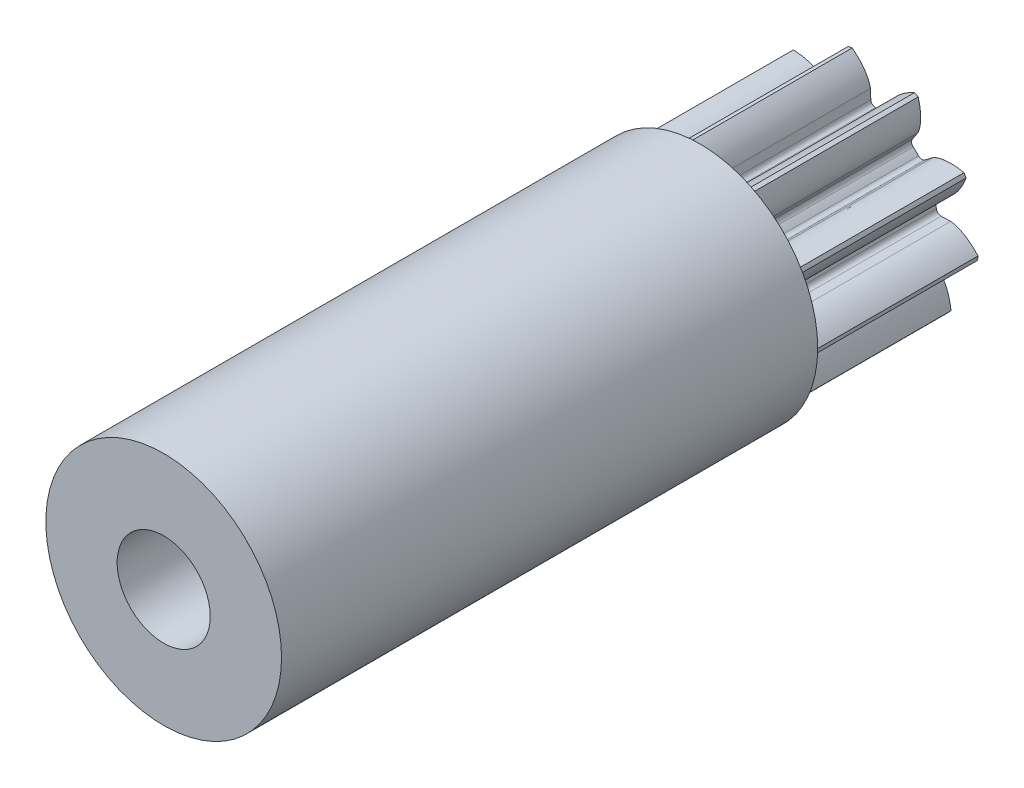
ISO-10303-21;
HEADER;
FILE_DESCRIPTION(('STEP AP214'),'2;1');
FILE_NAME('part.step','',(''),(''),'','','');
FILE_SCHEMA(('AUTOMOTIVE_DESIGN { 1 0 10303 214 1 1 1 1 }'));
ENDSEC;
DATA;
#1=APPLICATION_CONTEXT('core data for automotive mechanical design processes');
#2=APPLICATION_PROTOCOL_DEFINITION('international standard','automotive_design',2000,#1);
#3=PRODUCT_CONTEXT('',#1,'mechanical');
#4=PRODUCT('Part','Part','',(#3));
#5=PRODUCT_RELATED_PRODUCT_CATEGORY('part','',(#4));
#6=PRODUCT_DEFINITION_FORMATION('','',#4);
#7=PRODUCT_DEFINITION_CONTEXT('part definition',#1,'design');
#8=PRODUCT_DEFINITION('design','',#6,#7);
#9=PRODUCT_DEFINITION_SHAPE('','',#8);
#10=(LENGTH_UNIT() NAMED_UNIT(*) SI_UNIT(.MILLI.,.METRE.));
#11=(NAMED_UNIT(*) PLANE_ANGLE_UNIT() SI_UNIT($,.RADIAN.));
#12=(NAMED_UNIT(*) SI_UNIT($,.STERADIAN.) SOLID_ANGLE_UNIT());
#13=UNCERTAINTY_MEASURE_WITH_UNIT(LENGTH_MEASURE(1.E-05),#10,'distance_accuracy_value','');
#14=(GEOMETRIC_REPRESENTATION_CONTEXT(3) GLOBAL_UNCERTAINTY_ASSIGNED_CONTEXT((#13)) GLOBAL_UNIT_ASSIGNED_CONTEXT((#10,
#11,#12)) REPRESENTATION_CONTEXT('',''));
#15=CARTESIAN_POINT('',(0.,0.,0.));
#16=DIRECTION('',(0.,0.,1.));
#17=DIRECTION('',(1.,0.,0.));
#18=AXIS2_PLACEMENT_3D('',#15,#16,#17);
#19=CARTESIAN_POINT('',(1.00000000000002,0.,6.35));
#20=DIRECTION('',(0.,0.,-1.));
#21=DIRECTION('',(-1.,0.,0.));
#22=AXIS2_PLACEMENT_3D('',#19,#20,#21);
#23=PLANE('',#22);
#24=CARTESIAN_POINT('',(0.,0.,6.35));
#25=DIRECTION('',(0.,0.,1.));
#26=DIRECTION('',(1.,0.,0.));
#27=AXIS2_PLACEMENT_3D('',#24,#25,#26);
#28=CIRCLE('',#27,1.00000000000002);
#29=CARTESIAN_POINT('',(1.00000000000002,0.,6.35));
#30=VERTEX_POINT('',#29);
#31=EDGE_CURVE('E824',#30,#30,#28,.T.);
#32=ORIENTED_EDGE('',*,*,#31,.F.);
#33=EDGE_LOOP('',(#32));
#34=FACE_BOUND('',#33,.T.);
#35=CARTESIAN_POINT('',(0.,0.,6.35));
#36=DIRECTION('',(0.,0.,-1.));
#37=DIRECTION('',(1.,0.,0.));
#38=AXIS2_PLACEMENT_3D('',#35,#36,#37);
#39=CIRCLE('',#38,0.562499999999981);
#40=CARTESIAN_POINT('',(-0.0379130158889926,-0.561220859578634,6.35));
#41=VERTEX_POINT('',#40);
#42=CARTESIAN_POINT('',(-0.0992942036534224,-0.553666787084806,6.35));
#43=VERTEX_POINT('',#42);
#44=EDGE_CURVE('E1183',#41,#43,#39,.T.);
#45=ORIENTED_EDGE('',*,*,#44,.F.);
#46=CARTESIAN_POINT('',(-0.040609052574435,-0.601129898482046,6.35));
#47=DIRECTION('',(0.,0.,-1.));
#48=DIRECTION('',(-1.,0.,0.));
#49=AXIS2_PLACEMENT_3D('',#46,#47,#48);
#50=CIRCLE('',#49,0.0400000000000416);
#51=CARTESIAN_POINT('',(-0.000653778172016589,-0.599238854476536,6.35));
#52=VERTEX_POINT('',#51);
#53=EDGE_CURVE('E783',#41,#52,#50,.T.);
#54=ORIENTED_EDGE('',*,*,#53,.T.);
#55=DIRECTION('',(-0.0472761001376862,0.998881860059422,0.));
#56=VECTOR('',#55,1.);
#57=CARTESIAN_POINT('',(-0.00239283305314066,-0.562494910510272,6.35));
#58=LINE('',#57,#56);
#59=CARTESIAN_POINT('',(0.00315548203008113,-0.679723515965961,6.35));
#60=VERTEX_POINT('',#59);
#61=EDGE_CURVE('E950',#60,#52,#58,.T.);
#62=ORIENTED_EDGE('',*,*,#61,.F.);
#63=CARTESIAN_POINT('',(0.156958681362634,-0.901437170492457,6.35));
#64=CARTESIAN_POINT('',(0.124574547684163,-0.876031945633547,6.35));
#65=CARTESIAN_POINT('',(0.0943754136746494,-0.847240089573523,6.35));
#66=CARTESIAN_POINT('',(0.0687389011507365,-0.815038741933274,6.35));
#67=CARTESIAN_POINT('',(0.0458093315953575,-0.786237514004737,6.35));
#68=CARTESIAN_POINT('',(0.0255126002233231,-0.754352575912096,6.35));
#69=CARTESIAN_POINT('',(0.0128359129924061,-0.7197899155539,6.35));
#70=CARTESIAN_POINT('',(0.00810471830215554,-0.706890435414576,6.35));
#71=CARTESIAN_POINT('',(0.00380504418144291,-0.693447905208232,6.35));
#72=CARTESIAN_POINT('',(0.00315548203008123,-0.679723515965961,6.35));
#73=B_SPLINE_CURVE_WITH_KNOTS('',3,(#63,#64,#65,#66,#67,#68,#69,#70,#71,#72),.UNSPECIFIED.,.F.,
.F.,(4,3,3,4),(0.,0.000124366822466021,0.000235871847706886,0.000277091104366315),.UNSPECIFIED.);
#74=CARTESIAN_POINT('',(0.156958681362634,-0.901437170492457,6.35));
#75=VERTEX_POINT('',#74);
#76=EDGE_CURVE('E953',#75,#60,#73,.T.);
#77=ORIENTED_EDGE('',*,*,#76,.F.);
#78=CARTESIAN_POINT('',(0.,0.,6.35));
#79=DIRECTION('',(0.,0.,-1.));
#80=DIRECTION('',(1.,0.,0.));
#81=AXIS2_PLACEMENT_3D('',#78,#79,#80);
#82=CIRCLE('',#81,0.915000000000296);
#83=CARTESIAN_POINT('',(0.191654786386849,-0.894702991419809,6.35));
#84=VERTEX_POINT('',#83);
#85=EDGE_CURVE('E958',#84,#75,#82,.T.);
#86=ORIENTED_EDGE('',*,*,#85,.F.);
#87=CARTESIAN_POINT('',(0.251350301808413,-0.631551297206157,6.35));
#88=CARTESIAN_POINT('',(0.256552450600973,-0.646441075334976,6.35));
#89=CARTESIAN_POINT('',(0.257380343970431,-0.662697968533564,6.35));
#90=CARTESIAN_POINT('',(0.257477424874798,-0.678470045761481,6.35));
#91=CARTESIAN_POINT('',(0.257630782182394,-0.703384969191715,6.35));
#92=CARTESIAN_POINT('',(0.254160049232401,-0.728389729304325,6.35));
#93=CARTESIAN_POINT('',(0.248696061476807,-0.752698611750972,6.35));
#94=CARTESIAN_POINT('',(0.243088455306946,-0.77764644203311,6.35));
#95=CARTESIAN_POINT('',(0.235219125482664,-0.802161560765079,6.35));
#96=CARTESIAN_POINT('',(0.225560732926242,-0.825837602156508,6.35));
#97=CARTESIAN_POINT('',(0.215896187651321,-0.849528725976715,6.35));
#98=CARTESIAN_POINT('',(0.204416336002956,-0.872526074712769,6.35));
#99=CARTESIAN_POINT('',(0.191654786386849,-0.894702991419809,6.35));
#100=B_SPLINE_CURVE_WITH_KNOTS('',3,(#87,#88,#89,#90,#91,#92,#93,#94,#95,#96,#97,#98,#99),
.UNSPECIFIED.,.F.,.F.,(4,3,3,3,4),(0.,4.74356378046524E-05,0.000122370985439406,
0.000199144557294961,0.00027590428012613),.UNSPECIFIED.);
#101=CARTESIAN_POINT('',(0.251350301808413,-0.631551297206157,6.35));
#102=VERTEX_POINT('',#101);
#103=EDGE_CURVE('E963',#102,#84,#100,.T.);
#104=ORIENTED_EDGE('',*,*,#103,.F.);
#105=DIRECTION('',(0.32982657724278,-0.944041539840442,0.));
#106=VECTOR('',#105,1.);
#107=CARTESIAN_POINT('',(0.251350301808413,-0.631551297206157,6.35));
#108=LINE('',#107,#106);
#109=CARTESIAN_POINT('',(0.224774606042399,-0.555485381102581,6.35));
#110=VERTEX_POINT('',#109);
#111=EDGE_CURVE('E967',#110,#102,#108,.T.);
#112=ORIENTED_EDGE('',*,*,#111,.F.);
#113=CARTESIAN_POINT('',(0.262536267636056,-0.542292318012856,6.35));
#114=DIRECTION('',(0.,0.,-1.));
#115=DIRECTION('',(-1.,0.,0.));
#116=AXIS2_PLACEMENT_3D('',#113,#114,#115);
#117=CIRCLE('',#116,0.0400000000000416);
#118=CARTESIAN_POINT('',(0.24510647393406,-0.506289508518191,6.35));
#119=VERTEX_POINT('',#118);
#120=EDGE_CURVE('E791',#110,#119,#117,.T.);
#121=ORIENTED_EDGE('',*,*,#120,.T.);
#122=CARTESIAN_POINT('',(0.,0.,6.35));
#123=DIRECTION('',(0.,0.,-1.));
#124=DIRECTION('',(1.,0.,0.));
#125=AXIS2_PLACEMENT_3D('',#122,#123,#124);
#126=CIRCLE('',#125,0.562499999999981);
#127=CARTESIAN_POINT('',(0.299205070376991,-0.476321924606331,6.35));
#128=VERTEX_POINT('',#127);
#129=EDGE_CURVE('E972',#128,#119,#126,.T.);
#130=ORIENTED_EDGE('',*,*,#129,.F.);
#131=CARTESIAN_POINT('',(0.3204818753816,-0.510193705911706,6.35));
#132=DIRECTION('',(0.,0.,-1.));
#133=DIRECTION('',(-1.,0.,0.));
#134=AXIS2_PLACEMENT_3D('',#131,#132,#133);
#135=CIRCLE('',#134,0.0400000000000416);
#136=CARTESIAN_POINT('',(0.351694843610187,-0.485178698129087,6.35));
#137=VERTEX_POINT('',#136);
#138=EDGE_CURVE('E785',#128,#137,#135,.T.);
#139=ORIENTED_EDGE('',*,*,#138,.T.);
#140=DIRECTION('',(-0.625375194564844,0.780324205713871,0.));
#141=VECTOR('',#140,1.);
#142=CARTESIAN_POINT('',(0.328690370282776,-0.456474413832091,6.35));
#143=LINE('',#142,#141);
#144=CARTESIAN_POINT('',(0.402084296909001,-0.548053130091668,6.35));
#145=VERTEX_POINT('',#144);
#146=EDGE_CURVE('E975',#145,#137,#143,.T.);
#147=ORIENTED_EDGE('',*,*,#146,.F.);
#148=CARTESIAN_POINT('',(0.656833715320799,-0.63701999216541,6.35));
#149=CARTESIAN_POINT('',(0.615701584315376,-0.635501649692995,6.35));
#150=CARTESIAN_POINT('',(0.574346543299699,-0.629959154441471,6.35));
#151=CARTESIAN_POINT('',(0.534678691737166,-0.618976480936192,6.35));
#152=CARTESIAN_POINT('',(0.499199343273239,-0.609153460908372,6.35));
#153=CARTESIAN_POINT('',(0.464037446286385,-0.595288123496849,6.35));
#154=CARTESIAN_POINT('',(0.43346636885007,-0.574777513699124,6.35));
#155=CARTESIAN_POINT('',(0.422056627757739,-0.567122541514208,6.35));
#156=CARTESIAN_POINT('',(0.410676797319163,-0.558774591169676,6.35));
#157=CARTESIAN_POINT('',(0.402084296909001,-0.548053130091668,6.35));
#158=B_SPLINE_CURVE_WITH_KNOTS('',3,(#148,#149,#150,#151,#152,#153,#154,#155,#156,#157),
.UNSPECIFIED.,.F.,.F.,(4,3,3,4),(0.,0.000124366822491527,0.000235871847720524,
0.000277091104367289),.UNSPECIFIED.);
#159=CARTESIAN_POINT('',(0.656833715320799,-0.63701999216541,6.35));
#160=VERTEX_POINT('',#159);
#161=EDGE_CURVE('E978',#160,#145,#158,.T.);
#162=ORIENTED_EDGE('',*,*,#161,.F.);
#163=CARTESIAN_POINT('',(0.,0.,6.35));
#164=DIRECTION('',(0.,0.,-1.));
#165=DIRECTION('',(1.,0.,0.));
#166=AXIS2_PLACEMENT_3D('',#163,#164,#165);
#167=CIRCLE('',#166,0.915000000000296);
#168=CARTESIAN_POINT('',(0.680945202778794,-0.611178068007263,6.35));
#169=VERTEX_POINT('',#168);
#170=EDGE_CURVE('E982',#169,#160,#167,.T.);
#171=ORIENTED_EDGE('',*,*,#170,.F.);
#172=CARTESIAN_POINT('',(0.574563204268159,-0.363195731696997,6.35));
#173=CARTESIAN_POINT('',(0.587523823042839,-0.372184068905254,6.35));
#174=CARTESIAN_POINT('',(0.59774916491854,-0.384849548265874,6.35));
#175=CARTESIAN_POINT('',(0.607098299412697,-0.397552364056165,6.35));
#176=CARTESIAN_POINT('',(0.621866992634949,-0.417618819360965,6.35));
#177=CARTESIAN_POINT('',(0.633756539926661,-0.439888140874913,6.35));
#178=CARTESIAN_POINT('',(0.643624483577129,-0.462766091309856,6.35));
#179=CARTESIAN_POINT('',(0.653751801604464,-0.48624537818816,6.35));
#180=CARTESIAN_POINT('',(0.661795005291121,-0.510704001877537,6.35));
#181=CARTESIAN_POINT('',(0.667897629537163,-0.535535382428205,6.35));
#182=CARTESIAN_POINT('',(0.674004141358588,-0.560382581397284,6.35));
#183=CARTESIAN_POINT('',(0.67823424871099,-0.585735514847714,6.35));
#184=CARTESIAN_POINT('',(0.680945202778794,-0.611178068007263,6.35));
#185=B_SPLINE_CURVE_WITH_KNOTS('',3,(#172,#173,#174,#175,#176,#177,#178,#179,#180,#181,#182,
#183,#184),.UNSPECIFIED.,.F.,.F.,(4,3,3,3,4),(0.,4.74356378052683E-05,0.000122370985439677,
0.000199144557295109,0.000275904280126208),.UNSPECIFIED.);
#186=CARTESIAN_POINT('',(0.574563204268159,-0.363195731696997,6.35));
#187=VERTEX_POINT('',#186);
#188=EDGE_CURVE('E987',#187,#169,#185,.T.);
#189=ORIENTED_EDGE('',*,*,#188,.F.);
#190=DIRECTION('',(0.821729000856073,-0.569878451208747,0.));
#191=VECTOR('',#190,1.);
#192=CARTESIAN_POINT('',(0.574563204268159,-0.363195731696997,6.35));
#193=LINE('',#192,#191);
#194=CARTESIAN_POINT('',(0.508352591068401,-0.317277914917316,6.35));
#195=VERTEX_POINT('',#194);
#196=EDGE_CURVE('E991',#195,#187,#193,.T.);
#197=ORIENTED_EDGE('',*,*,#196,.F.);
#198=CARTESIAN_POINT('',(0.531147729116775,-0.284408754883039,6.35));
#199=DIRECTION('',(0.,0.,-1.));
#200=DIRECTION('',(-1.,0.,0.));
#201=AXIS2_PLACEMENT_3D('',#198,#199,#200);
#202=CIRCLE('',#201,0.0400000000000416);
#203=CARTESIAN_POINT('',(0.495884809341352,-0.265526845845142,6.35));
#204=VERTEX_POINT('',#203);
#205=EDGE_CURVE('E787',#195,#204,#202,.T.);
#206=ORIENTED_EDGE('',*,*,#205,.T.);
#207=CARTESIAN_POINT('',(0.,0.,6.35));
#208=DIRECTION('',(0.,0.,-1.));
#209=DIRECTION('',(1.,0.,0.));
#210=AXIS2_PLACEMENT_3D('',#207,#208,#209);
#211=CIRCLE('',#210,0.562499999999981);
#212=CARTESIAN_POINT('',(0.522036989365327,-0.209484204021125,6.35));
#213=VERTEX_POINT('',#212);
#214=EDGE_CURVE('E996',#213,#204,#211,.T.);
#215=ORIENTED_EDGE('',*,*,#214,.F.);
#216=CARTESIAN_POINT('',(0.559159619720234,-0.22438085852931,6.35));
#217=DIRECTION('',(0.,0.,-1.));
#218=DIRECTION('',(-1.,0.,0.));
#219=AXIS2_PLACEMENT_3D('',#216,#217,#218);
#220=CIRCLE('',#219,0.0400000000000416);
#221=CARTESIAN_POINT('',(0.569707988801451,-0.185796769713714,6.35));
#222=VERTEX_POINT('',#221);
#223=EDGE_CURVE('E817',#213,#222,#220,.T.);
#224=ORIENTED_EDGE('',*,*,#223,.T.);
#225=DIRECTION('',(-0.964602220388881,0.263709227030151,0.));
#226=VECTOR('',#225,1.);
#227=CARTESIAN_POINT('',(0.534225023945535,-0.17609620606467,6.35));
#228=LINE('',#227,#226);
#229=CARTESIAN_POINT('',(0.647430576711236,-0.207045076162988,6.35));
#230=VERTEX_POINT('',#229);
#231=EDGE_CURVE('E999',#230,#222,#228,.T.);
#232=ORIENTED_EDGE('',*,*,#231,.F.);
#233=CARTESIAN_POINT('',(0.905820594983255,-0.129282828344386,6.35));
#234=CARTESIAN_POINT('',(0.871651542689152,-0.152231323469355,6.35));
#235=CARTESIAN_POINT('',(0.834936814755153,-0.1720552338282,6.35));
#236=CARTESIAN_POINT('',(0.796389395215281,-0.186486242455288,6.35));
#237=CARTESIAN_POINT('',(0.761912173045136,-0.19939349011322,6.35));
#238=CARTESIAN_POINT('',(0.725315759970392,-0.208843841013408,6.35));
#239=CARTESIAN_POINT('',(0.688527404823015,-0.210219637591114,6.35));
#240=CARTESIAN_POINT('',(0.674797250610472,-0.210733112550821,6.35));
#241=CARTESIAN_POINT('',(0.660683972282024,-0.210668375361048,6.35));
#242=CARTESIAN_POINT('',(0.647430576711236,-0.207045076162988,6.35));
#243=B_SPLINE_CURVE_WITH_KNOTS('',3,(#233,#234,#235,#236,#237,#238,#239,#240,#241,#242),
.UNSPECIFIED.,.F.,.F.,(4,3,3,4),(0.,0.000124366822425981,0.0002358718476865,
0.00027709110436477),.UNSPECIFIED.);
#244=CARTESIAN_POINT('',(0.905820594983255,-0.129282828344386,6.35));
#245=VERTEX_POINT('',#244);
#246=EDGE_CURVE('E1001',#245,#230,#243,.T.);
#247=ORIENTED_EDGE('',*,*,#246,.F.);
#248=CARTESIAN_POINT('',(0.,0.,6.35));
#249=DIRECTION('',(0.,0.,-1.));
#250=DIRECTION('',(1.,0.,0.));
#251=AXIS2_PLACEMENT_3D('',#248,#249,#250);
#252=CIRCLE('',#251,0.915000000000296);
#253=CARTESIAN_POINT('',(0.910137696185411,-0.094203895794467,6.35));
#254=VERTEX_POINT('',#253);
#255=EDGE_CURVE('E1005',#254,#245,#252,.T.);
#256=ORIENTED_EDGE('',*,*,#255,.F.);
#257=CARTESIAN_POINT('',(0.678312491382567,0.0438882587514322,6.35));
#258=CARTESIAN_POINT('',(0.69408106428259,0.0442346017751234,6.35));
#259=CARTESIAN_POINT('',(0.709798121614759,0.0399983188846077,6.35));
#260=CARTESIAN_POINT('',(0.724828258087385,0.0352168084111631,6.35));
#261=CARTESIAN_POINT('',(0.748571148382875,0.027663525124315,6.35));
#262=CARTESIAN_POINT('',(0.771279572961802,0.0166357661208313,6.35));
#263=CARTESIAN_POINT('',(0.792710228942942,0.00392734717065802,6.35));
#264=CARTESIAN_POINT('',(0.814704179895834,-0.00911510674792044,6.35));
#265=CARTESIAN_POINT('',(0.835587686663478,-0.0241748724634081,6.35));
#266=CARTESIAN_POINT('',(0.85512033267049,-0.0406768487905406,6.35));
#267=CARTESIAN_POINT('',(0.874665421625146,-0.0571893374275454,6.35));
#268=CARTESIAN_POINT('',(0.892989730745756,-0.0752138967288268,6.35));
#269=CARTESIAN_POINT('',(0.910137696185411,-0.094203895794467,6.35));
#270=B_SPLINE_CURVE_WITH_KNOTS('',3,(#257,#258,#259,#260,#261,#262,#263,#264,#265,#266,#267,
#268,#269),.UNSPECIFIED.,.F.,.F.,(4,3,3,3,4),(0.,4.74356378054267E-05,0.000122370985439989,
0.000199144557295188,0.000275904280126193),.UNSPECIFIED.);
#271=CARTESIAN_POINT('',(0.678312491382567,0.0438882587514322,6.35));
#272=VERTEX_POINT('',#271);
#273=EDGE_CURVE('E1010',#272,#254,#270,.T.);
#274=ORIENTED_EDGE('',*,*,#273,.F.);
#275=DIRECTION('',(0.999758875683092,0.0219588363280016,0.));
#276=VECTOR('',#275,1.);
#277=CARTESIAN_POINT('',(0.678312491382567,0.0438882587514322,6.35));
#278=LINE('',#277,#276);
#279=CARTESIAN_POINT('',(0.597757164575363,0.0421189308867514,6.35));
#280=VERTEX_POINT('',#279);
#281=EDGE_CURVE('E1014',#280,#272,#278,.T.);
#282=ORIENTED_EDGE('',*,*,#281,.F.);
#283=CARTESIAN_POINT('',(0.596878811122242,0.0821092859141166,6.35));
#284=DIRECTION('',(0.,0.,-1.));
#285=DIRECTION('',(-1.,0.,0.));
#286=AXIS2_PLACEMENT_3D('',#283,#284,#285);
#287=CIRCLE('',#286,0.0400000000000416);
#288=CARTESIAN_POINT('',(0.557252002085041,0.0766580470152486,6.35));
#289=VERTEX_POINT('',#288);
#290=EDGE_CURVE('E811',#280,#289,#287,.T.);
#291=ORIENTED_EDGE('',*,*,#290,.T.);
#292=CARTESIAN_POINT('',(0.,0.,6.35));
#293=DIRECTION('',(0.,0.,-1.));
#294=DIRECTION('',(1.,0.,0.));
#295=AXIS2_PLACEMENT_3D('',#292,#293,#294);
#296=CIRCLE('',#295,0.562499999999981);
#297=CARTESIAN_POINT('',(0.545468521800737,0.137369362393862,6.35));
#298=VERTEX_POINT('',#297);
#299=EDGE_CURVE('E1019',#298,#289,#296,.T.);
#300=ORIENTED_EDGE('',*,*,#299,.F.);
#301=CARTESIAN_POINT('',(0.584257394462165,0.147137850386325,6.35));
#302=DIRECTION('',(0.,0.,-1.));
#303=DIRECTION('',(-1.,0.,0.));
#304=AXIS2_PLACEMENT_3D('',#301,#302,#303);
#305=CIRCLE('',#304,0.0400000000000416);
#306=CARTESIAN_POINT('',(0.57011204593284,0.184553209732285,6.35));
#307=VERTEX_POINT('',#306);
#308=EDGE_CURVE('E805',#298,#307,#305,.T.);
#309=ORIENTED_EDGE('',*,*,#308,.T.);
#310=DIRECTION('',(-0.935383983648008,-0.35363371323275,0.));
#311=VECTOR('',#310,1.);
#312=CARTESIAN_POINT('',(0.535703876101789,0.171544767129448,6.35));
#313=LINE('',#312,#311);
#314=CARTESIAN_POINT('',(0.645480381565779,0.213047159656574,6.35));
#315=VERTEX_POINT('',#314);
#316=EDGE_CURVE('E1022',#315,#307,#313,.T.);
#317=ORIENTED_EDGE('',*,*,#316,.F.);
#318=CARTESIAN_POINT('',(0.808814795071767,0.427835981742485,6.35));
#319=CARTESIAN_POINT('',(0.794660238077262,0.389186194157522,6.35));
#320=CARTESIAN_POINT('',(0.776609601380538,0.351567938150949,6.35));
#321=CARTESIAN_POINT('',(0.753906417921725,0.317235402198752,6.35));
#322=CARTESIAN_POINT('',(0.733600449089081,0.28652801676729,6.35));
#323=CARTESIAN_POINT('',(0.709548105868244,0.257371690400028,6.35));
#324=CARTESIAN_POINT('',(0.680594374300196,0.234634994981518,6.35));
#325=CARTESIAN_POINT('',(0.669788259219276,0.226149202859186,6.35));
#326=CARTESIAN_POINT('',(0.658332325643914,0.217905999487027,6.35));
#327=CARTESIAN_POINT('',(0.645480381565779,0.213047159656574,6.35));
#328=B_SPLINE_CURVE_WITH_KNOTS('',3,(#318,#319,#320,#321,#322,#323,#324,#325,#326,#327),
.UNSPECIFIED.,.F.,.F.,(4,3,3,4),(0.,0.000124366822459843,0.000235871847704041,
0.000277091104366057),.UNSPECIFIED.);
#329=CARTESIAN_POINT('',(0.808814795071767,0.427835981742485,6.35));
#330=VERTEX_POINT('',#329);
#331=EDGE_CURVE('E1025',#330,#315,#328,.T.);
#332=ORIENTED_EDGE('',*,*,#331,.F.);
#333=CARTESIAN_POINT('',(0.,0.,6.35));
#334=DIRECTION('',(0.,0.,-1.));
#335=DIRECTION('',(1.,0.,0.));
#336=AXIS2_PLACEMENT_3D('',#333,#334,#335);
#337=CIRCLE('',#336,0.915000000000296);
#338=CARTESIAN_POINT('',(0.791688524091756,0.458752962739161,6.35));
#339=VERTEX_POINT('',#338);
#340=EDGE_CURVE('E1029',#339,#330,#337,.T.);
#341=ORIENTED_EDGE('',*,*,#340,.F.);
#342=CARTESIAN_POINT('',(0.522969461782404,0.43420842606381,6.35));
#343=CARTESIAN_POINT('',(0.535522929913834,0.443757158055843,6.35));
#344=CARTESIAN_POINT('',(0.5507283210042,0.449568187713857,6.35));
#345=CARTESIAN_POINT('',(0.565698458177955,0.454534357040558,6.35));
#346=CARTESIAN_POINT('',(0.589346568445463,0.462379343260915,6.35));
#347=CARTESIAN_POINT('',(0.614200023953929,0.466805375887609,6.35));
#348=CARTESIAN_POINT('',(0.639007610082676,0.469120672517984,6.35));
#349=CARTESIAN_POINT('',(0.664467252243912,0.471496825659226,6.35));
#350=CARTESIAN_POINT('',(0.690214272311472,0.471588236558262,6.35));
#351=CARTESIAN_POINT('',(0.715716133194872,0.469718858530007,6.35));
#352=CARTESIAN_POINT('',(0.741234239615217,0.467848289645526,6.35));
#353=CARTESIAN_POINT('',(0.766653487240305,0.464036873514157,6.35));
#354=CARTESIAN_POINT('',(0.791688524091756,0.458752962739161,6.35));
#355=B_SPLINE_CURVE_WITH_KNOTS('',3,(#342,#343,#344,#345,#346,#347,#348,#349,#350,#351,#352,
#353,#354),.UNSPECIFIED.,.F.,.F.,(4,3,3,3,4),(0.,4.74356378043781E-05,0.000122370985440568,
0.000199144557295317,0.00027590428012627),.UNSPECIFIED.);
#356=CARTESIAN_POINT('',(0.522969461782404,0.43420842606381,6.35));
#357=VERTEX_POINT('',#356);
#358=EDGE_CURVE('E1034',#357,#339,#355,.T.);
#359=ORIENTED_EDGE('',*,*,#358,.F.);
#360=DIRECTION('',(0.795914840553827,0.60540859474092,0.));
#361=VECTOR('',#360,1.);
#362=CARTESIAN_POINT('',(0.522969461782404,0.43420842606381,6.35));
#363=LINE('',#362,#361);
#364=CARTESIAN_POINT('',(0.458838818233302,0.385427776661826,6.35));
#365=VERTEX_POINT('',#364);
#366=EDGE_CURVE('E1038',#365,#357,#363,.T.);
#367=ORIENTED_EDGE('',*,*,#366,.F.);
#368=CARTESIAN_POINT('',(0.43462247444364,0.417264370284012,6.35));
#369=DIRECTION('',(0.,0.,-1.));
#370=DIRECTION('',(-1.,0.,0.));
#371=AXIS2_PLACEMENT_3D('',#368,#369,#370);
#372=CIRCLE('',#371,0.0400000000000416);
#373=CARTESIAN_POINT('',(0.405767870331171,0.389562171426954,6.35));
#374=VERTEX_POINT('',#373);
#375=EDGE_CURVE('E793',#365,#374,#372,.T.);
#376=ORIENTED_EDGE('',*,*,#375,.T.);
#377=CARTESIAN_POINT('',(0.,0.,6.35));
#378=DIRECTION('',(0.,0.,-1.));
#379=DIRECTION('',(1.,0.,0.));
#380=AXIS2_PLACEMENT_3D('',#377,#378,#379);
#381=CIRCLE('',#380,0.562499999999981);
#382=CARTESIAN_POINT('',(0.360549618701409,0.431752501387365,6.35));
#383=VERTEX_POINT('',#382);
#384=EDGE_CURVE('E1043',#383,#374,#381,.T.);
#385=ORIENTED_EDGE('',*,*,#384,.F.);
#386=CARTESIAN_POINT('',(0.386188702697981,0.462454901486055,6.35));
#387=DIRECTION('',(0.,0.,-1.));
#388=DIRECTION('',(-1.,0.,0.));
#389=AXIS2_PLACEMENT_3D('',#386,#387,#388);
#390=CIRCLE('',#389,0.0400000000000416);
#391=CARTESIAN_POINT('',(0.352752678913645,0.484410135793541,6.35));
#392=VERTEX_POINT('',#391);
#393=EDGE_CURVE('E789',#383,#392,#390,.T.);
#394=ORIENTED_EDGE('',*,*,#393,.T.);
#395=DIRECTION('',(-0.548880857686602,-0.835900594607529,0.));
#396=VECTOR('',#395,1.);
#397=CARTESIAN_POINT('',(0.33256205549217,0.453661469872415,6.35));
#398=LINE('',#397,#396);
#399=CARTESIAN_POINT('',(0.396978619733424,0.551762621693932,6.35));
#400=VERTEX_POINT('',#399);
#401=EDGE_CURVE('E1046',#400,#392,#398,.T.);
#402=ORIENTED_EDGE('',*,*,#401,.F.);
#403=CARTESIAN_POINT('',(0.402869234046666,0.821535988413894,6.35));
#404=CARTESIAN_POINT('',(0.41413573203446,0.781947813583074,6.35));
#405=CARTESIAN_POINT('',(0.421643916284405,0.740904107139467,6.35));
#406=CARTESIAN_POINT('',(0.423456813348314,0.699783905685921,6.35));
#407=CARTESIAN_POINT('',(0.425078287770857,0.663005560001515,6.35));
#408=CARTESIAN_POINT('',(0.422757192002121,0.625279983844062,6.35));
#409=CARTESIAN_POINT('',(0.41269742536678,0.589867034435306,6.35));
#410=CARTESIAN_POINT('',(0.408942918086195,0.576650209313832,6.35));
#411=CARTESIAN_POINT('',(0.4045201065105,0.563247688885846,6.35));
#412=CARTESIAN_POINT('',(0.396978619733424,0.551762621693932,6.35));
#413=B_SPLINE_CURVE_WITH_KNOTS('',3,(#403,#404,#405,#406,#407,#408,#409,#410,#411,#412),
.UNSPECIFIED.,.F.,.F.,(4,3,3,4),(0.,0.000124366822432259,0.000235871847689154,
0.000277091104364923),.UNSPECIFIED.);
#414=CARTESIAN_POINT('',(0.402869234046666,0.821535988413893,6.35));
#415=VERTEX_POINT('',#414);
#416=EDGE_CURVE('E1049',#415,#400,#413,.T.);
#417=ORIENTED_EDGE('',*,*,#416,.F.);
#418=CARTESIAN_POINT('',(0.,0.,6.35));
#419=DIRECTION('',(0.,0.,-1.));
#420=DIRECTION('',(1.,0.,0.));
#421=AXIS2_PLACEMENT_3D('',#418,#419,#420);
#422=CIRCLE('',#421,0.915000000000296);
#423=CARTESIAN_POINT('',(0.37084124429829,0.836481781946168,6.35));
#424=VERTEX_POINT('',#423);
#425=EDGE_CURVE('E1053',#424,#415,#422,.T.);
#426=ORIENTED_EDGE('',*,*,#425,.F.);
#427=CARTESIAN_POINT('',(0.167869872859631,0.658675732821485,6.35));
#428=CARTESIAN_POINT('',(0.172413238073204,0.673779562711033,6.35));
#429=CARTESIAN_POINT('',(0.181299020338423,0.687418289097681,6.35));
#430=CARTESIAN_POINT('',(0.190491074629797,0.700235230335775,6.35));
#431=CARTESIAN_POINT('',(0.20501163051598,0.720481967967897,6.35));
#432=CARTESIAN_POINT('',(0.222516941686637,0.73867119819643,6.35));
#433=CARTESIAN_POINT('',(0.241225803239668,0.755125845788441,6.35));
#434=CARTESIAN_POINT('',(0.260426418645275,0.772012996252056,6.35));
#435=CARTESIAN_POINT('',(0.281202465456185,0.787220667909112,6.35));
#436=CARTESIAN_POINT('',(0.302932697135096,0.800697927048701,6.35));
#437=CARTESIAN_POINT('',(0.324676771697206,0.814183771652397,6.35));
#438=CARTESIAN_POINT('',(0.347481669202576,0.82604133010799,6.35));
#439=CARTESIAN_POINT('',(0.37084124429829,0.836481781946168,6.35));
#440=B_SPLINE_CURVE_WITH_KNOTS('',3,(#427,#428,#429,#430,#431,#432,#433,#434,#435,#436,#437,
#438,#439),.UNSPECIFIED.,.F.,.F.,(4,3,3,3,4),(0.,4.74356378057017E-05,0.000122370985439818,
0.000199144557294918,0.000275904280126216),.UNSPECIFIED.);
#441=CARTESIAN_POINT('',(0.167869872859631,0.658675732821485,6.35));
#442=VERTEX_POINT('',#441);
#443=EDGE_CURVE('E1058',#442,#424,#440,.T.);
#444=ORIENTED_EDGE('',*,*,#443,.F.);
#445=DIRECTION('',(0.2880583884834,0.95761284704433,0.));
#446=VECTOR('',#445,1.);
#447=CARTESIAN_POINT('',(0.167869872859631,0.658675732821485,6.35));
#448=LINE('',#447,#446);
#449=CARTESIAN_POINT('',(0.144659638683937,0.581516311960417,6.35));
#450=VERTEX_POINT('',#449);
#451=EDGE_CURVE('E1062',#450,#442,#448,.T.);
#452=ORIENTED_EDGE('',*,*,#451,.F.);
#453=CARTESIAN_POINT('',(0.106355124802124,0.593038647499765,6.35));
#454=DIRECTION('',(0.,0.,-1.));
#455=DIRECTION('',(-1.,0.,0.));
#456=AXIS2_PLACEMENT_3D('',#453,#454,#455);
#457=CIRCLE('',#456,0.0400000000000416);
#458=CARTESIAN_POINT('',(0.0992942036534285,0.553666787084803,6.35));
#459=VERTEX_POINT('',#458);
#460=EDGE_CURVE('E795',#450,#459,#457,.T.);
#461=ORIENTED_EDGE('',*,*,#460,.T.);
#462=CARTESIAN_POINT('',(0.,0.,6.35));
#463=DIRECTION('',(0.,0.,-1.));
#464=DIRECTION('',(1.,0.,0.));
#465=AXIS2_PLACEMENT_3D('',#462,#463,#464);
#466=CIRCLE('',#465,0.562499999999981);
#467=CARTESIAN_POINT('',(0.037913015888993,0.561220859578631,6.35));
#468=VERTEX_POINT('',#467);
#469=EDGE_CURVE('E1067',#468,#459,#466,.T.);
#470=ORIENTED_EDGE('',*,*,#469,.F.);
#471=CARTESIAN_POINT('',(0.0406090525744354,0.601129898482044,6.35));
#472=DIRECTION('',(0.,0.,-1.));
#473=DIRECTION('',(-1.,0.,0.));
#474=AXIS2_PLACEMENT_3D('',#471,#472,#473);
#475=CIRCLE('',#474,0.0400000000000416);
#476=CARTESIAN_POINT('',(0.000653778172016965,0.599238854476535,6.35));
#477=VERTEX_POINT('',#476);
#478=EDGE_CURVE('E807',#468,#477,#475,.T.);
#479=ORIENTED_EDGE('',*,*,#478,.T.);
#480=DIRECTION('',(0.0472761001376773,-0.998881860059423,0.));
#481=VECTOR('',#480,1.);
#482=CARTESIAN_POINT('',(0.00239283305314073,0.56249491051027,6.35));
#483=LINE('',#482,#481);
#484=CARTESIAN_POINT('',(-0.00315548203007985,0.679723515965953,6.35));
#485=VERTEX_POINT('',#484);
#486=EDGE_CURVE('E1070',#485,#477,#483,.T.);
#487=ORIENTED_EDGE('',*,*,#486,.F.);
#488=CARTESIAN_POINT('',(-0.156958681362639,0.901437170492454,6.35));
#489=CARTESIAN_POINT('',(-0.124574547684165,0.876031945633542,6.35));
#490=CARTESIAN_POINT('',(-0.0943754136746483,0.847240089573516,6.35));
#491=CARTESIAN_POINT('',(-0.0687389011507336,0.815038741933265,6.35));
#492=CARTESIAN_POINT('',(-0.0458093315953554,0.786237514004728,6.35));
#493=CARTESIAN_POINT('',(-0.0255126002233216,0.754352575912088,6.35));
#494=CARTESIAN_POINT('',(-0.012835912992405,0.719789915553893,6.35));
#495=CARTESIAN_POINT('',(-0.00810471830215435,0.706890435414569,6.35));
#496=CARTESIAN_POINT('',(-0.00380504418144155,0.693447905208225,6.35));
#497=CARTESIAN_POINT('',(-0.00315548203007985,0.679723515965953,6.35));
#498=B_SPLINE_CURVE_WITH_KNOTS('',3,(#488,#489,#490,#491,#492,#493,#494,#495,#496,#497),
.UNSPECIFIED.,.F.,.F.,(4,3,3,4),(0.,0.000124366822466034,0.000235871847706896,
0.000277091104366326),.UNSPECIFIED.);
#499=CARTESIAN_POINT('',(-0.156958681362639,0.901437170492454,6.35));
#500=VERTEX_POINT('',#499);
#501=EDGE_CURVE('E1073',#500,#485,#498,.T.);
#502=ORIENTED_EDGE('',*,*,#501,.F.);
#503=CARTESIAN_POINT('',(0.,0.,6.35));
#504=DIRECTION('',(0.,0.,-1.));
#505=DIRECTION('',(1.,0.,0.));
#506=AXIS2_PLACEMENT_3D('',#503,#504,#505);
#507=CIRCLE('',#506,0.915000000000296);
#508=CARTESIAN_POINT('',(-0.191654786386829,0.894702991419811,6.35));
#509=VERTEX_POINT('',#508);
#510=EDGE_CURVE('E1077',#509,#500,#507,.T.);
#511=ORIENTED_EDGE('',*,*,#510,.F.);
#512=CARTESIAN_POINT('',(-0.2513503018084,0.631551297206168,6.35));
#513=CARTESIAN_POINT('',(-0.256552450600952,0.646441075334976,6.35));
#514=CARTESIAN_POINT('',(-0.257380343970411,0.662697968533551,6.35));
#515=CARTESIAN_POINT('',(-0.25747742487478,0.678470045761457,6.35));
#516=CARTESIAN_POINT('',(-0.257630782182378,0.703384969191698,6.35));
#517=CARTESIAN_POINT('',(-0.254160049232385,0.728389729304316,6.35));
#518=CARTESIAN_POINT('',(-0.248696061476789,0.752698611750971,6.35));
#519=CARTESIAN_POINT('',(-0.243088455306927,0.777646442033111,6.35));
#520=CARTESIAN_POINT('',(-0.235219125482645,0.80216156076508,6.35));
#521=CARTESIAN_POINT('',(-0.225560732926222,0.825837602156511,6.35));
#522=CARTESIAN_POINT('',(-0.215896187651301,0.849528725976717,6.35));
#523=CARTESIAN_POINT('',(-0.204416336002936,0.872526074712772,6.35));
#524=CARTESIAN_POINT('',(-0.191654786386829,0.894702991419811,6.35));
#525=B_SPLINE_CURVE_WITH_KNOTS('',3,(#512,#513,#514,#515,#516,#517,#518,#519,#520,#521,#522,
#523,#524),.UNSPECIFIED.,.F.,.F.,(4,3,3,3,4),(0.,4.74356378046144E-05,0.000122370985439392,
0.000199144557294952,0.000275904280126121),.UNSPECIFIED.);
#526=CARTESIAN_POINT('',(-0.2513503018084,0.631551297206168,6.35));
#527=VERTEX_POINT('',#526);
#528=EDGE_CURVE('E1082',#527,#509,#525,.T.);
#529=ORIENTED_EDGE('',*,*,#528,.F.);
#530=DIRECTION('',(-0.329826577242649,0.944041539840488,0.));
#531=VECTOR('',#530,1.);
#532=CARTESIAN_POINT('',(-0.2513503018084,0.631551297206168,6.35));
#533=LINE('',#532,#531);
#534=CARTESIAN_POINT('',(-0.224774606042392,0.555485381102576,6.35));
#535=VERTEX_POINT('',#534);
#536=EDGE_CURVE('E1086',#535,#527,#533,.T.);
#537=ORIENTED_EDGE('',*,*,#536,.F.);
#538=CARTESIAN_POINT('',(-0.262536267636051,0.542292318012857,6.35));
#539=DIRECTION('',(0.,0.,-1.));
#540=DIRECTION('',(-1.,0.,0.));
#541=AXIS2_PLACEMENT_3D('',#538,#539,#540);
#542=CIRCLE('',#541,0.0400000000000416);
#543=CARTESIAN_POINT('',(-0.245106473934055,0.506289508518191,6.35));
#544=VERTEX_POINT('',#543);
#545=EDGE_CURVE('E797',#535,#544,#542,.T.);
#546=ORIENTED_EDGE('',*,*,#545,.T.);
#547=CARTESIAN_POINT('',(0.,0.,6.35));
#548=DIRECTION('',(0.,0.,-1.));
#549=DIRECTION('',(1.,0.,0.));
#550=AXIS2_PLACEMENT_3D('',#547,#548,#549);
#551=CIRCLE('',#550,0.562499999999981);
#552=CARTESIAN_POINT('',(-0.29920507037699,0.476321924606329,6.35));
#553=VERTEX_POINT('',#552);
#554=EDGE_CURVE('E1091',#553,#544,#551,.T.);
#555=ORIENTED_EDGE('',*,*,#554,.F.);
#556=CARTESIAN_POINT('',(-0.320481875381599,0.510193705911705,6.35));
#557=DIRECTION('',(0.,0.,-1.));
#558=DIRECTION('',(-1.,0.,0.));
#559=AXIS2_PLACEMENT_3D('',#556,#557,#558);
#560=CIRCLE('',#559,0.0400000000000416);
#561=CARTESIAN_POINT('',(-0.351694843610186,0.485178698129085,6.35));
#562=VERTEX_POINT('',#561);
#563=EDGE_CURVE('E801',#553,#562,#560,.T.);
#564=ORIENTED_EDGE('',*,*,#563,.T.);
#565=DIRECTION('',(0.62537519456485,-0.780324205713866,0.));
#566=VECTOR('',#565,1.);
#567=CARTESIAN_POINT('',(-0.328690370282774,0.45647441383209,6.35));
#568=LINE('',#567,#566);
#569=CARTESIAN_POINT('',(-0.402084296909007,0.548053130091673,6.35));
#570=VERTEX_POINT('',#569);
#571=EDGE_CURVE('E1094',#570,#562,#568,.T.);
#572=ORIENTED_EDGE('',*,*,#571,.F.);
#573=CARTESIAN_POINT('',(-0.656833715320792,0.637019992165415,6.35));
#574=CARTESIAN_POINT('',(-0.615701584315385,0.635501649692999,6.35));
#575=CARTESIAN_POINT('',(-0.574346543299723,0.629959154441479,6.35));
#576=CARTESIAN_POINT('',(-0.534678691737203,0.618976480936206,6.35));
#577=CARTESIAN_POINT('',(-0.499199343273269,0.609153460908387,6.35));
#578=CARTESIAN_POINT('',(-0.464037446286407,0.595288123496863,6.35));
#579=CARTESIAN_POINT('',(-0.433466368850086,0.574777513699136,6.35));
#580=CARTESIAN_POINT('',(-0.42205662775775,0.567122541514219,6.35));
#581=CARTESIAN_POINT('',(-0.410676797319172,0.558774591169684,6.35));
#582=CARTESIAN_POINT('',(-0.402084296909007,0.548053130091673,6.35));
#583=B_SPLINE_CURVE_WITH_KNOTS('',3,(#573,#574,#575,#576,#577,#578,#579,#580,#581,#582),
.UNSPECIFIED.,.F.,.F.,(4,3,3,4),(0.,0.000124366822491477,0.000235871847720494,
0.000277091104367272),.UNSPECIFIED.);
#584=CARTESIAN_POINT('',(-0.656833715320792,0.637019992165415,6.35));
#585=VERTEX_POINT('',#584);
#586=EDGE_CURVE('E1097',#585,#570,#583,.T.);
#587=ORIENTED_EDGE('',*,*,#586,.F.);
#588=CARTESIAN_POINT('',(0.,0.,6.35));
#589=DIRECTION('',(0.,0.,-1.));
#590=DIRECTION('',(1.,0.,0.));
#591=AXIS2_PLACEMENT_3D('',#588,#589,#590);
#592=CIRCLE('',#591,0.915000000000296);
#593=CARTESIAN_POINT('',(-0.680945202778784,0.611178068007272,6.35));
#594=VERTEX_POINT('',#593);
#595=EDGE_CURVE('E1101',#594,#585,#592,.T.);
#596=ORIENTED_EDGE('',*,*,#595,.F.);
#597=CARTESIAN_POINT('',(-0.574563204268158,0.363195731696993,6.35));
#598=CARTESIAN_POINT('',(-0.587523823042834,0.372184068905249,6.35));
#599=CARTESIAN_POINT('',(-0.597749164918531,0.384849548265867,6.35));
#600=CARTESIAN_POINT('',(-0.607098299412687,0.397552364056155,6.35));
#601=CARTESIAN_POINT('',(-0.621866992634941,0.417618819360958,6.35));
#602=CARTESIAN_POINT('',(-0.633756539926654,0.43988814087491,6.35));
#603=CARTESIAN_POINT('',(-0.643624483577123,0.462766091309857,6.35));
#604=CARTESIAN_POINT('',(-0.653751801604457,0.486245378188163,6.35));
#605=CARTESIAN_POINT('',(-0.661795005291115,0.510704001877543,6.35));
#606=CARTESIAN_POINT('',(-0.667897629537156,0.535535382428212,6.35));
#607=CARTESIAN_POINT('',(-0.67400414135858,0.560382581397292,6.35));
#608=CARTESIAN_POINT('',(-0.678234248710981,0.585735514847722,6.35));
#609=CARTESIAN_POINT('',(-0.680945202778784,0.611178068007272,6.35));
#610=B_SPLINE_CURVE_WITH_KNOTS('',3,(#597,#598,#599,#600,#601,#602,#603,#604,#605,#606,#607,
#608,#609),.UNSPECIFIED.,.F.,.F.,(4,3,3,3,4),(0.,4.74356378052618E-05,0.000122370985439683,
0.000199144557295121,0.000275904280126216),.UNSPECIFIED.);
#611=CARTESIAN_POINT('',(-0.574563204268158,0.363195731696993,6.35));
#612=VERTEX_POINT('',#611);
#613=EDGE_CURVE('E1106',#612,#594,#610,.T.);
#614=ORIENTED_EDGE('',*,*,#613,.F.);
#615=DIRECTION('',(-0.821729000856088,0.569878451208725,0.));
#616=VECTOR('',#615,1.);
#617=CARTESIAN_POINT('',(-0.574563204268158,0.363195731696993,6.35));
#618=LINE('',#617,#616);
#619=CARTESIAN_POINT('',(-0.508352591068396,0.317277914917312,6.35));
#620=VERTEX_POINT('',#619);
#621=EDGE_CURVE('E1110',#620,#612,#618,.T.);
#622=ORIENTED_EDGE('',*,*,#621,.F.);
#623=CARTESIAN_POINT('',(-0.531147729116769,0.284408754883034,6.35));
#624=DIRECTION('',(0.,0.,-1.));
#625=DIRECTION('',(-1.,0.,0.));
#626=AXIS2_PLACEMENT_3D('',#623,#624,#625);
#627=CIRCLE('',#626,0.0400000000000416);
#628=CARTESIAN_POINT('',(-0.495884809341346,0.265526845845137,6.35));
#629=VERTEX_POINT('',#628);
#630=EDGE_CURVE('E815',#620,#629,#627,.T.);
#631=ORIENTED_EDGE('',*,*,#630,.T.);
#632=CARTESIAN_POINT('',(0.,0.,6.35));
#633=DIRECTION('',(0.,0.,-1.));
#634=DIRECTION('',(1.,0.,0.));
#635=AXIS2_PLACEMENT_3D('',#632,#633,#634);
#636=CIRCLE('',#635,0.562499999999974);
#637=CARTESIAN_POINT('',(-0.534225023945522,0.176096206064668,6.35));
#638=VERTEX_POINT('',#637);
#639=EDGE_CURVE('E1115',#638,#629,#636,.T.);
#640=ORIENTED_EDGE('',*,*,#639,.F.);
#641=DIRECTION('',(0.964602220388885,-0.26370922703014,0.));
#642=VECTOR('',#641,1.);
#643=CARTESIAN_POINT('',(-0.534225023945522,0.176096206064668,6.35));
#644=LINE('',#643,#642);
#645=CARTESIAN_POINT('',(-0.647430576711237,0.207045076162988,6.35));
#646=VERTEX_POINT('',#645);
#647=EDGE_CURVE('E1117',#646,#638,#644,.T.);
#648=ORIENTED_EDGE('',*,*,#647,.F.);
#649=CARTESIAN_POINT('',(-0.905820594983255,0.129282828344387,6.35));
#650=CARTESIAN_POINT('',(-0.871651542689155,0.152231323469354,6.35));
#651=CARTESIAN_POINT('',(-0.83493681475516,0.172055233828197,6.35));
#652=CARTESIAN_POINT('',(-0.796389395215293,0.186486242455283,6.35));
#653=CARTESIAN_POINT('',(-0.761912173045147,0.199393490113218,6.35));
#654=CARTESIAN_POINT('',(-0.725315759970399,0.208843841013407,6.35));
#655=CARTESIAN_POINT('',(-0.68852740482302,0.210219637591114,6.35));
#656=CARTESIAN_POINT('',(-0.674797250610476,0.210733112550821,6.35));
#657=CARTESIAN_POINT('',(-0.660683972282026,0.210668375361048,6.35));
#658=CARTESIAN_POINT('',(-0.647430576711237,0.207045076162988,6.35));
#659=B_SPLINE_CURVE_WITH_KNOTS('',3,(#649,#650,#651,#652,#653,#654,#655,#656,#657,#658),
.UNSPECIFIED.,.F.,.F.,(4,3,3,4),(0.,0.000124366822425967,0.000235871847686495,
0.000277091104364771),.UNSPECIFIED.);
#660=CARTESIAN_POINT('',(-0.905820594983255,0.129282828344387,6.35));
#661=VERTEX_POINT('',#660);
#662=EDGE_CURVE('E1119',#661,#646,#659,.T.);
#663=ORIENTED_EDGE('',*,*,#662,.F.);
#664=CARTESIAN_POINT('',(0.,0.,6.35));
#665=DIRECTION('',(0.,0.,-1.));
#666=DIRECTION('',(1.,0.,0.));
#667=AXIS2_PLACEMENT_3D('',#664,#665,#666);
#668=CIRCLE('',#667,0.915000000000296);
#669=CARTESIAN_POINT('',(-0.910137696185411,0.0942038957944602,6.35));
#670=VERTEX_POINT('',#669);
#671=EDGE_CURVE('E1123',#670,#661,#668,.T.);
#672=ORIENTED_EDGE('',*,*,#671,.F.);
#673=CARTESIAN_POINT('',(-0.67831249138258,-0.04388825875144,6.35));
#674=CARTESIAN_POINT('',(-0.694081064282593,-0.0442346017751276,6.35));
#675=CARTESIAN_POINT('',(-0.709798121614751,-0.0399983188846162,6.35));
#676=CARTESIAN_POINT('',(-0.724828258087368,-0.0352168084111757,6.35));
#677=CARTESIAN_POINT('',(-0.748571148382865,-0.0276635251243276,6.35));
#678=CARTESIAN_POINT('',(-0.771279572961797,-0.0166357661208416,6.35));
#679=CARTESIAN_POINT('',(-0.792710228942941,-0.00392734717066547,6.35));
#680=CARTESIAN_POINT('',(-0.814704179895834,0.00911510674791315,6.35));
#681=CARTESIAN_POINT('',(-0.835587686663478,0.024174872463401,6.35));
#682=CARTESIAN_POINT('',(-0.855120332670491,0.0406768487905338,6.35));
#683=CARTESIAN_POINT('',(-0.874665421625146,0.0571893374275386,6.35));
#684=CARTESIAN_POINT('',(-0.892989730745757,0.07521389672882,6.35));
#685=CARTESIAN_POINT('',(-0.910137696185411,0.0942038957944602,6.35));
#686=B_SPLINE_CURVE_WITH_KNOTS('',3,(#673,#674,#675,#676,#677,#678,#679,#680,#681,#682,#683,
#684,#685),.UNSPECIFIED.,.F.,.F.,(4,3,3,3,4),(0.,4.74356378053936E-05,0.000122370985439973,
0.000199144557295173,0.00027590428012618),.UNSPECIFIED.);
#687=CARTESIAN_POINT('',(-0.67831249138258,-0.04388825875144,6.35));
#688=VERTEX_POINT('',#687);
#689=EDGE_CURVE('E1128',#688,#670,#686,.T.);
#690=ORIENTED_EDGE('',*,*,#689,.F.);
#691=DIRECTION('',(-0.99975887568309,-0.0219588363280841,0.));
#692=VECTOR('',#691,1.);
#693=CARTESIAN_POINT('',(-0.67831249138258,-0.04388825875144,6.35));
#694=LINE('',#693,#692);
#695=CARTESIAN_POINT('',(-0.560980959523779,-0.0413111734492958,6.35));
#696=VERTEX_POINT('',#695);
#697=EDGE_CURVE('E1132',#696,#688,#694,.T.);
#698=ORIENTED_EDGE('',*,*,#697,.F.);
#699=CARTESIAN_POINT('',(0.,0.,6.35));
#700=DIRECTION('',(0.,0.,-1.));
#701=DIRECTION('',(1.,0.,0.));
#702=AXIS2_PLACEMENT_3D('',#699,#700,#701);
#703=CIRCLE('',#702,0.562499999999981);
#704=CARTESIAN_POINT('',(-0.545468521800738,-0.137369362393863,6.35));
#705=VERTEX_POINT('',#704);
#706=EDGE_CURVE('E1137',#705,#696,#703,.T.);
#707=ORIENTED_EDGE('',*,*,#706,.F.);
#708=CARTESIAN_POINT('',(-0.584257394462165,-0.147137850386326,6.35));
#709=DIRECTION('',(0.,0.,-1.));
#710=DIRECTION('',(-1.,0.,0.));
#711=AXIS2_PLACEMENT_3D('',#708,#709,#710);
#712=CIRCLE('',#711,0.0400000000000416);
#713=CARTESIAN_POINT('',(-0.570112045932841,-0.184553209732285,6.35));
#714=VERTEX_POINT('',#713);
#715=EDGE_CURVE('E799',#705,#714,#712,.T.);
#716=ORIENTED_EDGE('',*,*,#715,.T.);
#717=DIRECTION('',(0.93538398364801,0.353633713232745,0.));
#718=VECTOR('',#717,1.);
#719=CARTESIAN_POINT('',(-0.53570387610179,-0.171544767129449,6.35));
#720=LINE('',#719,#718);
#721=CARTESIAN_POINT('',(-0.645480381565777,-0.213047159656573,6.35));
#722=VERTEX_POINT('',#721);
#723=EDGE_CURVE('E1139',#722,#714,#720,.T.);
#724=ORIENTED_EDGE('',*,*,#723,.F.);
#725=CARTESIAN_POINT('',(-0.808814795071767,-0.427835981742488,6.35));
#726=CARTESIAN_POINT('',(-0.794660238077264,-0.389186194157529,6.35));
#727=CARTESIAN_POINT('',(-0.776609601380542,-0.35156793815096,6.35));
#728=CARTESIAN_POINT('',(-0.753906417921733,-0.317235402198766,6.35));
#729=CARTESIAN_POINT('',(-0.733600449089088,-0.2865280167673,6.35));
#730=CARTESIAN_POINT('',(-0.709548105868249,-0.257371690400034,6.35));
#731=CARTESIAN_POINT('',(-0.6805943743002,-0.234634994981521,6.35));
#732=CARTESIAN_POINT('',(-0.669788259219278,-0.226149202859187,6.35));
#733=CARTESIAN_POINT('',(-0.658332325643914,-0.217905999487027,6.35));
#734=CARTESIAN_POINT('',(-0.645480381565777,-0.213047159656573,6.35));
#735=B_SPLINE_CURVE_WITH_KNOTS('',3,(#725,#726,#727,#728,#729,#730,#731,#732,#733,#734),
.UNSPECIFIED.,.F.,.F.,(4,3,3,4),(0.,0.000124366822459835,0.000235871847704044,
0.000277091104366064),.UNSPECIFIED.);
#736=CARTESIAN_POINT('',(-0.808814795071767,-0.427835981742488,6.35));
#737=VERTEX_POINT('',#736);
#738=EDGE_CURVE('E1142',#737,#722,#735,.T.);
#739=ORIENTED_EDGE('',*,*,#738,.F.);
#740=CARTESIAN_POINT('',(0.,0.,6.35));
#741=DIRECTION('',(0.,0.,-1.));
#742=DIRECTION('',(1.,0.,0.));
#743=AXIS2_PLACEMENT_3D('',#740,#741,#742);
#744=CIRCLE('',#743,0.915000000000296);
#745=CARTESIAN_POINT('',(-0.791688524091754,-0.458752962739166,6.35));
#746=VERTEX_POINT('',#745);
#747=EDGE_CURVE('E1146',#746,#737,#744,.T.);
#748=ORIENTED_EDGE('',*,*,#747,.F.);
#749=CARTESIAN_POINT('',(-0.522969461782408,-0.434208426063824,6.35));
#750=CARTESIAN_POINT('',(-0.535522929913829,-0.443757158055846,6.35));
#751=CARTESIAN_POINT('',(-0.55072832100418,-0.449568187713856,6.35));
#752=CARTESIAN_POINT('',(-0.565698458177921,-0.454534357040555,6.35));
#753=CARTESIAN_POINT('',(-0.589346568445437,-0.462379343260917,6.35));
#754=CARTESIAN_POINT('',(-0.614200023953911,-0.466805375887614,6.35));
#755=CARTESIAN_POINT('',(-0.639007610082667,-0.469120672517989,6.35));
#756=CARTESIAN_POINT('',(-0.664467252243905,-0.471496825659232,6.35));
#757=CARTESIAN_POINT('',(-0.690214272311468,-0.471588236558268,6.35));
#758=CARTESIAN_POINT('',(-0.71571613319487,-0.469718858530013,6.35));
#759=CARTESIAN_POINT('',(-0.741234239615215,-0.467848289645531,6.35));
#760=CARTESIAN_POINT('',(-0.766653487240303,-0.464036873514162,6.35));
#761=CARTESIAN_POINT('',(-0.791688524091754,-0.458752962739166,6.35));
#762=B_SPLINE_CURVE_WITH_KNOTS('',3,(#749,#750,#751,#752,#753,#754,#755,#756,#757,#758,#759,
#760,#761),.UNSPECIFIED.,.F.,.F.,(4,3,3,3,4),(0.,4.7435637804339E-05,0.000122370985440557,
0.000199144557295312,0.00027590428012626),.UNSPECIFIED.);
#763=CARTESIAN_POINT('',(-0.522969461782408,-0.434208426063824,6.35));
#764=VERTEX_POINT('',#763);
#765=EDGE_CURVE('E1151',#764,#746,#762,.T.);
#766=ORIENTED_EDGE('',*,*,#765,.F.);
#767=DIRECTION('',(-0.795914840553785,-0.605408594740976,0.));
#768=VECTOR('',#767,1.);
#769=CARTESIAN_POINT('',(-0.522969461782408,-0.434208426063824,6.35));
#770=LINE('',#769,#768);
#771=CARTESIAN_POINT('',(-0.458838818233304,-0.38542777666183,6.35));
#772=VERTEX_POINT('',#771);
#773=EDGE_CURVE('E1155',#772,#764,#770,.T.);
#774=ORIENTED_EDGE('',*,*,#773,.F.);
#775=CARTESIAN_POINT('',(-0.434622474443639,-0.417264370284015,6.35));
#776=DIRECTION('',(0.,0.,-1.));
#777=DIRECTION('',(-1.,0.,0.));
#778=AXIS2_PLACEMENT_3D('',#775,#776,#777);
#779=CIRCLE('',#778,0.0400000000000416);
#780=CARTESIAN_POINT('',(-0.40576787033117,-0.389562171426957,6.35));
#781=VERTEX_POINT('',#780);
#782=EDGE_CURVE('E803',#772,#781,#779,.T.);
#783=ORIENTED_EDGE('',*,*,#782,.T.);
#784=CARTESIAN_POINT('',(0.,0.,6.35));
#785=DIRECTION('',(0.,0.,-1.));
#786=DIRECTION('',(1.,0.,0.));
#787=AXIS2_PLACEMENT_3D('',#784,#785,#786);
#788=CIRCLE('',#787,0.562499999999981);
#789=CARTESIAN_POINT('',(-0.360549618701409,-0.431752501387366,6.35));
#790=VERTEX_POINT('',#789);
#791=EDGE_CURVE('E1160',#790,#781,#788,.T.);
#792=ORIENTED_EDGE('',*,*,#791,.F.);
#793=CARTESIAN_POINT('',(-0.386188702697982,-0.462454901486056,6.35));
#794=DIRECTION('',(0.,0.,-1.));
#795=DIRECTION('',(-1.,0.,0.));
#796=AXIS2_PLACEMENT_3D('',#793,#794,#795);
#797=CIRCLE('',#796,0.0400000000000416);
#798=CARTESIAN_POINT('',(-0.352752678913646,-0.484410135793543,6.35));
#799=VERTEX_POINT('',#798);
#800=EDGE_CURVE('E809',#790,#799,#797,.T.);
#801=ORIENTED_EDGE('',*,*,#800,.T.);
#802=DIRECTION('',(0.548880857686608,0.835900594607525,0.));
#803=VECTOR('',#802,1.);
#804=CARTESIAN_POINT('',(-0.332562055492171,-0.453661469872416,6.35));
#805=LINE('',#804,#803);
#806=CARTESIAN_POINT('',(-0.396978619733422,-0.551762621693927,6.35));
#807=VERTEX_POINT('',#806);
#808=EDGE_CURVE('E1163',#807,#799,#805,.T.);
#809=ORIENTED_EDGE('',*,*,#808,.F.);
#810=CARTESIAN_POINT('',(-0.40286923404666,-0.821535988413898,6.35));
#811=CARTESIAN_POINT('',(-0.414135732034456,-0.781947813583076,6.35));
#812=CARTESIAN_POINT('',(-0.421643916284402,-0.740904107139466,6.35));
#813=CARTESIAN_POINT('',(-0.423456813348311,-0.699783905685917,6.35));
#814=CARTESIAN_POINT('',(-0.425078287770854,-0.663005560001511,6.35));
#815=CARTESIAN_POINT('',(-0.422757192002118,-0.625279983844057,6.35));
#816=CARTESIAN_POINT('',(-0.412697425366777,-0.589867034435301,6.35));
#817=CARTESIAN_POINT('',(-0.408942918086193,-0.576650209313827,6.35));
#818=CARTESIAN_POINT('',(-0.404520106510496,-0.563247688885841,6.35));
#819=CARTESIAN_POINT('',(-0.396978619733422,-0.551762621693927,6.35));
#820=B_SPLINE_CURVE_WITH_KNOTS('',3,(#810,#811,#812,#813,#814,#815,#816,#817,#818,#819),
.UNSPECIFIED.,.F.,.F.,(4,3,3,4),(0.,0.00012436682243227,0.000235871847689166,
0.000277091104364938),.UNSPECIFIED.);
#821=CARTESIAN_POINT('',(-0.40286923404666,-0.821535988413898,6.35));
#822=VERTEX_POINT('',#821);
#823=EDGE_CURVE('E1166',#822,#807,#820,.T.);
#824=ORIENTED_EDGE('',*,*,#823,.F.);
#825=CARTESIAN_POINT('',(0.,0.,6.35));
#826=DIRECTION('',(0.,0.,-1.));
#827=DIRECTION('',(1.,0.,0.));
#828=AXIS2_PLACEMENT_3D('',#825,#826,#827);
#829=CIRCLE('',#828,0.915000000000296);
#830=CARTESIAN_POINT('',(-0.370841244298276,-0.836481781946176,6.35));
#831=VERTEX_POINT('',#830);
#832=EDGE_CURVE('E1170',#831,#822,#829,.T.);
#833=ORIENTED_EDGE('',*,*,#832,.F.);
#834=CARTESIAN_POINT('',(-0.167869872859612,-0.658675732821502,6.35));
#835=CARTESIAN_POINT('',(-0.172413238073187,-0.673779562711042,6.35));
#836=CARTESIAN_POINT('',(-0.1812990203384,-0.687418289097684,6.35));
#837=CARTESIAN_POINT('',(-0.190491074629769,-0.700235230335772,6.35));
#838=CARTESIAN_POINT('',(-0.205011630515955,-0.7204819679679,6.35));
#839=CARTESIAN_POINT('',(-0.222516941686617,-0.738671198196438,6.35));
#840=CARTESIAN_POINT('',(-0.241225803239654,-0.755125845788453,6.35));
#841=CARTESIAN_POINT('',(-0.260426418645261,-0.772012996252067,6.35));
#842=CARTESIAN_POINT('',(-0.28120246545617,-0.787220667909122,6.35));
#843=CARTESIAN_POINT('',(-0.302932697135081,-0.800697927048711,6.35));
#844=CARTESIAN_POINT('',(-0.324676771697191,-0.814183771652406,6.35));
#845=CARTESIAN_POINT('',(-0.347481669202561,-0.826041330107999,6.35));
#846=CARTESIAN_POINT('',(-0.370841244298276,-0.836481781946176,6.35));
#847=B_SPLINE_CURVE_WITH_KNOTS('',3,(#834,#835,#836,#837,#838,#839,#840,#841,#842,#843,#844,
#845,#846),.UNSPECIFIED.,.F.,.F.,(4,3,3,3,4),(0.,4.74356378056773E-05,0.000122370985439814,
0.000199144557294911,0.000275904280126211),.UNSPECIFIED.);
#848=CARTESIAN_POINT('',(-0.167869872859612,-0.658675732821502,6.35));
#849=VERTEX_POINT('',#848);
#850=EDGE_CURVE('E1175',#849,#831,#847,.T.);
#851=ORIENTED_EDGE('',*,*,#850,.F.);
#852=DIRECTION('',(-0.288058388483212,-0.957612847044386,0.));
#853=VECTOR('',#852,1.);
#854=CARTESIAN_POINT('',(-0.167869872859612,-0.658675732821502,6.35));
#855=LINE('',#854,#853);
#856=CARTESIAN_POINT('',(-0.144659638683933,-0.581516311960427,6.35));
#857=VERTEX_POINT('',#856);
#858=EDGE_CURVE('E541',#857,#849,#855,.T.);
#859=ORIENTED_EDGE('',*,*,#858,.F.);
#860=CARTESIAN_POINT('',(-0.106355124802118,-0.593038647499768,6.35));
#861=DIRECTION('',(0.,0.,-1.));
#862=DIRECTION('',(-1.,0.,0.));
#863=AXIS2_PLACEMENT_3D('',#860,#861,#862);
#864=CIRCLE('',#863,0.0400000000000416);
#865=EDGE_CURVE('E813',#857,#43,#864,.T.);
#866=ORIENTED_EDGE('',*,*,#865,.T.);
#867=EDGE_LOOP('',(#45,#54,#62,#77,#86,#104,#112,#121,#130,#139,#147,#162,#171,#189,#197,#206,
#215,#224,#232,#247,#256,#274,#282,#291,#300,#309,#317,#332,#341,#359,#367,#376,#385,#394,#402,
#417,#426,#444,#452,#461,#470,#479,#487,#502,#511,#529,#537,#546,#555,#564,#572,#587,#596,#614,
#622,#631,#640,#648,#663,#672,#690,#698,#707,#716,#724,#739,#748,#766,#774,#783,#792,#801,#809,
#824,#833,#851,#859,#866));
#868=FACE_BOUND('',#867,.T.);
#869=ADVANCED_FACE('F34',(#34,#868),#23,.T.);
#870=CARTESIAN_POINT('',(0.,0.,6.35));
#871=DIRECTION('',(0.,0.,1.));
#872=DIRECTION('',(1.,0.,0.));
#873=AXIS2_PLACEMENT_3D('',#870,#871,#872);
#874=CYLINDRICAL_SURFACE('',#873,1.00000000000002);
#875=ORIENTED_EDGE('',*,*,#31,.T.);
#876=EDGE_LOOP('',(#875));
#877=FACE_BOUND('',#876,.T.);
#878=CARTESIAN_POINT('',(0.,0.,10.9));
#879=DIRECTION('',(0.,0.,1.));
#880=DIRECTION('',(1.,0.,0.));
#881=AXIS2_PLACEMENT_3D('',#878,#879,#880);
#882=CIRCLE('',#881,1.00000000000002);
#883=CARTESIAN_POINT('',(1.00000000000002,0.,10.9));
#884=VERTEX_POINT('',#883);
#885=EDGE_CURVE('E544',#884,#884,#882,.T.);
#886=ORIENTED_EDGE('',*,*,#885,.F.);
#887=EDGE_LOOP('',(#886));
#888=FACE_BOUND('',#887,.T.);
#889=ADVANCED_FACE('F577',(#877,#888),#874,.T.);
#890=CARTESIAN_POINT('',(0.,0.,10.9));
#891=DIRECTION('',(0.,0.,1.));
#892=DIRECTION('',(1.,0.,0.));
#893=AXIS2_PLACEMENT_3D('',#890,#891,#892);
#894=PLANE('',#893);
#895=CARTESIAN_POINT('',(0.,0.,10.9));
#896=DIRECTION('',(0.,0.,1.));
#897=DIRECTION('',(1.,0.,0.));
#898=AXIS2_PLACEMENT_3D('',#895,#896,#897);
#899=CIRCLE('',#898,0.394999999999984);
#900=CARTESIAN_POINT('',(0.394999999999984,0.,10.9));
#901=VERTEX_POINT('',#900);
#902=EDGE_CURVE('E1186',#901,#901,#899,.T.);
#903=ORIENTED_EDGE('',*,*,#902,.F.);
#904=EDGE_LOOP('',(#903));
#905=FACE_BOUND('',#904,.T.);
#906=ORIENTED_EDGE('',*,*,#885,.T.);
#907=EDGE_LOOP('',(#906));
#908=FACE_BOUND('',#907,.T.);
#909=ADVANCED_FACE('F573',(#905,#908),#894,.T.);
#910=CARTESIAN_POINT('',(0.,0.,4.9));
#911=DIRECTION('',(0.,0.,1.));
#912=DIRECTION('',(1.,0.,0.));
#913=AXIS2_PLACEMENT_3D('',#910,#911,#912);
#914=CYLINDRICAL_SURFACE('',#913,0.562499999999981);
#915=CARTESIAN_POINT('',(0.,0.,4.9));
#916=DIRECTION('',(0.,0.,-1.));
#917=DIRECTION('',(1.,0.,0.));
#918=AXIS2_PLACEMENT_3D('',#915,#916,#917);
#919=CIRCLE('',#918,0.562499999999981);
#920=CARTESIAN_POINT('',(-0.0379130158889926,-0.561220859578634,4.9));
#921=VERTEX_POINT('',#920);
#922=CARTESIAN_POINT('',(-0.0992942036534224,-0.553666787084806,4.9));
#923=VERTEX_POINT('',#922);
#924=EDGE_CURVE('E535',#921,#923,#919,.T.);
#925=ORIENTED_EDGE('',*,*,#924,.F.);
#926=DIRECTION('',(0.,0.,1.));
#927=VECTOR('',#926,1.);
#928=CARTESIAN_POINT('',(-0.0379130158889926,-0.561220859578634,4.9));
#929=LINE('',#928,#927);
#930=EDGE_CURVE('E819',#921,#41,#929,.T.);
#931=ORIENTED_EDGE('',*,*,#930,.T.);
#932=ORIENTED_EDGE('',*,*,#44,.T.);
#933=DIRECTION('',(0.,0.,1.));
#934=VECTOR('',#933,1.);
#935=CARTESIAN_POINT('',(-0.0992942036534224,-0.553666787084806,4.9));
#936=LINE('',#935,#934);
#937=EDGE_CURVE('E822',#43,#923,#936,.F.);
#938=ORIENTED_EDGE('',*,*,#937,.T.);
#939=EDGE_LOOP('',(#925,#931,#932,#938));
#940=FACE_BOUND('',#939,.T.);
#941=ADVANCED_FACE('F570',(#940),#914,.T.);
#942=CARTESIAN_POINT('',(-0.167869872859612,-0.658675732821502,4.9));
#943=DIRECTION('',(-0.957612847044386,0.288058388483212,0.));
#944=DIRECTION('',(-0.288058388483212,-0.957612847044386,0.));
#945=AXIS2_PLACEMENT_3D('',#942,#943,#944);
#946=PLANE('',#945);
#947=DIRECTION('',(-0.288058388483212,-0.957612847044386,0.));
#948=VECTOR('',#947,1.);
#949=CARTESIAN_POINT('',(-0.167869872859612,-0.658675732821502,4.9));
#950=LINE('',#949,#948);
#951=CARTESIAN_POINT('',(-0.144659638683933,-0.581516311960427,4.9));
#952=VERTEX_POINT('',#951);
#953=CARTESIAN_POINT('',(-0.167869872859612,-0.658675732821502,4.9));
#954=VERTEX_POINT('',#953);
#955=EDGE_CURVE('E522',#952,#954,#950,.T.);
#956=ORIENTED_EDGE('',*,*,#955,.F.);
#957=DIRECTION('',(0.,0.,-1.));
#958=VECTOR('',#957,1.);
#959=CARTESIAN_POINT('',(-0.144659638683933,-0.581516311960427,6.35));
#960=LINE('',#959,#958);
#961=EDGE_CURVE('E708',#952,#857,#960,.F.);
#962=ORIENTED_EDGE('',*,*,#961,.T.);
#963=ORIENTED_EDGE('',*,*,#858,.T.);
#964=DIRECTION('',(0.,0.,1.));
#965=VECTOR('',#964,1.);
#966=CARTESIAN_POINT('',(-0.167869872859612,-0.658675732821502,4.9));
#967=LINE('',#966,#965);
#968=EDGE_CURVE('E538',#954,#849,#967,.T.);
#969=ORIENTED_EDGE('',*,*,#968,.F.);
#970=EDGE_LOOP('',(#956,#962,#963,#969));
#971=FACE_BOUND('',#970,.T.);
#972=ADVANCED_FACE('F539',(#971),#946,.F.);
#973=CARTESIAN_POINT('',(-0.167869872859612,-0.658675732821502,4.9));
#974=CARTESIAN_POINT('',(-0.172413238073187,-0.673779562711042,4.9));
#975=CARTESIAN_POINT('',(-0.1812990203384,-0.687418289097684,4.9));
#976=CARTESIAN_POINT('',(-0.190491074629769,-0.700235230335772,4.9));
#977=CARTESIAN_POINT('',(-0.205011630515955,-0.7204819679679,4.9));
#978=CARTESIAN_POINT('',(-0.222516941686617,-0.738671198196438,4.9));
#979=CARTESIAN_POINT('',(-0.241225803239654,-0.755125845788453,4.9));
#980=CARTESIAN_POINT('',(-0.260426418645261,-0.772012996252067,4.9));
#981=CARTESIAN_POINT('',(-0.28120246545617,-0.787220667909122,4.9));
#982=CARTESIAN_POINT('',(-0.302932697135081,-0.800697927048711,4.9));
#983=CARTESIAN_POINT('',(-0.324676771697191,-0.814183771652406,4.9));
#984=CARTESIAN_POINT('',(-0.347481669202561,-0.826041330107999,4.9));
#985=CARTESIAN_POINT('',(-0.370841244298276,-0.836481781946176,4.9));
#986=B_SPLINE_CURVE_WITH_KNOTS('',3,(#973,#974,#975,#976,#977,#978,#979,#980,#981,#982,#983,
#984,#985),.UNSPECIFIED.,.F.,.F.,(4,3,3,3,4),(0.,4.74356378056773E-05,0.000122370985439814,
0.000199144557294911,0.000275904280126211),.UNSPECIFIED.);
#987=DIRECTION('',(0.,0.,1.));
#988=VECTOR('',#987,1.);
#989=SURFACE_OF_LINEAR_EXTRUSION('',#986,#988);
#990=ORIENTED_EDGE('',*,*,#850,.T.);
#991=DIRECTION('',(0.,0.,1.));
#992=VECTOR('',#991,1.);
#993=CARTESIAN_POINT('',(-0.370841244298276,-0.836481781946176,4.9));
#994=LINE('',#993,#992);
#995=CARTESIAN_POINT('',(-0.370841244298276,-0.836481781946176,4.9));
#996=VERTEX_POINT('',#995);
#997=EDGE_CURVE('E545',#996,#831,#994,.T.);
#998=ORIENTED_EDGE('',*,*,#997,.F.);
#999=EDGE_CURVE('E527',#954,#996,#986,.T.);
#1000=ORIENTED_EDGE('',*,*,#999,.F.);
#1001=ORIENTED_EDGE('',*,*,#968,.T.);
#1002=EDGE_LOOP('',(#990,#998,#1000,#1001));
#1003=FACE_BOUND('',#1002,.T.);
#1004=ADVANCED_FACE('F547',(#1003),#989,.F.);
#1005=CARTESIAN_POINT('',(0.,0.,4.9));
#1006=DIRECTION('',(0.,0.,1.));
#1007=DIRECTION('',(1.,0.,0.));
#1008=AXIS2_PLACEMENT_3D('',#1005,#1006,#1007);
#1009=CYLINDRICAL_SURFACE('',#1008,0.915000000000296);
#1010=ORIENTED_EDGE('',*,*,#832,.T.);
#1011=DIRECTION('',(0.,0.,1.));
#1012=VECTOR('',#1011,1.);
#1013=CARTESIAN_POINT('',(-0.40286923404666,-0.821535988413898,4.9));
#1014=LINE('',#1013,#1012);
#1015=CARTESIAN_POINT('',(-0.40286923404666,-0.821535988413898,4.9));
#1016=VERTEX_POINT('',#1015);
#1017=EDGE_CURVE('E830',#1016,#822,#1014,.T.);
#1018=ORIENTED_EDGE('',*,*,#1017,.F.);
#1019=CARTESIAN_POINT('',(0.,0.,4.9));
#1020=DIRECTION('',(0.,0.,-1.));
#1021=DIRECTION('',(1.,0.,0.));
#1022=AXIS2_PLACEMENT_3D('',#1019,#1020,#1021);
#1023=CIRCLE('',#1022,0.915000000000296);
#1024=EDGE_CURVE('E550',#996,#1016,#1023,.T.);
#1025=ORIENTED_EDGE('',*,*,#1024,.F.);
#1026=ORIENTED_EDGE('',*,*,#997,.T.);
#1027=EDGE_LOOP('',(#1010,#1018,#1025,#1026));
#1028=FACE_BOUND('',#1027,.T.);
#1029=ADVANCED_FACE('F566',(#1028),#1009,.T.);
#1030=CARTESIAN_POINT('',(-0.40286923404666,-0.821535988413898,4.9));
#1031=CARTESIAN_POINT('',(-0.414135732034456,-0.781947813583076,4.9));
#1032=CARTESIAN_POINT('',(-0.421643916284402,-0.740904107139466,4.9));
#1033=CARTESIAN_POINT('',(-0.423456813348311,-0.699783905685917,4.9));
#1034=CARTESIAN_POINT('',(-0.425078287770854,-0.663005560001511,4.9));
#1035=CARTESIAN_POINT('',(-0.422757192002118,-0.625279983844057,4.9));
#1036=CARTESIAN_POINT('',(-0.412697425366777,-0.589867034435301,4.9));
#1037=CARTESIAN_POINT('',(-0.408942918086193,-0.576650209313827,4.9));
#1038=CARTESIAN_POINT('',(-0.404520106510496,-0.563247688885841,4.9));
#1039=CARTESIAN_POINT('',(-0.396978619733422,-0.551762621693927,4.9));
#1040=B_SPLINE_CURVE_WITH_KNOTS('',3,(#1030,#1031,#1032,#1033,#1034,#1035,#1036,#1037,#1038,
#1039),.UNSPECIFIED.,.F.,.F.,(4,3,3,4),(0.,0.00012436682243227,0.000235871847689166,
0.000277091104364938),.UNSPECIFIED.);
#1041=DIRECTION('',(0.,0.,1.));
#1042=VECTOR('',#1041,1.);
#1043=SURFACE_OF_LINEAR_EXTRUSION('',#1040,#1042);
#1044=ORIENTED_EDGE('',*,*,#823,.T.);
#1045=DIRECTION('',(0.,0.,1.));
#1046=VECTOR('',#1045,1.);
#1047=CARTESIAN_POINT('',(-0.396978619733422,-0.551762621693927,4.9));
#1048=LINE('',#1047,#1046);
#1049=CARTESIAN_POINT('',(-0.396978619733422,-0.551762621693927,4.9));
#1050=VERTEX_POINT('',#1049);
#1051=EDGE_CURVE('E833',#1050,#807,#1048,.T.);
#1052=ORIENTED_EDGE('',*,*,#1051,.F.);
#1053=EDGE_CURVE('E552',#1016,#1050,#1040,.T.);
#1054=ORIENTED_EDGE('',*,*,#1053,.F.);
#1055=ORIENTED_EDGE('',*,*,#1017,.T.);
#1056=EDGE_LOOP('',(#1044,#1052,#1054,#1055));
#1057=FACE_BOUND('',#1056,.T.);
#1058=ADVANCED_FACE('F1576',(#1057),#1043,.F.);
#1059=CARTESIAN_POINT('',(-0.332562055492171,-0.453661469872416,4.9));
#1060=DIRECTION('',(0.835900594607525,-0.548880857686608,0.));
#1061=DIRECTION('',(0.548880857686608,0.835900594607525,0.));
#1062=AXIS2_PLACEMENT_3D('',#1059,#1060,#1061);
#1063=PLANE('',#1062);
#1064=ORIENTED_EDGE('',*,*,#808,.T.);
#1065=DIRECTION('',(0.,0.,-1.));
#1066=VECTOR('',#1065,1.);
#1067=CARTESIAN_POINT('',(-0.352752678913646,-0.484410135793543,4.9));
#1068=LINE('',#1067,#1066);
#1069=CARTESIAN_POINT('',(-0.352752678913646,-0.484410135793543,4.9));
#1070=VERTEX_POINT('',#1069);
#1071=EDGE_CURVE('E713',#799,#1070,#1068,.T.);
#1072=ORIENTED_EDGE('',*,*,#1071,.T.);
#1073=DIRECTION('',(0.548880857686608,0.835900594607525,0.));
#1074=VECTOR('',#1073,1.);
#1075=CARTESIAN_POINT('',(-0.332562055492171,-0.453661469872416,4.9));
#1076=LINE('',#1075,#1074);
#1077=EDGE_CURVE('E1568',#1050,#1070,#1076,.T.);
#1078=ORIENTED_EDGE('',*,*,#1077,.F.);
#1079=ORIENTED_EDGE('',*,*,#1051,.T.);
#1080=EDGE_LOOP('',(#1064,#1072,#1078,#1079));
#1081=FACE_BOUND('',#1080,.T.);
#1082=ADVANCED_FACE('F1579',(#1081),#1063,.F.);
#1083=CARTESIAN_POINT('',(0.,0.,4.9));
#1084=DIRECTION('',(0.,0.,1.));
#1085=DIRECTION('',(1.,0.,0.));
#1086=AXIS2_PLACEMENT_3D('',#1083,#1084,#1085);
#1087=CYLINDRICAL_SURFACE('',#1086,0.562499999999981);
#1088=ORIENTED_EDGE('',*,*,#791,.T.);
#1089=DIRECTION('',(0.,0.,1.));
#1090=VECTOR('',#1089,1.);
#1091=CARTESIAN_POINT('',(-0.40576787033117,-0.389562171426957,4.9));
#1092=LINE('',#1091,#1090);
#1093=CARTESIAN_POINT('',(-0.40576787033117,-0.389562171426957,4.9));
#1094=VERTEX_POINT('',#1093);
#1095=EDGE_CURVE('E724',#781,#1094,#1092,.F.);
#1096=ORIENTED_EDGE('',*,*,#1095,.T.);
#1097=CARTESIAN_POINT('',(0.,0.,4.9));
#1098=DIRECTION('',(0.,0.,-1.));
#1099=DIRECTION('',(1.,0.,0.));
#1100=AXIS2_PLACEMENT_3D('',#1097,#1098,#1099);
#1101=CIRCLE('',#1100,0.562499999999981);
#1102=CARTESIAN_POINT('',(-0.360549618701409,-0.431752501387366,4.9));
#1103=VERTEX_POINT('',#1102);
#1104=EDGE_CURVE('E1565',#1103,#1094,#1101,.T.);
#1105=ORIENTED_EDGE('',*,*,#1104,.F.);
#1106=DIRECTION('',(0.,0.,1.));
#1107=VECTOR('',#1106,1.);
#1108=CARTESIAN_POINT('',(-0.360549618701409,-0.431752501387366,4.9));
#1109=LINE('',#1108,#1107);
#1110=EDGE_CURVE('E726',#1103,#790,#1109,.T.);
#1111=ORIENTED_EDGE('',*,*,#1110,.T.);
#1112=EDGE_LOOP('',(#1088,#1096,#1105,#1111));
#1113=FACE_BOUND('',#1112,.T.);
#1114=ADVANCED_FACE('F1582',(#1113),#1087,.T.);
#1115=CARTESIAN_POINT('',(-0.522969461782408,-0.434208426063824,4.9));
#1116=DIRECTION('',(-0.605408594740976,0.795914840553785,0.));
#1117=DIRECTION('',(-0.795914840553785,-0.605408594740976,0.));
#1118=AXIS2_PLACEMENT_3D('',#1115,#1116,#1117);
#1119=PLANE('',#1118);
#1120=DIRECTION('',(-0.795914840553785,-0.605408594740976,0.));
#1121=VECTOR('',#1120,1.);
#1122=CARTESIAN_POINT('',(-0.522969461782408,-0.434208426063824,4.9));
#1123=LINE('',#1122,#1121);
#1124=CARTESIAN_POINT('',(-0.458838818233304,-0.38542777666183,4.9));
#1125=VERTEX_POINT('',#1124);
#1126=CARTESIAN_POINT('',(-0.522969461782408,-0.434208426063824,4.9));
#1127=VERTEX_POINT('',#1126);
#1128=EDGE_CURVE('E1560',#1125,#1127,#1123,.T.);
#1129=ORIENTED_EDGE('',*,*,#1128,.F.);
#1130=DIRECTION('',(0.,0.,-1.));
#1131=VECTOR('',#1130,1.);
#1132=CARTESIAN_POINT('',(-0.458838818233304,-0.38542777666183,6.35));
#1133=LINE('',#1132,#1131);
#1134=EDGE_CURVE('E729',#1125,#772,#1133,.F.);
#1135=ORIENTED_EDGE('',*,*,#1134,.T.);
#1136=ORIENTED_EDGE('',*,*,#773,.T.);
#1137=DIRECTION('',(0.,0.,1.));
#1138=VECTOR('',#1137,1.);
#1139=CARTESIAN_POINT('',(-0.522969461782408,-0.434208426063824,4.9));
#1140=LINE('',#1139,#1138);
#1141=EDGE_CURVE('E836',#1127,#764,#1140,.T.);
#1142=ORIENTED_EDGE('',*,*,#1141,.F.);
#1143=EDGE_LOOP('',(#1129,#1135,#1136,#1142));
#1144=FACE_BOUND('',#1143,.T.);
#1145=ADVANCED_FACE('F1552',(#1144),#1119,.F.);
#1146=CARTESIAN_POINT('',(-0.522969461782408,-0.434208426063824,4.9));
#1147=CARTESIAN_POINT('',(-0.535522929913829,-0.443757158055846,4.9));
#1148=CARTESIAN_POINT('',(-0.55072832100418,-0.449568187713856,4.9));
#1149=CARTESIAN_POINT('',(-0.565698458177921,-0.454534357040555,4.9));
#1150=CARTESIAN_POINT('',(-0.589346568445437,-0.462379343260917,4.9));
#1151=CARTESIAN_POINT('',(-0.614200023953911,-0.466805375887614,4.9));
#1152=CARTESIAN_POINT('',(-0.639007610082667,-0.469120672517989,4.9));
#1153=CARTESIAN_POINT('',(-0.664467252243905,-0.471496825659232,4.9));
#1154=CARTESIAN_POINT('',(-0.690214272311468,-0.471588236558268,4.9));
#1155=CARTESIAN_POINT('',(-0.71571613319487,-0.469718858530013,4.9));
#1156=CARTESIAN_POINT('',(-0.741234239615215,-0.467848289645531,4.9));
#1157=CARTESIAN_POINT('',(-0.766653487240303,-0.464036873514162,4.9));
#1158=CARTESIAN_POINT('',(-0.791688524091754,-0.458752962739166,4.9));
#1159=B_SPLINE_CURVE_WITH_KNOTS('',3,(#1146,#1147,#1148,#1149,#1150,#1151,#1152,#1153,#1154,
#1155,#1156,#1157,#1158),.UNSPECIFIED.,.F.,.F.,(4,3,3,3,4),(0.,4.7435637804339E-05,
0.000122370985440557,0.000199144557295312,0.00027590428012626),.UNSPECIFIED.);
#1160=DIRECTION('',(0.,0.,1.));
#1161=VECTOR('',#1160,1.);
#1162=SURFACE_OF_LINEAR_EXTRUSION('',#1159,#1161);
#1163=ORIENTED_EDGE('',*,*,#765,.T.);
#1164=DIRECTION('',(0.,0.,1.));
#1165=VECTOR('',#1164,1.);
#1166=CARTESIAN_POINT('',(-0.791688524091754,-0.458752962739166,4.9));
#1167=LINE('',#1166,#1165);
#1168=CARTESIAN_POINT('',(-0.791688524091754,-0.458752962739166,4.9));
#1169=VERTEX_POINT('',#1168);
#1170=EDGE_CURVE('E839',#1169,#746,#1167,.T.);
#1171=ORIENTED_EDGE('',*,*,#1170,.F.);
#1172=EDGE_CURVE('E1555',#1127,#1169,#1159,.T.);
#1173=ORIENTED_EDGE('',*,*,#1172,.F.);
#1174=ORIENTED_EDGE('',*,*,#1141,.T.);
#1175=EDGE_LOOP('',(#1163,#1171,#1173,#1174));
#1176=FACE_BOUND('',#1175,.T.);
#1177=ADVANCED_FACE('F1548',(#1176),#1162,.F.);
#1178=CARTESIAN_POINT('',(0.,0.,4.9));
#1179=DIRECTION('',(0.,0.,1.));
#1180=DIRECTION('',(1.,0.,0.));
#1181=AXIS2_PLACEMENT_3D('',#1178,#1179,#1180);
#1182=CYLINDRICAL_SURFACE('',#1181,0.915000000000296);
#1183=ORIENTED_EDGE('',*,*,#747,.T.);
#1184=DIRECTION('',(0.,0.,1.));
#1185=VECTOR('',#1184,1.);
#1186=CARTESIAN_POINT('',(-0.808814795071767,-0.427835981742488,4.9));
#1187=LINE('',#1186,#1185);
#1188=CARTESIAN_POINT('',(-0.808814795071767,-0.427835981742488,4.9));
#1189=VERTEX_POINT('',#1188);
#1190=EDGE_CURVE('E842',#1189,#737,#1187,.T.);
#1191=ORIENTED_EDGE('',*,*,#1190,.F.);
#1192=CARTESIAN_POINT('',(0.,0.,4.9));
#1193=DIRECTION('',(0.,0.,-1.));
#1194=DIRECTION('',(1.,0.,0.));
#1195=AXIS2_PLACEMENT_3D('',#1192,#1193,#1194);
#1196=CIRCLE('',#1195,0.915000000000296);
#1197=EDGE_CURVE('E1533',#1169,#1189,#1196,.T.);
#1198=ORIENTED_EDGE('',*,*,#1197,.F.);
#1199=ORIENTED_EDGE('',*,*,#1170,.T.);
#1200=EDGE_LOOP('',(#1183,#1191,#1198,#1199));
#1201=FACE_BOUND('',#1200,.T.);
#1202=ADVANCED_FACE('F1544',(#1201),#1182,.T.);
#1203=CARTESIAN_POINT('',(-0.808814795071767,-0.427835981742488,4.9));
#1204=CARTESIAN_POINT('',(-0.794660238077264,-0.389186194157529,4.9));
#1205=CARTESIAN_POINT('',(-0.776609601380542,-0.35156793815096,4.9));
#1206=CARTESIAN_POINT('',(-0.753906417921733,-0.317235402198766,4.9));
#1207=CARTESIAN_POINT('',(-0.733600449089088,-0.2865280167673,4.9));
#1208=CARTESIAN_POINT('',(-0.709548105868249,-0.257371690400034,4.9));
#1209=CARTESIAN_POINT('',(-0.6805943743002,-0.234634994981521,4.9));
#1210=CARTESIAN_POINT('',(-0.669788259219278,-0.226149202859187,4.9));
#1211=CARTESIAN_POINT('',(-0.658332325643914,-0.217905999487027,4.9));
#1212=CARTESIAN_POINT('',(-0.645480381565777,-0.213047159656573,4.9));
#1213=B_SPLINE_CURVE_WITH_KNOTS('',3,(#1203,#1204,#1205,#1206,#1207,#1208,#1209,#1210,#1211,
#1212),.UNSPECIFIED.,.F.,.F.,(4,3,3,4),(0.,0.000124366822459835,0.000235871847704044,
0.000277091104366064),.UNSPECIFIED.);
#1214=DIRECTION('',(0.,0.,1.));
#1215=VECTOR('',#1214,1.);
#1216=SURFACE_OF_LINEAR_EXTRUSION('',#1213,#1215);
#1217=ORIENTED_EDGE('',*,*,#738,.T.);
#1218=DIRECTION('',(0.,0.,1.));
#1219=VECTOR('',#1218,1.);
#1220=CARTESIAN_POINT('',(-0.645480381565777,-0.213047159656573,4.9));
#1221=LINE('',#1220,#1219);
#1222=CARTESIAN_POINT('',(-0.645480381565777,-0.213047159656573,4.9));
#1223=VERTEX_POINT('',#1222);
#1224=EDGE_CURVE('E845',#1223,#722,#1221,.T.);
#1225=ORIENTED_EDGE('',*,*,#1224,.F.);
#1226=EDGE_CURVE('E1528',#1189,#1223,#1213,.T.);
#1227=ORIENTED_EDGE('',*,*,#1226,.F.);
#1228=ORIENTED_EDGE('',*,*,#1190,.T.);
#1229=EDGE_LOOP('',(#1217,#1225,#1227,#1228));
#1230=FACE_BOUND('',#1229,.T.);
#1231=ADVANCED_FACE('F1539',(#1230),#1216,.F.);
#1232=CARTESIAN_POINT('',(-0.53570387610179,-0.171544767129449,4.9));
#1233=DIRECTION('',(0.353633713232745,-0.93538398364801,0.));
#1234=DIRECTION('',(0.93538398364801,0.353633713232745,0.));
#1235=AXIS2_PLACEMENT_3D('',#1232,#1233,#1234);
#1236=PLANE('',#1235);
#1237=ORIENTED_EDGE('',*,*,#723,.T.);
#1238=DIRECTION('',(0.,0.,-1.));
#1239=VECTOR('',#1238,1.);
#1240=CARTESIAN_POINT('',(-0.570112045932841,-0.184553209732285,4.9));
#1241=LINE('',#1240,#1239);
#1242=CARTESIAN_POINT('',(-0.570112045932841,-0.184553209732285,4.9));
#1243=VERTEX_POINT('',#1242);
#1244=EDGE_CURVE('E734',#714,#1243,#1241,.T.);
#1245=ORIENTED_EDGE('',*,*,#1244,.T.);
#1246=DIRECTION('',(0.93538398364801,0.353633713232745,0.));
#1247=VECTOR('',#1246,1.);
#1248=CARTESIAN_POINT('',(-0.53570387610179,-0.171544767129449,4.9));
#1249=LINE('',#1248,#1247);
#1250=EDGE_CURVE('E1525',#1223,#1243,#1249,.T.);
#1251=ORIENTED_EDGE('',*,*,#1250,.F.);
#1252=ORIENTED_EDGE('',*,*,#1224,.T.);
#1253=EDGE_LOOP('',(#1237,#1245,#1251,#1252));
#1254=FACE_BOUND('',#1253,.T.);
#1255=ADVANCED_FACE('F1543',(#1254),#1236,.F.);
#1256=CARTESIAN_POINT('',(0.,0.,4.9));
#1257=DIRECTION('',(0.,0.,1.));
#1258=DIRECTION('',(1.,0.,0.));
#1259=AXIS2_PLACEMENT_3D('',#1256,#1257,#1258);
#1260=CYLINDRICAL_SURFACE('',#1259,0.562499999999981);
#1261=CARTESIAN_POINT('',(0.,0.,4.9));
#1262=DIRECTION('',(0.,0.,-1.));
#1263=DIRECTION('',(1.,0.,0.));
#1264=AXIS2_PLACEMENT_3D('',#1261,#1262,#1263);
#1265=CIRCLE('',#1264,0.562499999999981);
#1266=CARTESIAN_POINT('',(-0.545468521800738,-0.137369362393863,4.9));
#1267=VERTEX_POINT('',#1266);
#1268=CARTESIAN_POINT('',(-0.560980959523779,-0.0413111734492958,4.9));
#1269=VERTEX_POINT('',#1268);
#1270=EDGE_CURVE('E1523',#1267,#1269,#1265,.T.);
#1271=ORIENTED_EDGE('',*,*,#1270,.F.);
#1272=DIRECTION('',(0.,0.,1.));
#1273=VECTOR('',#1272,1.);
#1274=CARTESIAN_POINT('',(-0.545468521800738,-0.137369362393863,4.9));
#1275=LINE('',#1274,#1273);
#1276=EDGE_CURVE('E736',#1267,#705,#1275,.T.);
#1277=ORIENTED_EDGE('',*,*,#1276,.T.);
#1278=ORIENTED_EDGE('',*,*,#706,.T.);
#1279=DIRECTION('',(0.,0.,1.));
#1280=VECTOR('',#1279,1.);
#1281=CARTESIAN_POINT('',(-0.560980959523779,-0.0413111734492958,4.9));
#1282=LINE('',#1281,#1280);
#1283=EDGE_CURVE('E848',#1269,#696,#1282,.T.);
#1284=ORIENTED_EDGE('',*,*,#1283,.F.);
#1285=EDGE_LOOP('',(#1271,#1277,#1278,#1284));
#1286=FACE_BOUND('',#1285,.T.);
#1287=ADVANCED_FACE('F1618',(#1286),#1260,.T.);
#1288=CARTESIAN_POINT('',(-0.67831249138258,-0.04388825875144,4.9));
#1289=DIRECTION('',(-0.0219588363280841,0.99975887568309,0.));
#1290=DIRECTION('',(-0.99975887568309,-0.0219588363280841,0.));
#1291=AXIS2_PLACEMENT_3D('',#1288,#1289,#1290);
#1292=PLANE('',#1291);
#1293=ORIENTED_EDGE('',*,*,#697,.T.);
#1294=DIRECTION('',(0.,0.,1.));
#1295=VECTOR('',#1294,1.);
#1296=CARTESIAN_POINT('',(-0.67831249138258,-0.04388825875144,4.9));
#1297=LINE('',#1296,#1295);
#1298=CARTESIAN_POINT('',(-0.67831249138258,-0.04388825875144,4.9));
#1299=VERTEX_POINT('',#1298);
#1300=EDGE_CURVE('E851',#1299,#688,#1297,.T.);
#1301=ORIENTED_EDGE('',*,*,#1300,.F.);
#1302=DIRECTION('',(-0.99975887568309,-0.0219588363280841,0.));
#1303=VECTOR('',#1302,1.);
#1304=CARTESIAN_POINT('',(-0.67831249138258,-0.04388825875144,4.9));
#1305=LINE('',#1304,#1303);
#1306=EDGE_CURVE('E1518',#1269,#1299,#1305,.T.);
#1307=ORIENTED_EDGE('',*,*,#1306,.F.);
#1308=ORIENTED_EDGE('',*,*,#1283,.T.);
#1309=EDGE_LOOP('',(#1293,#1301,#1307,#1308));
#1310=FACE_BOUND('',#1309,.T.);
#1311=ADVANCED_FACE('F1510',(#1310),#1292,.F.);
#1312=CARTESIAN_POINT('',(-0.67831249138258,-0.04388825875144,4.9));
#1313=CARTESIAN_POINT('',(-0.694081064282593,-0.0442346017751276,4.9));
#1314=CARTESIAN_POINT('',(-0.709798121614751,-0.0399983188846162,4.9));
#1315=CARTESIAN_POINT('',(-0.724828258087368,-0.0352168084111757,4.9));
#1316=CARTESIAN_POINT('',(-0.748571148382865,-0.0276635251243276,4.9));
#1317=CARTESIAN_POINT('',(-0.771279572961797,-0.0166357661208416,4.9));
#1318=CARTESIAN_POINT('',(-0.792710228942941,-0.00392734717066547,4.9));
#1319=CARTESIAN_POINT('',(-0.814704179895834,0.00911510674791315,4.9));
#1320=CARTESIAN_POINT('',(-0.835587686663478,0.024174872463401,4.9));
#1321=CARTESIAN_POINT('',(-0.855120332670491,0.0406768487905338,4.9));
#1322=CARTESIAN_POINT('',(-0.874665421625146,0.0571893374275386,4.9));
#1323=CARTESIAN_POINT('',(-0.892989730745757,0.07521389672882,4.9));
#1324=CARTESIAN_POINT('',(-0.910137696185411,0.0942038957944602,4.9));
#1325=B_SPLINE_CURVE_WITH_KNOTS('',3,(#1312,#1313,#1314,#1315,#1316,#1317,#1318,#1319,#1320,
#1321,#1322,#1323,#1324),.UNSPECIFIED.,.F.,.F.,(4,3,3,3,4),(0.,4.74356378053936E-05,
0.000122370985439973,0.000199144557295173,0.00027590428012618),.UNSPECIFIED.);
#1326=DIRECTION('',(0.,0.,1.));
#1327=VECTOR('',#1326,1.);
#1328=SURFACE_OF_LINEAR_EXTRUSION('',#1325,#1327);
#1329=ORIENTED_EDGE('',*,*,#689,.T.);
#1330=DIRECTION('',(0.,0.,1.));
#1331=VECTOR('',#1330,1.);
#1332=CARTESIAN_POINT('',(-0.910137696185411,0.0942038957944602,4.9));
#1333=LINE('',#1332,#1331);
#1334=CARTESIAN_POINT('',(-0.910137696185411,0.0942038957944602,4.9));
#1335=VERTEX_POINT('',#1334);
#1336=EDGE_CURVE('E854',#1335,#670,#1333,.T.);
#1337=ORIENTED_EDGE('',*,*,#1336,.F.);
#1338=EDGE_CURVE('E1513',#1299,#1335,#1325,.T.);
#1339=ORIENTED_EDGE('',*,*,#1338,.F.);
#1340=ORIENTED_EDGE('',*,*,#1300,.T.);
#1341=EDGE_LOOP('',(#1329,#1337,#1339,#1340));
#1342=FACE_BOUND('',#1341,.T.);
#1343=ADVANCED_FACE('F1506',(#1342),#1328,.F.);
#1344=CARTESIAN_POINT('',(0.,0.,4.9));
#1345=DIRECTION('',(0.,0.,1.));
#1346=DIRECTION('',(1.,0.,0.));
#1347=AXIS2_PLACEMENT_3D('',#1344,#1345,#1346);
#1348=CYLINDRICAL_SURFACE('',#1347,0.915000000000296);
#1349=ORIENTED_EDGE('',*,*,#671,.T.);
#1350=DIRECTION('',(0.,0.,1.));
#1351=VECTOR('',#1350,1.);
#1352=CARTESIAN_POINT('',(-0.905820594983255,0.129282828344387,4.9));
#1353=LINE('',#1352,#1351);
#1354=CARTESIAN_POINT('',(-0.905820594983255,0.129282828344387,4.9));
#1355=VERTEX_POINT('',#1354);
#1356=EDGE_CURVE('E857',#1355,#661,#1353,.T.);
#1357=ORIENTED_EDGE('',*,*,#1356,.F.);
#1358=CARTESIAN_POINT('',(0.,0.,4.9));
#1359=DIRECTION('',(0.,0.,-1.));
#1360=DIRECTION('',(1.,0.,0.));
#1361=AXIS2_PLACEMENT_3D('',#1358,#1359,#1360);
#1362=CIRCLE('',#1361,0.915000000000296);
#1363=EDGE_CURVE('E1491',#1335,#1355,#1362,.T.);
#1364=ORIENTED_EDGE('',*,*,#1363,.F.);
#1365=ORIENTED_EDGE('',*,*,#1336,.T.);
#1366=EDGE_LOOP('',(#1349,#1357,#1364,#1365));
#1367=FACE_BOUND('',#1366,.T.);
#1368=ADVANCED_FACE('F1502',(#1367),#1348,.T.);
#1369=CARTESIAN_POINT('',(-0.905820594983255,0.129282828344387,4.9));
#1370=CARTESIAN_POINT('',(-0.871651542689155,0.152231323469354,4.9));
#1371=CARTESIAN_POINT('',(-0.83493681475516,0.172055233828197,4.9));
#1372=CARTESIAN_POINT('',(-0.796389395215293,0.186486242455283,4.9));
#1373=CARTESIAN_POINT('',(-0.761912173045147,0.199393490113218,4.9));
#1374=CARTESIAN_POINT('',(-0.725315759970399,0.208843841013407,4.9));
#1375=CARTESIAN_POINT('',(-0.68852740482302,0.210219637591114,4.9));
#1376=CARTESIAN_POINT('',(-0.674797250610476,0.210733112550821,4.9));
#1377=CARTESIAN_POINT('',(-0.660683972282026,0.210668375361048,4.9));
#1378=CARTESIAN_POINT('',(-0.647430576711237,0.207045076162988,4.9));
#1379=B_SPLINE_CURVE_WITH_KNOTS('',3,(#1369,#1370,#1371,#1372,#1373,#1374,#1375,#1376,#1377,
#1378),.UNSPECIFIED.,.F.,.F.,(4,3,3,4),(0.,0.000124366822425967,0.000235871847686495,
0.000277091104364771),.UNSPECIFIED.);
#1380=DIRECTION('',(0.,0.,1.));
#1381=VECTOR('',#1380,1.);
#1382=SURFACE_OF_LINEAR_EXTRUSION('',#1379,#1381);
#1383=ORIENTED_EDGE('',*,*,#662,.T.);
#1384=DIRECTION('',(0.,0.,1.));
#1385=VECTOR('',#1384,1.);
#1386=CARTESIAN_POINT('',(-0.647430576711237,0.207045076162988,4.9));
#1387=LINE('',#1386,#1385);
#1388=CARTESIAN_POINT('',(-0.647430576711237,0.207045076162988,4.9));
#1389=VERTEX_POINT('',#1388);
#1390=EDGE_CURVE('E860',#1389,#646,#1387,.T.);
#1391=ORIENTED_EDGE('',*,*,#1390,.F.);
#1392=EDGE_CURVE('E1486',#1355,#1389,#1379,.T.);
#1393=ORIENTED_EDGE('',*,*,#1392,.F.);
#1394=ORIENTED_EDGE('',*,*,#1356,.T.);
#1395=EDGE_LOOP('',(#1383,#1391,#1393,#1394));
#1396=FACE_BOUND('',#1395,.T.);
#1397=ADVANCED_FACE('F1497',(#1396),#1382,.F.);
#1398=CARTESIAN_POINT('',(-0.534225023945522,0.176096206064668,4.9));
#1399=DIRECTION('',(-0.26370922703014,-0.964602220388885,0.));
#1400=DIRECTION('',(0.964602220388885,-0.26370922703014,0.));
#1401=AXIS2_PLACEMENT_3D('',#1398,#1399,#1400);
#1402=PLANE('',#1401);
#1403=ORIENTED_EDGE('',*,*,#647,.T.);
#1404=DIRECTION('',(0.,0.,1.));
#1405=VECTOR('',#1404,1.);
#1406=CARTESIAN_POINT('',(-0.534225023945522,0.176096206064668,4.9));
#1407=LINE('',#1406,#1405);
#1408=CARTESIAN_POINT('',(-0.534225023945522,0.176096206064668,4.9));
#1409=VERTEX_POINT('',#1408);
#1410=EDGE_CURVE('E863',#1409,#638,#1407,.T.);
#1411=ORIENTED_EDGE('',*,*,#1410,.F.);
#1412=DIRECTION('',(0.964602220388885,-0.26370922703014,0.));
#1413=VECTOR('',#1412,1.);
#1414=CARTESIAN_POINT('',(-0.534225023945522,0.176096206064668,4.9));
#1415=LINE('',#1414,#1413);
#1416=EDGE_CURVE('E1484',#1389,#1409,#1415,.T.);
#1417=ORIENTED_EDGE('',*,*,#1416,.F.);
#1418=ORIENTED_EDGE('',*,*,#1390,.T.);
#1419=EDGE_LOOP('',(#1403,#1411,#1417,#1418));
#1420=FACE_BOUND('',#1419,.T.);
#1421=ADVANCED_FACE('F1501',(#1420),#1402,.F.);
#1422=CARTESIAN_POINT('',(0.,0.,4.9));
#1423=DIRECTION('',(0.,0.,1.));
#1424=DIRECTION('',(1.,0.,0.));
#1425=AXIS2_PLACEMENT_3D('',#1422,#1423,#1424);
#1426=CYLINDRICAL_SURFACE('',#1425,0.562499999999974);
#1427=ORIENTED_EDGE('',*,*,#639,.T.);
#1428=DIRECTION('',(0.,0.,1.));
#1429=VECTOR('',#1428,1.);
#1430=CARTESIAN_POINT('',(-0.495884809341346,0.265526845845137,4.9));
#1431=LINE('',#1430,#1429);
#1432=CARTESIAN_POINT('',(-0.495884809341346,0.265526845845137,4.9));
#1433=VERTEX_POINT('',#1432);
#1434=EDGE_CURVE('E57',#629,#1433,#1431,.F.);
#1435=ORIENTED_EDGE('',*,*,#1434,.T.);
#1436=CARTESIAN_POINT('',(0.,0.,4.9));
#1437=DIRECTION('',(0.,0.,-1.));
#1438=DIRECTION('',(1.,0.,0.));
#1439=AXIS2_PLACEMENT_3D('',#1436,#1437,#1438);
#1440=CIRCLE('',#1439,0.562499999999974);
#1441=EDGE_CURVE('E1482',#1409,#1433,#1440,.T.);
#1442=ORIENTED_EDGE('',*,*,#1441,.F.);
#1443=ORIENTED_EDGE('',*,*,#1410,.T.);
#1444=EDGE_LOOP('',(#1427,#1435,#1442,#1443));
#1445=FACE_BOUND('',#1444,.T.);
#1446=ADVANCED_FACE('F2016',(#1445),#1426,.T.);
#1447=CARTESIAN_POINT('',(-0.574563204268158,0.363195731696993,4.9));
#1448=DIRECTION('',(0.569878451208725,0.821729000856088,0.));
#1449=DIRECTION('',(-0.821729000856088,0.569878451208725,0.));
#1450=AXIS2_PLACEMENT_3D('',#1447,#1448,#1449);
#1451=PLANE('',#1450);
#1452=DIRECTION('',(-0.821729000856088,0.569878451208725,0.));
#1453=VECTOR('',#1452,1.);
#1454=CARTESIAN_POINT('',(-0.574563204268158,0.363195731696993,4.9));
#1455=LINE('',#1454,#1453);
#1456=CARTESIAN_POINT('',(-0.508352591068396,0.317277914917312,4.9));
#1457=VERTEX_POINT('',#1456);
#1458=CARTESIAN_POINT('',(-0.574563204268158,0.363195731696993,4.9));
#1459=VERTEX_POINT('',#1458);
#1460=EDGE_CURVE('E1477',#1457,#1459,#1455,.T.);
#1461=ORIENTED_EDGE('',*,*,#1460,.F.);
#1462=DIRECTION('',(0.,0.,-1.));
#1463=VECTOR('',#1462,1.);
#1464=CARTESIAN_POINT('',(-0.508352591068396,0.317277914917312,6.35));
#1465=LINE('',#1464,#1463);
#1466=EDGE_CURVE('E705',#1457,#620,#1465,.F.);
#1467=ORIENTED_EDGE('',*,*,#1466,.T.);
#1468=ORIENTED_EDGE('',*,*,#621,.T.);
#1469=DIRECTION('',(0.,0.,1.));
#1470=VECTOR('',#1469,1.);
#1471=CARTESIAN_POINT('',(-0.574563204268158,0.363195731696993,4.9));
#1472=LINE('',#1471,#1470);
#1473=EDGE_CURVE('E866',#1459,#612,#1472,.T.);
#1474=ORIENTED_EDGE('',*,*,#1473,.F.);
#1475=EDGE_LOOP('',(#1461,#1467,#1468,#1474));
#1476=FACE_BOUND('',#1475,.T.);
#1477=ADVANCED_FACE('F1469',(#1476),#1451,.F.);
#1478=CARTESIAN_POINT('',(-0.574563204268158,0.363195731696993,4.9));
#1479=CARTESIAN_POINT('',(-0.587523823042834,0.372184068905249,4.9));
#1480=CARTESIAN_POINT('',(-0.597749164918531,0.384849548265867,4.9));
#1481=CARTESIAN_POINT('',(-0.607098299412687,0.397552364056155,4.9));
#1482=CARTESIAN_POINT('',(-0.621866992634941,0.417618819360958,4.9));
#1483=CARTESIAN_POINT('',(-0.633756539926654,0.43988814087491,4.9));
#1484=CARTESIAN_POINT('',(-0.643624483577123,0.462766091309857,4.9));
#1485=CARTESIAN_POINT('',(-0.653751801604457,0.486245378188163,4.9));
#1486=CARTESIAN_POINT('',(-0.661795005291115,0.510704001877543,4.9));
#1487=CARTESIAN_POINT('',(-0.667897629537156,0.535535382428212,4.9));
#1488=CARTESIAN_POINT('',(-0.67400414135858,0.560382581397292,4.9));
#1489=CARTESIAN_POINT('',(-0.678234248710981,0.585735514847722,4.9));
#1490=CARTESIAN_POINT('',(-0.680945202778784,0.611178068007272,4.9));
#1491=B_SPLINE_CURVE_WITH_KNOTS('',3,(#1478,#1479,#1480,#1481,#1482,#1483,#1484,#1485,#1486,
#1487,#1488,#1489,#1490),.UNSPECIFIED.,.F.,.F.,(4,3,3,3,4),(0.,4.74356378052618E-05,
0.000122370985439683,0.000199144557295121,0.000275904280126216),.UNSPECIFIED.);
#1492=DIRECTION('',(0.,0.,1.));
#1493=VECTOR('',#1492,1.);
#1494=SURFACE_OF_LINEAR_EXTRUSION('',#1491,#1493);
#1495=ORIENTED_EDGE('',*,*,#613,.T.);
#1496=DIRECTION('',(0.,0.,1.));
#1497=VECTOR('',#1496,1.);
#1498=CARTESIAN_POINT('',(-0.680945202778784,0.611178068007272,4.9));
#1499=LINE('',#1498,#1497);
#1500=CARTESIAN_POINT('',(-0.680945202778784,0.611178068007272,4.9));
#1501=VERTEX_POINT('',#1500);
#1502=EDGE_CURVE('E869',#1501,#594,#1499,.T.);
#1503=ORIENTED_EDGE('',*,*,#1502,.F.);
#1504=EDGE_CURVE('E1472',#1459,#1501,#1491,.T.);
#1505=ORIENTED_EDGE('',*,*,#1504,.F.);
#1506=ORIENTED_EDGE('',*,*,#1473,.T.);
#1507=EDGE_LOOP('',(#1495,#1503,#1505,#1506));
#1508=FACE_BOUND('',#1507,.T.);
#1509=ADVANCED_FACE('F1465',(#1508),#1494,.F.);
#1510=CARTESIAN_POINT('',(0.,0.,4.9));
#1511=DIRECTION('',(0.,0.,1.));
#1512=DIRECTION('',(1.,0.,0.));
#1513=AXIS2_PLACEMENT_3D('',#1510,#1511,#1512);
#1514=CYLINDRICAL_SURFACE('',#1513,0.915000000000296);
#1515=ORIENTED_EDGE('',*,*,#595,.T.);
#1516=DIRECTION('',(0.,0.,1.));
#1517=VECTOR('',#1516,1.);
#1518=CARTESIAN_POINT('',(-0.656833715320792,0.637019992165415,4.9));
#1519=LINE('',#1518,#1517);
#1520=CARTESIAN_POINT('',(-0.656833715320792,0.637019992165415,4.9));
#1521=VERTEX_POINT('',#1520);
#1522=EDGE_CURVE('E872',#1521,#585,#1519,.T.);
#1523=ORIENTED_EDGE('',*,*,#1522,.F.);
#1524=CARTESIAN_POINT('',(0.,0.,4.9));
#1525=DIRECTION('',(0.,0.,-1.));
#1526=DIRECTION('',(1.,0.,0.));
#1527=AXIS2_PLACEMENT_3D('',#1524,#1525,#1526);
#1528=CIRCLE('',#1527,0.915000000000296);
#1529=EDGE_CURVE('E1450',#1501,#1521,#1528,.T.);
#1530=ORIENTED_EDGE('',*,*,#1529,.F.);
#1531=ORIENTED_EDGE('',*,*,#1502,.T.);
#1532=EDGE_LOOP('',(#1515,#1523,#1530,#1531));
#1533=FACE_BOUND('',#1532,.T.);
#1534=ADVANCED_FACE('F1461',(#1533),#1514,.T.);
#1535=CARTESIAN_POINT('',(-0.656833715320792,0.637019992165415,4.9));
#1536=CARTESIAN_POINT('',(-0.615701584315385,0.635501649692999,4.9));
#1537=CARTESIAN_POINT('',(-0.574346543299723,0.629959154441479,4.9));
#1538=CARTESIAN_POINT('',(-0.534678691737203,0.618976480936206,4.9));
#1539=CARTESIAN_POINT('',(-0.499199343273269,0.609153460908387,4.9));
#1540=CARTESIAN_POINT('',(-0.464037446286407,0.595288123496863,4.9));
#1541=CARTESIAN_POINT('',(-0.433466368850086,0.574777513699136,4.9));
#1542=CARTESIAN_POINT('',(-0.42205662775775,0.567122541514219,4.9));
#1543=CARTESIAN_POINT('',(-0.410676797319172,0.558774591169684,4.9));
#1544=CARTESIAN_POINT('',(-0.402084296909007,0.548053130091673,4.9));
#1545=B_SPLINE_CURVE_WITH_KNOTS('',3,(#1535,#1536,#1537,#1538,#1539,#1540,#1541,#1542,#1543,
#1544),.UNSPECIFIED.,.F.,.F.,(4,3,3,4),(0.,0.000124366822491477,0.000235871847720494,
0.000277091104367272),.UNSPECIFIED.);
#1546=DIRECTION('',(0.,0.,1.));
#1547=VECTOR('',#1546,1.);
#1548=SURFACE_OF_LINEAR_EXTRUSION('',#1545,#1547);
#1549=ORIENTED_EDGE('',*,*,#586,.T.);
#1550=DIRECTION('',(0.,0.,1.));
#1551=VECTOR('',#1550,1.);
#1552=CARTESIAN_POINT('',(-0.402084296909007,0.548053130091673,4.9));
#1553=LINE('',#1552,#1551);
#1554=CARTESIAN_POINT('',(-0.402084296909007,0.548053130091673,4.9));
#1555=VERTEX_POINT('',#1554);
#1556=EDGE_CURVE('E875',#1555,#570,#1553,.T.);
#1557=ORIENTED_EDGE('',*,*,#1556,.F.);
#1558=EDGE_CURVE('E1445',#1521,#1555,#1545,.T.);
#1559=ORIENTED_EDGE('',*,*,#1558,.F.);
#1560=ORIENTED_EDGE('',*,*,#1522,.T.);
#1561=EDGE_LOOP('',(#1549,#1557,#1559,#1560));
#1562=FACE_BOUND('',#1561,.T.);
#1563=ADVANCED_FACE('F1456',(#1562),#1548,.F.);
#1564=CARTESIAN_POINT('',(-0.328690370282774,0.45647441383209,4.9));
#1565=DIRECTION('',(-0.780324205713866,-0.62537519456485,0.));
#1566=DIRECTION('',(0.62537519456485,-0.780324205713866,0.));
#1567=AXIS2_PLACEMENT_3D('',#1564,#1565,#1566);
#1568=PLANE('',#1567);
#1569=ORIENTED_EDGE('',*,*,#571,.T.);
#1570=DIRECTION('',(0.,0.,-1.));
#1571=VECTOR('',#1570,1.);
#1572=CARTESIAN_POINT('',(-0.351694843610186,0.485178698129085,4.9));
#1573=LINE('',#1572,#1571);
#1574=CARTESIAN_POINT('',(-0.351694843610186,0.485178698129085,4.9));
#1575=VERTEX_POINT('',#1574);
#1576=EDGE_CURVE('E732',#562,#1575,#1573,.T.);
#1577=ORIENTED_EDGE('',*,*,#1576,.T.);
#1578=DIRECTION('',(0.62537519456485,-0.780324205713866,0.));
#1579=VECTOR('',#1578,1.);
#1580=CARTESIAN_POINT('',(-0.328690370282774,0.45647441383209,4.9));
#1581=LINE('',#1580,#1579);
#1582=EDGE_CURVE('E1442',#1555,#1575,#1581,.T.);
#1583=ORIENTED_EDGE('',*,*,#1582,.F.);
#1584=ORIENTED_EDGE('',*,*,#1556,.T.);
#1585=EDGE_LOOP('',(#1569,#1577,#1583,#1584));
#1586=FACE_BOUND('',#1585,.T.);
#1587=ADVANCED_FACE('F1460',(#1586),#1568,.F.);
#1588=CARTESIAN_POINT('',(0.,0.,4.9));
#1589=DIRECTION('',(0.,0.,1.));
#1590=DIRECTION('',(1.,0.,0.));
#1591=AXIS2_PLACEMENT_3D('',#1588,#1589,#1590);
#1592=CYLINDRICAL_SURFACE('',#1591,0.562499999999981);
#1593=ORIENTED_EDGE('',*,*,#554,.T.);
#1594=DIRECTION('',(0.,0.,1.));
#1595=VECTOR('',#1594,1.);
#1596=CARTESIAN_POINT('',(-0.245106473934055,0.506289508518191,4.9));
#1597=LINE('',#1596,#1595);
#1598=CARTESIAN_POINT('',(-0.245106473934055,0.506289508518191,4.9));
#1599=VERTEX_POINT('',#1598);
#1600=EDGE_CURVE('E739',#544,#1599,#1597,.F.);
#1601=ORIENTED_EDGE('',*,*,#1600,.T.);
#1602=CARTESIAN_POINT('',(0.,0.,4.9));
#1603=DIRECTION('',(0.,0.,-1.));
#1604=DIRECTION('',(1.,0.,0.));
#1605=AXIS2_PLACEMENT_3D('',#1602,#1603,#1604);
#1606=CIRCLE('',#1605,0.562499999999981);
#1607=CARTESIAN_POINT('',(-0.29920507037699,0.476321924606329,4.9));
#1608=VERTEX_POINT('',#1607);
#1609=EDGE_CURVE('E1439',#1608,#1599,#1606,.T.);
#1610=ORIENTED_EDGE('',*,*,#1609,.F.);
#1611=DIRECTION('',(0.,0.,1.));
#1612=VECTOR('',#1611,1.);
#1613=CARTESIAN_POINT('',(-0.29920507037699,0.476321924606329,4.9));
#1614=LINE('',#1613,#1612);
#1615=EDGE_CURVE('E741',#1608,#553,#1614,.T.);
#1616=ORIENTED_EDGE('',*,*,#1615,.T.);
#1617=EDGE_LOOP('',(#1593,#1601,#1610,#1616));
#1618=FACE_BOUND('',#1617,.T.);
#1619=ADVANCED_FACE('F1663',(#1618),#1592,.T.);
#1620=CARTESIAN_POINT('',(-0.2513503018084,0.631551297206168,4.9));
#1621=DIRECTION('',(0.944041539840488,0.329826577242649,0.));
#1622=DIRECTION('',(-0.329826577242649,0.944041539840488,0.));
#1623=AXIS2_PLACEMENT_3D('',#1620,#1621,#1622);
#1624=PLANE('',#1623);
#1625=DIRECTION('',(-0.329826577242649,0.944041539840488,0.));
#1626=VECTOR('',#1625,1.);
#1627=CARTESIAN_POINT('',(-0.2513503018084,0.631551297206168,4.9));
#1628=LINE('',#1627,#1626);
#1629=CARTESIAN_POINT('',(-0.224774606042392,0.555485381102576,4.9));
#1630=VERTEX_POINT('',#1629);
#1631=CARTESIAN_POINT('',(-0.2513503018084,0.631551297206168,4.9));
#1632=VERTEX_POINT('',#1631);
#1633=EDGE_CURVE('E1434',#1630,#1632,#1628,.T.);
#1634=ORIENTED_EDGE('',*,*,#1633,.F.);
#1635=DIRECTION('',(0.,0.,-1.));
#1636=VECTOR('',#1635,1.);
#1637=CARTESIAN_POINT('',(-0.224774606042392,0.555485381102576,6.35));
#1638=LINE('',#1637,#1636);
#1639=EDGE_CURVE('E744',#1630,#535,#1638,.F.);
#1640=ORIENTED_EDGE('',*,*,#1639,.T.);
#1641=ORIENTED_EDGE('',*,*,#536,.T.);
#1642=DIRECTION('',(0.,0.,1.));
#1643=VECTOR('',#1642,1.);
#1644=CARTESIAN_POINT('',(-0.2513503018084,0.631551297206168,4.9));
#1645=LINE('',#1644,#1643);
#1646=EDGE_CURVE('E878',#1632,#527,#1645,.T.);
#1647=ORIENTED_EDGE('',*,*,#1646,.F.);
#1648=EDGE_LOOP('',(#1634,#1640,#1641,#1647));
#1649=FACE_BOUND('',#1648,.T.);
#1650=ADVANCED_FACE('F1426',(#1649),#1624,.F.);
#1651=CARTESIAN_POINT('',(-0.2513503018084,0.631551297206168,4.9));
#1652=CARTESIAN_POINT('',(-0.256552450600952,0.646441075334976,4.9));
#1653=CARTESIAN_POINT('',(-0.257380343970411,0.662697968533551,4.9));
#1654=CARTESIAN_POINT('',(-0.25747742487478,0.678470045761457,4.9));
#1655=CARTESIAN_POINT('',(-0.257630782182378,0.703384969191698,4.9));
#1656=CARTESIAN_POINT('',(-0.254160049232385,0.728389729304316,4.9));
#1657=CARTESIAN_POINT('',(-0.248696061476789,0.752698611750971,4.9));
#1658=CARTESIAN_POINT('',(-0.243088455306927,0.777646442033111,4.9));
#1659=CARTESIAN_POINT('',(-0.235219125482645,0.80216156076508,4.9));
#1660=CARTESIAN_POINT('',(-0.225560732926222,0.825837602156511,4.9));
#1661=CARTESIAN_POINT('',(-0.215896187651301,0.849528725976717,4.9));
#1662=CARTESIAN_POINT('',(-0.204416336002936,0.872526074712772,4.9));
#1663=CARTESIAN_POINT('',(-0.191654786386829,0.894702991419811,4.9));
#1664=B_SPLINE_CURVE_WITH_KNOTS('',3,(#1651,#1652,#1653,#1654,#1655,#1656,#1657,#1658,#1659,
#1660,#1661,#1662,#1663),.UNSPECIFIED.,.F.,.F.,(4,3,3,3,4),(0.,4.74356378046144E-05,
0.000122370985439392,0.000199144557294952,0.000275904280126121),.UNSPECIFIED.);
#1665=DIRECTION('',(0.,0.,1.));
#1666=VECTOR('',#1665,1.);
#1667=SURFACE_OF_LINEAR_EXTRUSION('',#1664,#1666);
#1668=ORIENTED_EDGE('',*,*,#528,.T.);
#1669=DIRECTION('',(0.,0.,1.));
#1670=VECTOR('',#1669,1.);
#1671=CARTESIAN_POINT('',(-0.191654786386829,0.894702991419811,4.9));
#1672=LINE('',#1671,#1670);
#1673=CARTESIAN_POINT('',(-0.191654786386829,0.894702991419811,4.9));
#1674=VERTEX_POINT('',#1673);
#1675=EDGE_CURVE('E881',#1674,#509,#1672,.T.);
#1676=ORIENTED_EDGE('',*,*,#1675,.F.);
#1677=EDGE_CURVE('E1429',#1632,#1674,#1664,.T.);
#1678=ORIENTED_EDGE('',*,*,#1677,.F.);
#1679=ORIENTED_EDGE('',*,*,#1646,.T.);
#1680=EDGE_LOOP('',(#1668,#1676,#1678,#1679));
#1681=FACE_BOUND('',#1680,.T.);
#1682=ADVANCED_FACE('F1422',(#1681),#1667,.F.);
#1683=CARTESIAN_POINT('',(0.,0.,4.9));
#1684=DIRECTION('',(0.,0.,1.));
#1685=DIRECTION('',(1.,0.,0.));
#1686=AXIS2_PLACEMENT_3D('',#1683,#1684,#1685);
#1687=CYLINDRICAL_SURFACE('',#1686,0.915000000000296);
#1688=ORIENTED_EDGE('',*,*,#510,.T.);
#1689=DIRECTION('',(0.,0.,1.));
#1690=VECTOR('',#1689,1.);
#1691=CARTESIAN_POINT('',(-0.156958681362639,0.901437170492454,4.9));
#1692=LINE('',#1691,#1690);
#1693=CARTESIAN_POINT('',(-0.156958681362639,0.901437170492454,4.9));
#1694=VERTEX_POINT('',#1693);
#1695=EDGE_CURVE('E884',#1694,#500,#1692,.T.);
#1696=ORIENTED_EDGE('',*,*,#1695,.F.);
#1697=CARTESIAN_POINT('',(0.,0.,4.9));
#1698=DIRECTION('',(0.,0.,-1.));
#1699=DIRECTION('',(1.,0.,0.));
#1700=AXIS2_PLACEMENT_3D('',#1697,#1698,#1699);
#1701=CIRCLE('',#1700,0.915000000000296);
#1702=EDGE_CURVE('E1407',#1674,#1694,#1701,.T.);
#1703=ORIENTED_EDGE('',*,*,#1702,.F.);
#1704=ORIENTED_EDGE('',*,*,#1675,.T.);
#1705=EDGE_LOOP('',(#1688,#1696,#1703,#1704));
#1706=FACE_BOUND('',#1705,.T.);
#1707=ADVANCED_FACE('F1418',(#1706),#1687,.T.);
#1708=CARTESIAN_POINT('',(-0.156958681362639,0.901437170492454,4.9));
#1709=CARTESIAN_POINT('',(-0.124574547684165,0.876031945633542,4.9));
#1710=CARTESIAN_POINT('',(-0.0943754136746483,0.847240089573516,4.9));
#1711=CARTESIAN_POINT('',(-0.0687389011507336,0.815038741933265,4.9));
#1712=CARTESIAN_POINT('',(-0.0458093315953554,0.786237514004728,4.9));
#1713=CARTESIAN_POINT('',(-0.0255126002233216,0.754352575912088,4.9));
#1714=CARTESIAN_POINT('',(-0.012835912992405,0.719789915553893,4.9));
#1715=CARTESIAN_POINT('',(-0.00810471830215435,0.706890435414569,4.9));
#1716=CARTESIAN_POINT('',(-0.00380504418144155,0.693447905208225,4.9));
#1717=CARTESIAN_POINT('',(-0.00315548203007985,0.679723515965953,4.9));
#1718=B_SPLINE_CURVE_WITH_KNOTS('',3,(#1708,#1709,#1710,#1711,#1712,#1713,#1714,#1715,#1716,
#1717),.UNSPECIFIED.,.F.,.F.,(4,3,3,4),(0.,0.000124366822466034,0.000235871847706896,
0.000277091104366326),.UNSPECIFIED.);
#1719=DIRECTION('',(0.,0.,1.));
#1720=VECTOR('',#1719,1.);
#1721=SURFACE_OF_LINEAR_EXTRUSION('',#1718,#1720);
#1722=ORIENTED_EDGE('',*,*,#501,.T.);
#1723=DIRECTION('',(0.,0.,1.));
#1724=VECTOR('',#1723,1.);
#1725=CARTESIAN_POINT('',(-0.00315548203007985,0.679723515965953,4.9));
#1726=LINE('',#1725,#1724);
#1727=CARTESIAN_POINT('',(-0.00315548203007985,0.679723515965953,4.9));
#1728=VERTEX_POINT('',#1727);
#1729=EDGE_CURVE('E887',#1728,#485,#1726,.T.);
#1730=ORIENTED_EDGE('',*,*,#1729,.F.);
#1731=EDGE_CURVE('E1402',#1694,#1728,#1718,.T.);
#1732=ORIENTED_EDGE('',*,*,#1731,.F.);
#1733=ORIENTED_EDGE('',*,*,#1695,.T.);
#1734=EDGE_LOOP('',(#1722,#1730,#1732,#1733));
#1735=FACE_BOUND('',#1734,.T.);
#1736=ADVANCED_FACE('F1413',(#1735),#1721,.F.);
#1737=CARTESIAN_POINT('',(0.00239283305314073,0.56249491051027,4.9));
#1738=DIRECTION('',(-0.998881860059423,-0.0472761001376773,0.));
#1739=DIRECTION('',(0.0472761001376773,-0.998881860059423,0.));
#1740=AXIS2_PLACEMENT_3D('',#1737,#1738,#1739);
#1741=PLANE('',#1740);
#1742=ORIENTED_EDGE('',*,*,#486,.T.);
#1743=DIRECTION('',(0.,0.,-1.));
#1744=VECTOR('',#1743,1.);
#1745=CARTESIAN_POINT('',(0.000653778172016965,0.599238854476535,4.9));
#1746=LINE('',#1745,#1744);
#1747=CARTESIAN_POINT('',(0.000653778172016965,0.599238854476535,4.9));
#1748=VERTEX_POINT('',#1747);
#1749=EDGE_CURVE('E715',#477,#1748,#1746,.T.);
#1750=ORIENTED_EDGE('',*,*,#1749,.T.);
#1751=DIRECTION('',(0.0472761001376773,-0.998881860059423,0.));
#1752=VECTOR('',#1751,1.);
#1753=CARTESIAN_POINT('',(0.00239283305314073,0.56249491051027,4.9));
#1754=LINE('',#1753,#1752);
#1755=EDGE_CURVE('E1399',#1728,#1748,#1754,.T.);
#1756=ORIENTED_EDGE('',*,*,#1755,.F.);
#1757=ORIENTED_EDGE('',*,*,#1729,.T.);
#1758=EDGE_LOOP('',(#1742,#1750,#1756,#1757));
#1759=FACE_BOUND('',#1758,.T.);
#1760=ADVANCED_FACE('F1417',(#1759),#1741,.F.);
#1761=CARTESIAN_POINT('',(0.,0.,4.9));
#1762=DIRECTION('',(0.,0.,1.));
#1763=DIRECTION('',(1.,0.,0.));
#1764=AXIS2_PLACEMENT_3D('',#1761,#1762,#1763);
#1765=CYLINDRICAL_SURFACE('',#1764,0.562499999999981);
#1766=ORIENTED_EDGE('',*,*,#469,.T.);
#1767=DIRECTION('',(0.,0.,1.));
#1768=VECTOR('',#1767,1.);
#1769=CARTESIAN_POINT('',(0.0992942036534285,0.553666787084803,4.9));
#1770=LINE('',#1769,#1768);
#1771=CARTESIAN_POINT('',(0.0992942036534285,0.553666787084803,4.9));
#1772=VERTEX_POINT('',#1771);
#1773=EDGE_CURVE('E747',#459,#1772,#1770,.F.);
#1774=ORIENTED_EDGE('',*,*,#1773,.T.);
#1775=CARTESIAN_POINT('',(0.,0.,4.9));
#1776=DIRECTION('',(0.,0.,-1.));
#1777=DIRECTION('',(1.,0.,0.));
#1778=AXIS2_PLACEMENT_3D('',#1775,#1776,#1777);
#1779=CIRCLE('',#1778,0.562499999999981);
#1780=CARTESIAN_POINT('',(0.037913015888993,0.561220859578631,4.9));
#1781=VERTEX_POINT('',#1780);
#1782=EDGE_CURVE('E1396',#1781,#1772,#1779,.T.);
#1783=ORIENTED_EDGE('',*,*,#1782,.F.);
#1784=DIRECTION('',(0.,0.,1.));
#1785=VECTOR('',#1784,1.);
#1786=CARTESIAN_POINT('',(0.037913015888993,0.561220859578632,4.9));
#1787=LINE('',#1786,#1785);
#1788=EDGE_CURVE('E749',#1781,#468,#1787,.T.);
#1789=ORIENTED_EDGE('',*,*,#1788,.T.);
#1790=EDGE_LOOP('',(#1766,#1774,#1783,#1789));
#1791=FACE_BOUND('',#1790,.T.);
#1792=ADVANCED_FACE('F1689',(#1791),#1765,.T.);
#1793=CARTESIAN_POINT('',(0.167869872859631,0.658675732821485,4.9));
#1794=DIRECTION('',(0.95761284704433,-0.2880583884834,0.));
#1795=DIRECTION('',(0.2880583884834,0.95761284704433,0.));
#1796=AXIS2_PLACEMENT_3D('',#1793,#1794,#1795);
#1797=PLANE('',#1796);
#1798=DIRECTION('',(0.2880583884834,0.95761284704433,0.));
#1799=VECTOR('',#1798,1.);
#1800=CARTESIAN_POINT('',(0.167869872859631,0.658675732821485,4.9));
#1801=LINE('',#1800,#1799);
#1802=CARTESIAN_POINT('',(0.144659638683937,0.581516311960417,4.9));
#1803=VERTEX_POINT('',#1802);
#1804=CARTESIAN_POINT('',(0.167869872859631,0.658675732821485,4.9));
#1805=VERTEX_POINT('',#1804);
#1806=EDGE_CURVE('E1391',#1803,#1805,#1801,.T.);
#1807=ORIENTED_EDGE('',*,*,#1806,.F.);
#1808=DIRECTION('',(0.,0.,-1.));
#1809=VECTOR('',#1808,1.);
#1810=CARTESIAN_POINT('',(0.144659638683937,0.581516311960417,6.35));
#1811=LINE('',#1810,#1809);
#1812=EDGE_CURVE('E752',#1803,#450,#1811,.F.);
#1813=ORIENTED_EDGE('',*,*,#1812,.T.);
#1814=ORIENTED_EDGE('',*,*,#451,.T.);
#1815=DIRECTION('',(0.,0.,1.));
#1816=VECTOR('',#1815,1.);
#1817=CARTESIAN_POINT('',(0.167869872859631,0.658675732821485,4.9));
#1818=LINE('',#1817,#1816);
#1819=EDGE_CURVE('E890',#1805,#442,#1818,.T.);
#1820=ORIENTED_EDGE('',*,*,#1819,.F.);
#1821=EDGE_LOOP('',(#1807,#1813,#1814,#1820));
#1822=FACE_BOUND('',#1821,.T.);
#1823=ADVANCED_FACE('F1383',(#1822),#1797,.F.);
#1824=CARTESIAN_POINT('',(0.167869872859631,0.658675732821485,4.9));
#1825=CARTESIAN_POINT('',(0.172413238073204,0.673779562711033,4.9));
#1826=CARTESIAN_POINT('',(0.181299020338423,0.687418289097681,4.9));
#1827=CARTESIAN_POINT('',(0.190491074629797,0.700235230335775,4.9));
#1828=CARTESIAN_POINT('',(0.20501163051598,0.720481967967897,4.9));
#1829=CARTESIAN_POINT('',(0.222516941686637,0.73867119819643,4.9));
#1830=CARTESIAN_POINT('',(0.241225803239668,0.755125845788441,4.9));
#1831=CARTESIAN_POINT('',(0.260426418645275,0.772012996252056,4.9));
#1832=CARTESIAN_POINT('',(0.281202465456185,0.787220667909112,4.9));
#1833=CARTESIAN_POINT('',(0.302932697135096,0.800697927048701,4.9));
#1834=CARTESIAN_POINT('',(0.324676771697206,0.814183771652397,4.9));
#1835=CARTESIAN_POINT('',(0.347481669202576,0.82604133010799,4.9));
#1836=CARTESIAN_POINT('',(0.37084124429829,0.836481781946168,4.9));
#1837=B_SPLINE_CURVE_WITH_KNOTS('',3,(#1824,#1825,#1826,#1827,#1828,#1829,#1830,#1831,#1832,
#1833,#1834,#1835,#1836),.UNSPECIFIED.,.F.,.F.,(4,3,3,3,4),(0.,4.74356378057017E-05,
0.000122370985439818,0.000199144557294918,0.000275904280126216),.UNSPECIFIED.);
#1838=DIRECTION('',(0.,0.,1.));
#1839=VECTOR('',#1838,1.);
#1840=SURFACE_OF_LINEAR_EXTRUSION('',#1837,#1839);
#1841=ORIENTED_EDGE('',*,*,#443,.T.);
#1842=DIRECTION('',(0.,0.,1.));
#1843=VECTOR('',#1842,1.);
#1844=CARTESIAN_POINT('',(0.37084124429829,0.836481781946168,4.9));
#1845=LINE('',#1844,#1843);
#1846=CARTESIAN_POINT('',(0.37084124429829,0.836481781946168,4.9));
#1847=VERTEX_POINT('',#1846);
#1848=EDGE_CURVE('E893',#1847,#424,#1845,.T.);
#1849=ORIENTED_EDGE('',*,*,#1848,.F.);
#1850=EDGE_CURVE('E1386',#1805,#1847,#1837,.T.);
#1851=ORIENTED_EDGE('',*,*,#1850,.F.);
#1852=ORIENTED_EDGE('',*,*,#1819,.T.);
#1853=EDGE_LOOP('',(#1841,#1849,#1851,#1852));
#1854=FACE_BOUND('',#1853,.T.);
#1855=ADVANCED_FACE('F1379',(#1854),#1840,.F.);
#1856=CARTESIAN_POINT('',(0.,0.,4.9));
#1857=DIRECTION('',(0.,0.,1.));
#1858=DIRECTION('',(1.,0.,0.));
#1859=AXIS2_PLACEMENT_3D('',#1856,#1857,#1858);
#1860=CYLINDRICAL_SURFACE('',#1859,0.915000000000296);
#1861=ORIENTED_EDGE('',*,*,#425,.T.);
#1862=DIRECTION('',(0.,0.,1.));
#1863=VECTOR('',#1862,1.);
#1864=CARTESIAN_POINT('',(0.402869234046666,0.821535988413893,4.9));
#1865=LINE('',#1864,#1863);
#1866=CARTESIAN_POINT('',(0.402869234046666,0.821535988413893,4.9));
#1867=VERTEX_POINT('',#1866);
#1868=EDGE_CURVE('E896',#1867,#415,#1865,.T.);
#1869=ORIENTED_EDGE('',*,*,#1868,.F.);
#1870=CARTESIAN_POINT('',(0.,0.,4.9));
#1871=DIRECTION('',(0.,0.,-1.));
#1872=DIRECTION('',(1.,0.,0.));
#1873=AXIS2_PLACEMENT_3D('',#1870,#1871,#1872);
#1874=CIRCLE('',#1873,0.915000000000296);
#1875=EDGE_CURVE('E1364',#1847,#1867,#1874,.T.);
#1876=ORIENTED_EDGE('',*,*,#1875,.F.);
#1877=ORIENTED_EDGE('',*,*,#1848,.T.);
#1878=EDGE_LOOP('',(#1861,#1869,#1876,#1877));
#1879=FACE_BOUND('',#1878,.T.);
#1880=ADVANCED_FACE('F1375',(#1879),#1860,.T.);
#1881=CARTESIAN_POINT('',(0.402869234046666,0.821535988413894,4.9));
#1882=CARTESIAN_POINT('',(0.41413573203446,0.781947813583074,4.9));
#1883=CARTESIAN_POINT('',(0.421643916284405,0.740904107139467,4.9));
#1884=CARTESIAN_POINT('',(0.423456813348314,0.699783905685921,4.9));
#1885=CARTESIAN_POINT('',(0.425078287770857,0.663005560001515,4.9));
#1886=CARTESIAN_POINT('',(0.422757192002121,0.625279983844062,4.9));
#1887=CARTESIAN_POINT('',(0.41269742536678,0.589867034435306,4.9));
#1888=CARTESIAN_POINT('',(0.408942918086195,0.576650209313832,4.9));
#1889=CARTESIAN_POINT('',(0.4045201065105,0.563247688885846,4.9));
#1890=CARTESIAN_POINT('',(0.396978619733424,0.551762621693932,4.9));
#1891=B_SPLINE_CURVE_WITH_KNOTS('',3,(#1881,#1882,#1883,#1884,#1885,#1886,#1887,#1888,#1889,
#1890),.UNSPECIFIED.,.F.,.F.,(4,3,3,4),(0.,0.000124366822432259,0.000235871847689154,
0.000277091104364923),.UNSPECIFIED.);
#1892=DIRECTION('',(0.,0.,1.));
#1893=VECTOR('',#1892,1.);
#1894=SURFACE_OF_LINEAR_EXTRUSION('',#1891,#1893);
#1895=ORIENTED_EDGE('',*,*,#416,.T.);
#1896=DIRECTION('',(0.,0.,1.));
#1897=VECTOR('',#1896,1.);
#1898=CARTESIAN_POINT('',(0.396978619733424,0.551762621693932,4.9));
#1899=LINE('',#1898,#1897);
#1900=CARTESIAN_POINT('',(0.396978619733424,0.551762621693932,4.9));
#1901=VERTEX_POINT('',#1900);
#1902=EDGE_CURVE('E899',#1901,#400,#1899,.T.);
#1903=ORIENTED_EDGE('',*,*,#1902,.F.);
#1904=EDGE_CURVE('E1359',#1867,#1901,#1891,.T.);
#1905=ORIENTED_EDGE('',*,*,#1904,.F.);
#1906=ORIENTED_EDGE('',*,*,#1868,.T.);
#1907=EDGE_LOOP('',(#1895,#1903,#1905,#1906));
#1908=FACE_BOUND('',#1907,.T.);
#1909=ADVANCED_FACE('F1370',(#1908),#1894,.F.);
#1910=CARTESIAN_POINT('',(0.33256205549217,0.453661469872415,4.9));
#1911=DIRECTION('',(-0.835900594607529,0.548880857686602,0.));
#1912=DIRECTION('',(-0.548880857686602,-0.835900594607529,0.));
#1913=AXIS2_PLACEMENT_3D('',#1910,#1911,#1912);
#1914=PLANE('',#1913);
#1915=ORIENTED_EDGE('',*,*,#401,.T.);
#1916=DIRECTION('',(0.,0.,-1.));
#1917=VECTOR('',#1916,1.);
#1918=CARTESIAN_POINT('',(0.352752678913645,0.484410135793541,4.9));
#1919=LINE('',#1918,#1917);
#1920=CARTESIAN_POINT('',(0.352752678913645,0.484410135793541,4.9));
#1921=VERTEX_POINT('',#1920);
#1922=EDGE_CURVE('E761',#392,#1921,#1919,.T.);
#1923=ORIENTED_EDGE('',*,*,#1922,.T.);
#1924=DIRECTION('',(-0.548880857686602,-0.835900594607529,0.));
#1925=VECTOR('',#1924,1.);
#1926=CARTESIAN_POINT('',(0.33256205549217,0.453661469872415,4.9));
#1927=LINE('',#1926,#1925);
#1928=EDGE_CURVE('E1356',#1901,#1921,#1927,.T.);
#1929=ORIENTED_EDGE('',*,*,#1928,.F.);
#1930=ORIENTED_EDGE('',*,*,#1902,.T.);
#1931=EDGE_LOOP('',(#1915,#1923,#1929,#1930));
#1932=FACE_BOUND('',#1931,.T.);
#1933=ADVANCED_FACE('F1374',(#1932),#1914,.F.);
#1934=CARTESIAN_POINT('',(0.,0.,4.9));
#1935=DIRECTION('',(0.,0.,1.));
#1936=DIRECTION('',(1.,0.,0.));
#1937=AXIS2_PLACEMENT_3D('',#1934,#1935,#1936);
#1938=CYLINDRICAL_SURFACE('',#1937,0.562499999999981);
#1939=CARTESIAN_POINT('',(0.,0.,4.9));
#1940=DIRECTION('',(0.,0.,-1.));
#1941=DIRECTION('',(1.,0.,0.));
#1942=AXIS2_PLACEMENT_3D('',#1939,#1940,#1941);
#1943=CIRCLE('',#1942,0.562499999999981);
#1944=CARTESIAN_POINT('',(0.360549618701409,0.431752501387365,4.9));
#1945=VERTEX_POINT('',#1944);
#1946=CARTESIAN_POINT('',(0.405767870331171,0.389562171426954,4.9));
#1947=VERTEX_POINT('',#1946);
#1948=EDGE_CURVE('E1353',#1945,#1947,#1943,.T.);
#1949=ORIENTED_EDGE('',*,*,#1948,.F.);
#1950=DIRECTION('',(0.,0.,1.));
#1951=VECTOR('',#1950,1.);
#1952=CARTESIAN_POINT('',(0.360549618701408,0.431752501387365,4.9));
#1953=LINE('',#1952,#1951);
#1954=EDGE_CURVE('E763',#1945,#383,#1953,.T.);
#1955=ORIENTED_EDGE('',*,*,#1954,.T.);
#1956=ORIENTED_EDGE('',*,*,#384,.T.);
#1957=DIRECTION('',(0.,0.,1.));
#1958=VECTOR('',#1957,1.);
#1959=CARTESIAN_POINT('',(0.405767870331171,0.389562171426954,4.9));
#1960=LINE('',#1959,#1958);
#1961=EDGE_CURVE('E766',#374,#1947,#1960,.F.);
#1962=ORIENTED_EDGE('',*,*,#1961,.T.);
#1963=EDGE_LOOP('',(#1949,#1955,#1956,#1962));
#1964=FACE_BOUND('',#1963,.T.);
#1965=ADVANCED_FACE('F1714',(#1964),#1938,.T.);
#1966=CARTESIAN_POINT('',(0.522969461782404,0.43420842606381,4.9));
#1967=DIRECTION('',(0.60540859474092,-0.795914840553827,0.));
#1968=DIRECTION('',(0.795914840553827,0.60540859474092,0.));
#1969=AXIS2_PLACEMENT_3D('',#1966,#1967,#1968);
#1970=PLANE('',#1969);
#1971=DIRECTION('',(0.795914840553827,0.60540859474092,0.));
#1972=VECTOR('',#1971,1.);
#1973=CARTESIAN_POINT('',(0.522969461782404,0.43420842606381,4.9));
#1974=LINE('',#1973,#1972);
#1975=CARTESIAN_POINT('',(0.458838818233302,0.385427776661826,4.9));
#1976=VERTEX_POINT('',#1975);
#1977=CARTESIAN_POINT('',(0.522969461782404,0.43420842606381,4.9));
#1978=VERTEX_POINT('',#1977);
#1979=EDGE_CURVE('E1348',#1976,#1978,#1974,.T.);
#1980=ORIENTED_EDGE('',*,*,#1979,.F.);
#1981=DIRECTION('',(0.,0.,-1.));
#1982=VECTOR('',#1981,1.);
#1983=CARTESIAN_POINT('',(0.458838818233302,0.385427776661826,6.35));
#1984=LINE('',#1983,#1982);
#1985=EDGE_CURVE('E755',#1976,#365,#1984,.F.);
#1986=ORIENTED_EDGE('',*,*,#1985,.T.);
#1987=ORIENTED_EDGE('',*,*,#366,.T.);
#1988=DIRECTION('',(0.,0.,1.));
#1989=VECTOR('',#1988,1.);
#1990=CARTESIAN_POINT('',(0.522969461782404,0.43420842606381,4.9));
#1991=LINE('',#1990,#1989);
#1992=EDGE_CURVE('E902',#1978,#357,#1991,.T.);
#1993=ORIENTED_EDGE('',*,*,#1992,.F.);
#1994=EDGE_LOOP('',(#1980,#1986,#1987,#1993));
#1995=FACE_BOUND('',#1994,.T.);
#1996=ADVANCED_FACE('F1340',(#1995),#1970,.F.);
#1997=CARTESIAN_POINT('',(0.522969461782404,0.43420842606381,4.9));
#1998=CARTESIAN_POINT('',(0.535522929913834,0.443757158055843,4.9));
#1999=CARTESIAN_POINT('',(0.5507283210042,0.449568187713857,4.9));
#2000=CARTESIAN_POINT('',(0.565698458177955,0.454534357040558,4.9));
#2001=CARTESIAN_POINT('',(0.589346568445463,0.462379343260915,4.9));
#2002=CARTESIAN_POINT('',(0.614200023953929,0.466805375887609,4.9));
#2003=CARTESIAN_POINT('',(0.639007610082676,0.469120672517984,4.9));
#2004=CARTESIAN_POINT('',(0.664467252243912,0.471496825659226,4.9));
#2005=CARTESIAN_POINT('',(0.690214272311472,0.471588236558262,4.9));
#2006=CARTESIAN_POINT('',(0.715716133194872,0.469718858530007,4.9));
#2007=CARTESIAN_POINT('',(0.741234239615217,0.467848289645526,4.9));
#2008=CARTESIAN_POINT('',(0.766653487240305,0.464036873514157,4.9));
#2009=CARTESIAN_POINT('',(0.791688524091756,0.458752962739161,4.9));
#2010=B_SPLINE_CURVE_WITH_KNOTS('',3,(#1997,#1998,#1999,#2000,#2001,#2002,#2003,#2004,#2005,
#2006,#2007,#2008,#2009),.UNSPECIFIED.,.F.,.F.,(4,3,3,3,4),(0.,4.74356378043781E-05,
0.000122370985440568,0.000199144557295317,0.00027590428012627),.UNSPECIFIED.);
#2011=DIRECTION('',(0.,0.,1.));
#2012=VECTOR('',#2011,1.);
#2013=SURFACE_OF_LINEAR_EXTRUSION('',#2010,#2012);
#2014=ORIENTED_EDGE('',*,*,#358,.T.);
#2015=DIRECTION('',(0.,0.,1.));
#2016=VECTOR('',#2015,1.);
#2017=CARTESIAN_POINT('',(0.791688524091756,0.458752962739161,4.9));
#2018=LINE('',#2017,#2016);
#2019=CARTESIAN_POINT('',(0.791688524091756,0.458752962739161,4.9));
#2020=VERTEX_POINT('',#2019);
#2021=EDGE_CURVE('E905',#2020,#339,#2018,.T.);
#2022=ORIENTED_EDGE('',*,*,#2021,.F.);
#2023=EDGE_CURVE('E1343',#1978,#2020,#2010,.T.);
#2024=ORIENTED_EDGE('',*,*,#2023,.F.);
#2025=ORIENTED_EDGE('',*,*,#1992,.T.);
#2026=EDGE_LOOP('',(#2014,#2022,#2024,#2025));
#2027=FACE_BOUND('',#2026,.T.);
#2028=ADVANCED_FACE('F1336',(#2027),#2013,.F.);
#2029=CARTESIAN_POINT('',(0.,0.,4.9));
#2030=DIRECTION('',(0.,0.,1.));
#2031=DIRECTION('',(1.,0.,0.));
#2032=AXIS2_PLACEMENT_3D('',#2029,#2030,#2031);
#2033=CYLINDRICAL_SURFACE('',#2032,0.915000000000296);
#2034=ORIENTED_EDGE('',*,*,#340,.T.);
#2035=DIRECTION('',(0.,0.,1.));
#2036=VECTOR('',#2035,1.);
#2037=CARTESIAN_POINT('',(0.808814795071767,0.427835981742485,4.9));
#2038=LINE('',#2037,#2036);
#2039=CARTESIAN_POINT('',(0.808814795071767,0.427835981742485,4.9));
#2040=VERTEX_POINT('',#2039);
#2041=EDGE_CURVE('E908',#2040,#330,#2038,.T.);
#2042=ORIENTED_EDGE('',*,*,#2041,.F.);
#2043=CARTESIAN_POINT('',(0.,0.,4.9));
#2044=DIRECTION('',(0.,0.,-1.));
#2045=DIRECTION('',(1.,0.,0.));
#2046=AXIS2_PLACEMENT_3D('',#2043,#2044,#2045);
#2047=CIRCLE('',#2046,0.915000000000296);
#2048=EDGE_CURVE('E1321',#2020,#2040,#2047,.T.);
#2049=ORIENTED_EDGE('',*,*,#2048,.F.);
#2050=ORIENTED_EDGE('',*,*,#2021,.T.);
#2051=EDGE_LOOP('',(#2034,#2042,#2049,#2050));
#2052=FACE_BOUND('',#2051,.T.);
#2053=ADVANCED_FACE('F1332',(#2052),#2033,.T.);
#2054=CARTESIAN_POINT('',(0.808814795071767,0.427835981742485,4.9));
#2055=CARTESIAN_POINT('',(0.794660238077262,0.389186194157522,4.9));
#2056=CARTESIAN_POINT('',(0.776609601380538,0.351567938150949,4.9));
#2057=CARTESIAN_POINT('',(0.753906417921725,0.317235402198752,4.9));
#2058=CARTESIAN_POINT('',(0.733600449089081,0.28652801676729,4.9));
#2059=CARTESIAN_POINT('',(0.709548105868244,0.257371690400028,4.9));
#2060=CARTESIAN_POINT('',(0.680594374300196,0.234634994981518,4.9));
#2061=CARTESIAN_POINT('',(0.669788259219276,0.226149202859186,4.9));
#2062=CARTESIAN_POINT('',(0.658332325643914,0.217905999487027,4.9));
#2063=CARTESIAN_POINT('',(0.645480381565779,0.213047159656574,4.9));
#2064=B_SPLINE_CURVE_WITH_KNOTS('',3,(#2054,#2055,#2056,#2057,#2058,#2059,#2060,#2061,#2062,
#2063),.UNSPECIFIED.,.F.,.F.,(4,3,3,4),(0.,0.000124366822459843,0.000235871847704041,
0.000277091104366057),.UNSPECIFIED.);
#2065=DIRECTION('',(0.,0.,1.));
#2066=VECTOR('',#2065,1.);
#2067=SURFACE_OF_LINEAR_EXTRUSION('',#2064,#2066);
#2068=ORIENTED_EDGE('',*,*,#331,.T.);
#2069=DIRECTION('',(0.,0.,1.));
#2070=VECTOR('',#2069,1.);
#2071=CARTESIAN_POINT('',(0.645480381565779,0.213047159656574,4.9));
#2072=LINE('',#2071,#2070);
#2073=CARTESIAN_POINT('',(0.645480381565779,0.213047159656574,4.9));
#2074=VERTEX_POINT('',#2073);
#2075=EDGE_CURVE('E911',#2074,#315,#2072,.T.);
#2076=ORIENTED_EDGE('',*,*,#2075,.F.);
#2077=EDGE_CURVE('E1316',#2040,#2074,#2064,.T.);
#2078=ORIENTED_EDGE('',*,*,#2077,.F.);
#2079=ORIENTED_EDGE('',*,*,#2041,.T.);
#2080=EDGE_LOOP('',(#2068,#2076,#2078,#2079));
#2081=FACE_BOUND('',#2080,.T.);
#2082=ADVANCED_FACE('F1327',(#2081),#2067,.F.);
#2083=CARTESIAN_POINT('',(0.535703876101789,0.171544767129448,4.9));
#2084=DIRECTION('',(-0.35363371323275,0.935383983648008,0.));
#2085=DIRECTION('',(-0.935383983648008,-0.35363371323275,0.));
#2086=AXIS2_PLACEMENT_3D('',#2083,#2084,#2085);
#2087=PLANE('',#2086);
#2088=ORIENTED_EDGE('',*,*,#316,.T.);
#2089=DIRECTION('',(0.,0.,-1.));
#2090=VECTOR('',#2089,1.);
#2091=CARTESIAN_POINT('',(0.57011204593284,0.184553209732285,4.9));
#2092=LINE('',#2091,#2090);
#2093=CARTESIAN_POINT('',(0.57011204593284,0.184553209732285,4.9));
#2094=VERTEX_POINT('',#2093);
#2095=EDGE_CURVE('E717',#307,#2094,#2092,.T.);
#2096=ORIENTED_EDGE('',*,*,#2095,.T.);
#2097=DIRECTION('',(-0.935383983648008,-0.35363371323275,0.));
#2098=VECTOR('',#2097,1.);
#2099=CARTESIAN_POINT('',(0.535703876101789,0.171544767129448,4.9));
#2100=LINE('',#2099,#2098);
#2101=EDGE_CURVE('E1313',#2074,#2094,#2100,.T.);
#2102=ORIENTED_EDGE('',*,*,#2101,.F.);
#2103=ORIENTED_EDGE('',*,*,#2075,.T.);
#2104=EDGE_LOOP('',(#2088,#2096,#2102,#2103));
#2105=FACE_BOUND('',#2104,.T.);
#2106=ADVANCED_FACE('F1331',(#2105),#2087,.F.);
#2107=CARTESIAN_POINT('',(0.,0.,4.9));
#2108=DIRECTION('',(0.,0.,1.));
#2109=DIRECTION('',(1.,0.,0.));
#2110=AXIS2_PLACEMENT_3D('',#2107,#2108,#2109);
#2111=CYLINDRICAL_SURFACE('',#2110,0.562499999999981);
#2112=CARTESIAN_POINT('',(0.,0.,4.9));
#2113=DIRECTION('',(0.,0.,-1.));
#2114=DIRECTION('',(1.,0.,0.));
#2115=AXIS2_PLACEMENT_3D('',#2112,#2113,#2114);
#2116=CIRCLE('',#2115,0.562499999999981);
#2117=CARTESIAN_POINT('',(0.545468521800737,0.137369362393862,4.9));
#2118=VERTEX_POINT('',#2117);
#2119=CARTESIAN_POINT('',(0.557252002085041,0.0766580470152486,4.9));
#2120=VERTEX_POINT('',#2119);
#2121=EDGE_CURVE('E1310',#2118,#2120,#2116,.T.);
#2122=ORIENTED_EDGE('',*,*,#2121,.F.);
#2123=DIRECTION('',(0.,0.,1.));
#2124=VECTOR('',#2123,1.);
#2125=CARTESIAN_POINT('',(0.545468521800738,0.137369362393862,4.9));
#2126=LINE('',#2125,#2124);
#2127=EDGE_CURVE('E719',#2118,#298,#2126,.T.);
#2128=ORIENTED_EDGE('',*,*,#2127,.T.);
#2129=ORIENTED_EDGE('',*,*,#299,.T.);
#2130=DIRECTION('',(0.,0.,1.));
#2131=VECTOR('',#2130,1.);
#2132=CARTESIAN_POINT('',(0.557252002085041,0.0766580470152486,4.9));
#2133=LINE('',#2132,#2131);
#2134=EDGE_CURVE('E722',#289,#2120,#2133,.F.);
#2135=ORIENTED_EDGE('',*,*,#2134,.T.);
#2136=EDGE_LOOP('',(#2122,#2128,#2129,#2135));
#2137=FACE_BOUND('',#2136,.T.);
#2138=ADVANCED_FACE('F1740',(#2137),#2111,.T.);
#2139=CARTESIAN_POINT('',(0.678312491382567,0.0438882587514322,4.9));
#2140=DIRECTION('',(0.0219588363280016,-0.999758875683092,0.));
#2141=DIRECTION('',(0.999758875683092,0.0219588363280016,0.));
#2142=AXIS2_PLACEMENT_3D('',#2139,#2140,#2141);
#2143=PLANE('',#2142);
#2144=DIRECTION('',(0.999758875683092,0.0219588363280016,0.));
#2145=VECTOR('',#2144,1.);
#2146=CARTESIAN_POINT('',(0.678312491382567,0.0438882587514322,4.9));
#2147=LINE('',#2146,#2145);
#2148=CARTESIAN_POINT('',(0.597757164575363,0.0421189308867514,4.9));
#2149=VERTEX_POINT('',#2148);
#2150=CARTESIAN_POINT('',(0.678312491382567,0.0438882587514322,4.9));
#2151=VERTEX_POINT('',#2150);
#2152=EDGE_CURVE('E1305',#2149,#2151,#2147,.T.);
#2153=ORIENTED_EDGE('',*,*,#2152,.F.);
#2154=DIRECTION('',(0.,0.,-1.));
#2155=VECTOR('',#2154,1.);
#2156=CARTESIAN_POINT('',(0.597757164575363,0.0421189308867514,6.35));
#2157=LINE('',#2156,#2155);
#2158=EDGE_CURVE('E710',#2149,#280,#2157,.F.);
#2159=ORIENTED_EDGE('',*,*,#2158,.T.);
#2160=ORIENTED_EDGE('',*,*,#281,.T.);
#2161=DIRECTION('',(0.,0.,1.));
#2162=VECTOR('',#2161,1.);
#2163=CARTESIAN_POINT('',(0.678312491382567,0.0438882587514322,4.9));
#2164=LINE('',#2163,#2162);
#2165=EDGE_CURVE('E914',#2151,#272,#2164,.T.);
#2166=ORIENTED_EDGE('',*,*,#2165,.F.);
#2167=EDGE_LOOP('',(#2153,#2159,#2160,#2166));
#2168=FACE_BOUND('',#2167,.T.);
#2169=ADVANCED_FACE('F1297',(#2168),#2143,.F.);
#2170=CARTESIAN_POINT('',(0.678312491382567,0.0438882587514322,4.9));
#2171=CARTESIAN_POINT('',(0.69408106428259,0.0442346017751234,4.9));
#2172=CARTESIAN_POINT('',(0.709798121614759,0.0399983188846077,4.9));
#2173=CARTESIAN_POINT('',(0.724828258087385,0.0352168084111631,4.9));
#2174=CARTESIAN_POINT('',(0.748571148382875,0.027663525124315,4.9));
#2175=CARTESIAN_POINT('',(0.771279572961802,0.0166357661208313,4.9));
#2176=CARTESIAN_POINT('',(0.792710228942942,0.00392734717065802,4.9));
#2177=CARTESIAN_POINT('',(0.814704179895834,-0.00911510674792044,4.9));
#2178=CARTESIAN_POINT('',(0.835587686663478,-0.0241748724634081,4.9));
#2179=CARTESIAN_POINT('',(0.85512033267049,-0.0406768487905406,4.9));
#2180=CARTESIAN_POINT('',(0.874665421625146,-0.0571893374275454,4.9));
#2181=CARTESIAN_POINT('',(0.892989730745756,-0.0752138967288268,4.9));
#2182=CARTESIAN_POINT('',(0.910137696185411,-0.094203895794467,4.9));
#2183=B_SPLINE_CURVE_WITH_KNOTS('',3,(#2170,#2171,#2172,#2173,#2174,#2175,#2176,#2177,#2178,
#2179,#2180,#2181,#2182),.UNSPECIFIED.,.F.,.F.,(4,3,3,3,4),(0.,4.74356378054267E-05,
0.000122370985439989,0.000199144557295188,0.000275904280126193),.UNSPECIFIED.);
#2184=DIRECTION('',(0.,0.,1.));
#2185=VECTOR('',#2184,1.);
#2186=SURFACE_OF_LINEAR_EXTRUSION('',#2183,#2185);
#2187=ORIENTED_EDGE('',*,*,#273,.T.);
#2188=DIRECTION('',(0.,0.,1.));
#2189=VECTOR('',#2188,1.);
#2190=CARTESIAN_POINT('',(0.910137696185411,-0.094203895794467,4.9));
#2191=LINE('',#2190,#2189);
#2192=CARTESIAN_POINT('',(0.910137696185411,-0.094203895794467,4.9));
#2193=VERTEX_POINT('',#2192);
#2194=EDGE_CURVE('E917',#2193,#254,#2191,.T.);
#2195=ORIENTED_EDGE('',*,*,#2194,.F.);
#2196=EDGE_CURVE('E1300',#2151,#2193,#2183,.T.);
#2197=ORIENTED_EDGE('',*,*,#2196,.F.);
#2198=ORIENTED_EDGE('',*,*,#2165,.T.);
#2199=EDGE_LOOP('',(#2187,#2195,#2197,#2198));
#2200=FACE_BOUND('',#2199,.T.);
#2201=ADVANCED_FACE('F1293',(#2200),#2186,.F.);
#2202=CARTESIAN_POINT('',(0.,0.,4.9));
#2203=DIRECTION('',(0.,0.,1.));
#2204=DIRECTION('',(1.,0.,0.));
#2205=AXIS2_PLACEMENT_3D('',#2202,#2203,#2204);
#2206=CYLINDRICAL_SURFACE('',#2205,0.915000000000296);
#2207=ORIENTED_EDGE('',*,*,#255,.T.);
#2208=DIRECTION('',(0.,0.,1.));
#2209=VECTOR('',#2208,1.);
#2210=CARTESIAN_POINT('',(0.905820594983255,-0.129282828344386,4.9));
#2211=LINE('',#2210,#2209);
#2212=CARTESIAN_POINT('',(0.905820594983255,-0.129282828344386,4.9));
#2213=VERTEX_POINT('',#2212);
#2214=EDGE_CURVE('E920',#2213,#245,#2211,.T.);
#2215=ORIENTED_EDGE('',*,*,#2214,.F.);
#2216=CARTESIAN_POINT('',(0.,0.,4.9));
#2217=DIRECTION('',(0.,0.,-1.));
#2218=DIRECTION('',(1.,0.,0.));
#2219=AXIS2_PLACEMENT_3D('',#2216,#2217,#2218);
#2220=CIRCLE('',#2219,0.915000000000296);
#2221=EDGE_CURVE('E1278',#2193,#2213,#2220,.T.);
#2222=ORIENTED_EDGE('',*,*,#2221,.F.);
#2223=ORIENTED_EDGE('',*,*,#2194,.T.);
#2224=EDGE_LOOP('',(#2207,#2215,#2222,#2223));
#2225=FACE_BOUND('',#2224,.T.);
#2226=ADVANCED_FACE('F1289',(#2225),#2206,.T.);
#2227=CARTESIAN_POINT('',(0.905820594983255,-0.129282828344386,4.9));
#2228=CARTESIAN_POINT('',(0.871651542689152,-0.152231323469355,4.9));
#2229=CARTESIAN_POINT('',(0.834936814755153,-0.1720552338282,4.9));
#2230=CARTESIAN_POINT('',(0.796389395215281,-0.186486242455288,4.9));
#2231=CARTESIAN_POINT('',(0.761912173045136,-0.19939349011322,4.9));
#2232=CARTESIAN_POINT('',(0.725315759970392,-0.208843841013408,4.9));
#2233=CARTESIAN_POINT('',(0.688527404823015,-0.210219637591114,4.9));
#2234=CARTESIAN_POINT('',(0.674797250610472,-0.210733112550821,4.9));
#2235=CARTESIAN_POINT('',(0.660683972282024,-0.210668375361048,4.9));
#2236=CARTESIAN_POINT('',(0.647430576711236,-0.207045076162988,4.9));
#2237=B_SPLINE_CURVE_WITH_KNOTS('',3,(#2227,#2228,#2229,#2230,#2231,#2232,#2233,#2234,#2235,
#2236),.UNSPECIFIED.,.F.,.F.,(4,3,3,4),(0.,0.000124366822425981,0.0002358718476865,
0.00027709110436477),.UNSPECIFIED.);
#2238=DIRECTION('',(0.,0.,1.));
#2239=VECTOR('',#2238,1.);
#2240=SURFACE_OF_LINEAR_EXTRUSION('',#2237,#2239);
#2241=ORIENTED_EDGE('',*,*,#246,.T.);
#2242=DIRECTION('',(0.,0.,1.));
#2243=VECTOR('',#2242,1.);
#2244=CARTESIAN_POINT('',(0.647430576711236,-0.207045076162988,4.9));
#2245=LINE('',#2244,#2243);
#2246=CARTESIAN_POINT('',(0.647430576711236,-0.207045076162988,4.9));
#2247=VERTEX_POINT('',#2246);
#2248=EDGE_CURVE('E923',#2247,#230,#2245,.T.);
#2249=ORIENTED_EDGE('',*,*,#2248,.F.);
#2250=EDGE_CURVE('E1273',#2213,#2247,#2237,.T.);
#2251=ORIENTED_EDGE('',*,*,#2250,.F.);
#2252=ORIENTED_EDGE('',*,*,#2214,.T.);
#2253=EDGE_LOOP('',(#2241,#2249,#2251,#2252));
#2254=FACE_BOUND('',#2253,.T.);
#2255=ADVANCED_FACE('F1284',(#2254),#2240,.F.);
#2256=CARTESIAN_POINT('',(0.534225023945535,-0.17609620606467,4.9));
#2257=DIRECTION('',(0.263709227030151,0.964602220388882,0.));
#2258=DIRECTION('',(-0.964602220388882,0.263709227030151,0.));
#2259=AXIS2_PLACEMENT_3D('',#2256,#2257,#2258);
#2260=PLANE('',#2259);
#2261=ORIENTED_EDGE('',*,*,#231,.T.);
#2262=DIRECTION('',(0.,0.,-1.));
#2263=VECTOR('',#2262,1.);
#2264=CARTESIAN_POINT('',(0.569707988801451,-0.185796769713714,4.9));
#2265=LINE('',#2264,#2263);
#2266=CARTESIAN_POINT('',(0.569707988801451,-0.185796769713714,4.9));
#2267=VERTEX_POINT('',#2266);
#2268=EDGE_CURVE('E49',#222,#2267,#2265,.T.);
#2269=ORIENTED_EDGE('',*,*,#2268,.T.);
#2270=DIRECTION('',(-0.964602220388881,0.263709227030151,0.));
#2271=VECTOR('',#2270,1.);
#2272=CARTESIAN_POINT('',(0.534225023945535,-0.17609620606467,4.9));
#2273=LINE('',#2272,#2271);
#2274=EDGE_CURVE('E1271',#2247,#2267,#2273,.T.);
#2275=ORIENTED_EDGE('',*,*,#2274,.F.);
#2276=ORIENTED_EDGE('',*,*,#2248,.T.);
#2277=EDGE_LOOP('',(#2261,#2269,#2275,#2276));
#2278=FACE_BOUND('',#2277,.T.);
#2279=ADVANCED_FACE('F1288',(#2278),#2260,.F.);
#2280=CARTESIAN_POINT('',(0.,0.,4.9));
#2281=DIRECTION('',(0.,0.,1.));
#2282=DIRECTION('',(1.,0.,0.));
#2283=AXIS2_PLACEMENT_3D('',#2280,#2281,#2282);
#2284=CYLINDRICAL_SURFACE('',#2283,0.562499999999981);
#2285=ORIENTED_EDGE('',*,*,#214,.T.);
#2286=DIRECTION('',(0.,0.,1.));
#2287=VECTOR('',#2286,1.);
#2288=CARTESIAN_POINT('',(0.495884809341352,-0.265526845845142,4.9));
#2289=LINE('',#2288,#2287);
#2290=CARTESIAN_POINT('',(0.495884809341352,-0.265526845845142,4.9));
#2291=VERTEX_POINT('',#2290);
#2292=EDGE_CURVE('E768',#204,#2291,#2289,.F.);
#2293=ORIENTED_EDGE('',*,*,#2292,.T.);
#2294=CARTESIAN_POINT('',(0.,0.,4.9));
#2295=DIRECTION('',(0.,0.,-1.));
#2296=DIRECTION('',(1.,0.,0.));
#2297=AXIS2_PLACEMENT_3D('',#2294,#2295,#2296);
#2298=CIRCLE('',#2297,0.562499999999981);
#2299=CARTESIAN_POINT('',(0.522036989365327,-0.209484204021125,4.9));
#2300=VERTEX_POINT('',#2299);
#2301=EDGE_CURVE('E1269',#2300,#2291,#2298,.T.);
#2302=ORIENTED_EDGE('',*,*,#2301,.F.);
#2303=DIRECTION('',(0.,0.,1.));
#2304=VECTOR('',#2303,1.);
#2305=CARTESIAN_POINT('',(0.522036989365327,-0.209484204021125,4.9));
#2306=LINE('',#2305,#2304);
#2307=EDGE_CURVE('E664',#2300,#213,#2306,.T.);
#2308=ORIENTED_EDGE('',*,*,#2307,.T.);
#2309=EDGE_LOOP('',(#2285,#2293,#2302,#2308));
#2310=FACE_BOUND('',#2309,.T.);
#2311=ADVANCED_FACE('F1761',(#2310),#2284,.T.);
#2312=CARTESIAN_POINT('',(0.574563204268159,-0.363195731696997,4.9));
#2313=DIRECTION('',(-0.569878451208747,-0.821729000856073,0.));
#2314=DIRECTION('',(0.821729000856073,-0.569878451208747,0.));
#2315=AXIS2_PLACEMENT_3D('',#2312,#2313,#2314);
#2316=PLANE('',#2315);
#2317=DIRECTION('',(0.821729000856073,-0.569878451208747,0.));
#2318=VECTOR('',#2317,1.);
#2319=CARTESIAN_POINT('',(0.574563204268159,-0.363195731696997,4.9));
#2320=LINE('',#2319,#2318);
#2321=CARTESIAN_POINT('',(0.508352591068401,-0.317277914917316,4.9));
#2322=VERTEX_POINT('',#2321);
#2323=CARTESIAN_POINT('',(0.574563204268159,-0.363195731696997,4.9));
#2324=VERTEX_POINT('',#2323);
#2325=EDGE_CURVE('E1264',#2322,#2324,#2320,.T.);
#2326=ORIENTED_EDGE('',*,*,#2325,.F.);
#2327=DIRECTION('',(0.,0.,-1.));
#2328=VECTOR('',#2327,1.);
#2329=CARTESIAN_POINT('',(0.508352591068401,-0.317277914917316,6.35));
#2330=LINE('',#2329,#2328);
#2331=EDGE_CURVE('E771',#2322,#195,#2330,.F.);
#2332=ORIENTED_EDGE('',*,*,#2331,.T.);
#2333=ORIENTED_EDGE('',*,*,#196,.T.);
#2334=DIRECTION('',(0.,0.,1.));
#2335=VECTOR('',#2334,1.);
#2336=CARTESIAN_POINT('',(0.574563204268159,-0.363195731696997,4.9));
#2337=LINE('',#2336,#2335);
#2338=EDGE_CURVE('E926',#2324,#187,#2337,.T.);
#2339=ORIENTED_EDGE('',*,*,#2338,.F.);
#2340=EDGE_LOOP('',(#2326,#2332,#2333,#2339));
#2341=FACE_BOUND('',#2340,.T.);
#2342=ADVANCED_FACE('F1256',(#2341),#2316,.F.);
#2343=CARTESIAN_POINT('',(0.574563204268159,-0.363195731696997,4.9));
#2344=CARTESIAN_POINT('',(0.587523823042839,-0.372184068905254,4.9));
#2345=CARTESIAN_POINT('',(0.59774916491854,-0.384849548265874,4.9));
#2346=CARTESIAN_POINT('',(0.607098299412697,-0.397552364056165,4.9));
#2347=CARTESIAN_POINT('',(0.621866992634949,-0.417618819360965,4.9));
#2348=CARTESIAN_POINT('',(0.633756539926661,-0.439888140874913,4.9));
#2349=CARTESIAN_POINT('',(0.643624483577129,-0.462766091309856,4.9));
#2350=CARTESIAN_POINT('',(0.653751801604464,-0.48624537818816,4.9));
#2351=CARTESIAN_POINT('',(0.661795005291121,-0.510704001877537,4.9));
#2352=CARTESIAN_POINT('',(0.667897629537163,-0.535535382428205,4.9));
#2353=CARTESIAN_POINT('',(0.674004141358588,-0.560382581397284,4.9));
#2354=CARTESIAN_POINT('',(0.67823424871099,-0.585735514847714,4.9));
#2355=CARTESIAN_POINT('',(0.680945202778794,-0.611178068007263,4.9));
#2356=B_SPLINE_CURVE_WITH_KNOTS('',3,(#2343,#2344,#2345,#2346,#2347,#2348,#2349,#2350,#2351,
#2352,#2353,#2354,#2355),.UNSPECIFIED.,.F.,.F.,(4,3,3,3,4),(0.,4.74356378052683E-05,
0.000122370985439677,0.000199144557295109,0.000275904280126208),.UNSPECIFIED.);
#2357=DIRECTION('',(0.,0.,1.));
#2358=VECTOR('',#2357,1.);
#2359=SURFACE_OF_LINEAR_EXTRUSION('',#2356,#2358);
#2360=ORIENTED_EDGE('',*,*,#188,.T.);
#2361=DIRECTION('',(0.,0.,1.));
#2362=VECTOR('',#2361,1.);
#2363=CARTESIAN_POINT('',(0.680945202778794,-0.611178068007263,4.9));
#2364=LINE('',#2363,#2362);
#2365=CARTESIAN_POINT('',(0.680945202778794,-0.611178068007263,4.9));
#2366=VERTEX_POINT('',#2365);
#2367=EDGE_CURVE('E929',#2366,#169,#2364,.T.);
#2368=ORIENTED_EDGE('',*,*,#2367,.F.);
#2369=EDGE_CURVE('E1259',#2324,#2366,#2356,.T.);
#2370=ORIENTED_EDGE('',*,*,#2369,.F.);
#2371=ORIENTED_EDGE('',*,*,#2338,.T.);
#2372=EDGE_LOOP('',(#2360,#2368,#2370,#2371));
#2373=FACE_BOUND('',#2372,.T.);
#2374=ADVANCED_FACE('F1252',(#2373),#2359,.F.);
#2375=CARTESIAN_POINT('',(0.,0.,4.9));
#2376=DIRECTION('',(0.,0.,1.));
#2377=DIRECTION('',(1.,0.,0.));
#2378=AXIS2_PLACEMENT_3D('',#2375,#2376,#2377);
#2379=CYLINDRICAL_SURFACE('',#2378,0.915000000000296);
#2380=ORIENTED_EDGE('',*,*,#170,.T.);
#2381=DIRECTION('',(0.,0.,1.));
#2382=VECTOR('',#2381,1.);
#2383=CARTESIAN_POINT('',(0.656833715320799,-0.63701999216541,4.9));
#2384=LINE('',#2383,#2382);
#2385=CARTESIAN_POINT('',(0.656833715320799,-0.63701999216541,4.9));
#2386=VERTEX_POINT('',#2385);
#2387=EDGE_CURVE('E932',#2386,#160,#2384,.T.);
#2388=ORIENTED_EDGE('',*,*,#2387,.F.);
#2389=CARTESIAN_POINT('',(0.,0.,4.9));
#2390=DIRECTION('',(0.,0.,-1.));
#2391=DIRECTION('',(1.,0.,0.));
#2392=AXIS2_PLACEMENT_3D('',#2389,#2390,#2391);
#2393=CIRCLE('',#2392,0.915000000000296);
#2394=EDGE_CURVE('E1237',#2366,#2386,#2393,.T.);
#2395=ORIENTED_EDGE('',*,*,#2394,.F.);
#2396=ORIENTED_EDGE('',*,*,#2367,.T.);
#2397=EDGE_LOOP('',(#2380,#2388,#2395,#2396));
#2398=FACE_BOUND('',#2397,.T.);
#2399=ADVANCED_FACE('F1248',(#2398),#2379,.T.);
#2400=CARTESIAN_POINT('',(0.656833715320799,-0.63701999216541,4.9));
#2401=CARTESIAN_POINT('',(0.615701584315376,-0.635501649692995,4.9));
#2402=CARTESIAN_POINT('',(0.574346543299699,-0.629959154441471,4.9));
#2403=CARTESIAN_POINT('',(0.534678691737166,-0.618976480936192,4.9));
#2404=CARTESIAN_POINT('',(0.499199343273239,-0.609153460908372,4.9));
#2405=CARTESIAN_POINT('',(0.464037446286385,-0.595288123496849,4.9));
#2406=CARTESIAN_POINT('',(0.43346636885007,-0.574777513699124,4.9));
#2407=CARTESIAN_POINT('',(0.422056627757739,-0.567122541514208,4.9));
#2408=CARTESIAN_POINT('',(0.410676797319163,-0.558774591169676,4.9));
#2409=CARTESIAN_POINT('',(0.402084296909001,-0.548053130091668,4.9));
#2410=B_SPLINE_CURVE_WITH_KNOTS('',3,(#2400,#2401,#2402,#2403,#2404,#2405,#2406,#2407,#2408,
#2409),.UNSPECIFIED.,.F.,.F.,(4,3,3,4),(0.,0.000124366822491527,0.000235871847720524,
0.000277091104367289),.UNSPECIFIED.);
#2411=DIRECTION('',(0.,0.,1.));
#2412=VECTOR('',#2411,1.);
#2413=SURFACE_OF_LINEAR_EXTRUSION('',#2410,#2412);
#2414=ORIENTED_EDGE('',*,*,#161,.T.);
#2415=DIRECTION('',(0.,0.,1.));
#2416=VECTOR('',#2415,1.);
#2417=CARTESIAN_POINT('',(0.402084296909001,-0.548053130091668,4.9));
#2418=LINE('',#2417,#2416);
#2419=CARTESIAN_POINT('',(0.402084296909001,-0.548053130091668,4.9));
#2420=VERTEX_POINT('',#2419);
#2421=EDGE_CURVE('E935',#2420,#145,#2418,.T.);
#2422=ORIENTED_EDGE('',*,*,#2421,.F.);
#2423=EDGE_CURVE('E1232',#2386,#2420,#2410,.T.);
#2424=ORIENTED_EDGE('',*,*,#2423,.F.);
#2425=ORIENTED_EDGE('',*,*,#2387,.T.);
#2426=EDGE_LOOP('',(#2414,#2422,#2424,#2425));
#2427=FACE_BOUND('',#2426,.T.);
#2428=ADVANCED_FACE('F1243',(#2427),#2413,.F.);
#2429=CARTESIAN_POINT('',(0.328690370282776,-0.456474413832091,4.9));
#2430=DIRECTION('',(0.780324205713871,0.625375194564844,0.));
#2431=DIRECTION('',(-0.625375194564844,0.780324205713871,0.));
#2432=AXIS2_PLACEMENT_3D('',#2429,#2430,#2431);
#2433=PLANE('',#2432);
#2434=ORIENTED_EDGE('',*,*,#146,.T.);
#2435=DIRECTION('',(0.,0.,-1.));
#2436=VECTOR('',#2435,1.);
#2437=CARTESIAN_POINT('',(0.351694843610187,-0.485178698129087,4.9));
#2438=LINE('',#2437,#2436);
#2439=CARTESIAN_POINT('',(0.351694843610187,-0.485178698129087,4.9));
#2440=VERTEX_POINT('',#2439);
#2441=EDGE_CURVE('E774',#137,#2440,#2438,.T.);
#2442=ORIENTED_EDGE('',*,*,#2441,.T.);
#2443=DIRECTION('',(-0.625375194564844,0.780324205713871,0.));
#2444=VECTOR('',#2443,1.);
#2445=CARTESIAN_POINT('',(0.328690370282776,-0.456474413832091,4.9));
#2446=LINE('',#2445,#2444);
#2447=EDGE_CURVE('E1229',#2420,#2440,#2446,.T.);
#2448=ORIENTED_EDGE('',*,*,#2447,.F.);
#2449=ORIENTED_EDGE('',*,*,#2421,.T.);
#2450=EDGE_LOOP('',(#2434,#2442,#2448,#2449));
#2451=FACE_BOUND('',#2450,.T.);
#2452=ADVANCED_FACE('F1247',(#2451),#2433,.F.);
#2453=CARTESIAN_POINT('',(0.,0.,4.9));
#2454=DIRECTION('',(0.,0.,1.));
#2455=DIRECTION('',(1.,0.,0.));
#2456=AXIS2_PLACEMENT_3D('',#2453,#2454,#2455);
#2457=CYLINDRICAL_SURFACE('',#2456,0.562499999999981);
#2458=CARTESIAN_POINT('',(0.,0.,4.9));
#2459=DIRECTION('',(0.,0.,-1.));
#2460=DIRECTION('',(1.,0.,0.));
#2461=AXIS2_PLACEMENT_3D('',#2458,#2459,#2460);
#2462=CIRCLE('',#2461,0.562499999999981);
#2463=CARTESIAN_POINT('',(0.299205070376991,-0.476321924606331,4.9));
#2464=VERTEX_POINT('',#2463);
#2465=CARTESIAN_POINT('',(0.24510647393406,-0.506289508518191,4.9));
#2466=VERTEX_POINT('',#2465);
#2467=EDGE_CURVE('E1226',#2464,#2466,#2462,.T.);
#2468=ORIENTED_EDGE('',*,*,#2467,.F.);
#2469=DIRECTION('',(0.,0.,1.));
#2470=VECTOR('',#2469,1.);
#2471=CARTESIAN_POINT('',(0.299205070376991,-0.476321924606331,4.9));
#2472=LINE('',#2471,#2470);
#2473=EDGE_CURVE('E776',#2464,#128,#2472,.T.);
#2474=ORIENTED_EDGE('',*,*,#2473,.T.);
#2475=ORIENTED_EDGE('',*,*,#129,.T.);
#2476=DIRECTION('',(0.,0.,1.));
#2477=VECTOR('',#2476,1.);
#2478=CARTESIAN_POINT('',(0.24510647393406,-0.506289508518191,4.9));
#2479=LINE('',#2478,#2477);
#2480=EDGE_CURVE('E779',#119,#2466,#2479,.F.);
#2481=ORIENTED_EDGE('',*,*,#2480,.T.);
#2482=EDGE_LOOP('',(#2468,#2474,#2475,#2481));
#2483=FACE_BOUND('',#2482,.T.);
#2484=ADVANCED_FACE('F1787',(#2483),#2457,.T.);
#2485=CARTESIAN_POINT('',(0.251350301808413,-0.631551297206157,4.9));
#2486=DIRECTION('',(-0.944041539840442,-0.32982657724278,0.));
#2487=DIRECTION('',(0.32982657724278,-0.944041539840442,0.));
#2488=AXIS2_PLACEMENT_3D('',#2485,#2486,#2487);
#2489=PLANE('',#2488);
#2490=DIRECTION('',(0.32982657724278,-0.944041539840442,0.));
#2491=VECTOR('',#2490,1.);
#2492=CARTESIAN_POINT('',(0.251350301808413,-0.631551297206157,4.9));
#2493=LINE('',#2492,#2491);
#2494=CARTESIAN_POINT('',(0.224774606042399,-0.555485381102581,4.9));
#2495=VERTEX_POINT('',#2494);
#2496=CARTESIAN_POINT('',(0.251350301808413,-0.631551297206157,4.9));
#2497=VERTEX_POINT('',#2496);
#2498=EDGE_CURVE('E1221',#2495,#2497,#2493,.T.);
#2499=ORIENTED_EDGE('',*,*,#2498,.F.);
#2500=DIRECTION('',(0.,0.,-1.));
#2501=VECTOR('',#2500,1.);
#2502=CARTESIAN_POINT('',(0.224774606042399,-0.555485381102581,6.35));
#2503=LINE('',#2502,#2501);
#2504=EDGE_CURVE('E758',#2495,#110,#2503,.F.);
#2505=ORIENTED_EDGE('',*,*,#2504,.T.);
#2506=ORIENTED_EDGE('',*,*,#111,.T.);
#2507=DIRECTION('',(0.,0.,1.));
#2508=VECTOR('',#2507,1.);
#2509=CARTESIAN_POINT('',(0.251350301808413,-0.631551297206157,4.9));
#2510=LINE('',#2509,#2508);
#2511=EDGE_CURVE('E938',#2497,#102,#2510,.T.);
#2512=ORIENTED_EDGE('',*,*,#2511,.F.);
#2513=EDGE_LOOP('',(#2499,#2505,#2506,#2512));
#2514=FACE_BOUND('',#2513,.T.);
#2515=ADVANCED_FACE('F1213',(#2514),#2489,.F.);
#2516=CARTESIAN_POINT('',(0.251350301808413,-0.631551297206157,4.9));
#2517=CARTESIAN_POINT('',(0.256552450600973,-0.646441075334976,4.9));
#2518=CARTESIAN_POINT('',(0.257380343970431,-0.662697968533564,4.9));
#2519=CARTESIAN_POINT('',(0.257477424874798,-0.678470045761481,4.9));
#2520=CARTESIAN_POINT('',(0.257630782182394,-0.703384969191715,4.9));
#2521=CARTESIAN_POINT('',(0.254160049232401,-0.728389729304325,4.9));
#2522=CARTESIAN_POINT('',(0.248696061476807,-0.752698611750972,4.9));
#2523=CARTESIAN_POINT('',(0.243088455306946,-0.77764644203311,4.9));
#2524=CARTESIAN_POINT('',(0.235219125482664,-0.802161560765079,4.9));
#2525=CARTESIAN_POINT('',(0.225560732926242,-0.825837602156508,4.9));
#2526=CARTESIAN_POINT('',(0.215896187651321,-0.849528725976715,4.9));
#2527=CARTESIAN_POINT('',(0.204416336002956,-0.872526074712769,4.9));
#2528=CARTESIAN_POINT('',(0.191654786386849,-0.894702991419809,4.9));
#2529=B_SPLINE_CURVE_WITH_KNOTS('',3,(#2516,#2517,#2518,#2519,#2520,#2521,#2522,#2523,#2524,
#2525,#2526,#2527,#2528),.UNSPECIFIED.,.F.,.F.,(4,3,3,3,4),(0.,4.74356378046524E-05,
0.000122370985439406,0.000199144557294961,0.00027590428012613),.UNSPECIFIED.);
#2530=DIRECTION('',(0.,0.,1.));
#2531=VECTOR('',#2530,1.);
#2532=SURFACE_OF_LINEAR_EXTRUSION('',#2529,#2531);
#2533=ORIENTED_EDGE('',*,*,#103,.T.);
#2534=DIRECTION('',(0.,0.,1.));
#2535=VECTOR('',#2534,1.);
#2536=CARTESIAN_POINT('',(0.191654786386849,-0.894702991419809,4.9));
#2537=LINE('',#2536,#2535);
#2538=CARTESIAN_POINT('',(0.191654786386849,-0.894702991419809,4.9));
#2539=VERTEX_POINT('',#2538);
#2540=EDGE_CURVE('E941',#2539,#84,#2537,.T.);
#2541=ORIENTED_EDGE('',*,*,#2540,.F.);
#2542=EDGE_CURVE('E1216',#2497,#2539,#2529,.T.);
#2543=ORIENTED_EDGE('',*,*,#2542,.F.);
#2544=ORIENTED_EDGE('',*,*,#2511,.T.);
#2545=EDGE_LOOP('',(#2533,#2541,#2543,#2544));
#2546=FACE_BOUND('',#2545,.T.);
#2547=ADVANCED_FACE('F1209',(#2546),#2532,.F.);
#2548=CARTESIAN_POINT('',(0.,0.,4.9));
#2549=DIRECTION('',(0.,0.,1.));
#2550=DIRECTION('',(1.,0.,0.));
#2551=AXIS2_PLACEMENT_3D('',#2548,#2549,#2550);
#2552=CYLINDRICAL_SURFACE('',#2551,0.915000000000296);
#2553=ORIENTED_EDGE('',*,*,#85,.T.);
#2554=DIRECTION('',(0.,0.,1.));
#2555=VECTOR('',#2554,1.);
#2556=CARTESIAN_POINT('',(0.156958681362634,-0.901437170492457,4.9));
#2557=LINE('',#2556,#2555);
#2558=CARTESIAN_POINT('',(0.156958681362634,-0.901437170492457,4.9));
#2559=VERTEX_POINT('',#2558);
#2560=EDGE_CURVE('E944',#2559,#75,#2557,.T.);
#2561=ORIENTED_EDGE('',*,*,#2560,.F.);
#2562=CARTESIAN_POINT('',(0.,0.,4.9));
#2563=DIRECTION('',(0.,0.,-1.));
#2564=DIRECTION('',(1.,0.,0.));
#2565=AXIS2_PLACEMENT_3D('',#2562,#2563,#2564);
#2566=CIRCLE('',#2565,0.915000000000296);
#2567=EDGE_CURVE('E1193',#2539,#2559,#2566,.T.);
#2568=ORIENTED_EDGE('',*,*,#2567,.F.);
#2569=ORIENTED_EDGE('',*,*,#2540,.T.);
#2570=EDGE_LOOP('',(#2553,#2561,#2568,#2569));
#2571=FACE_BOUND('',#2570,.T.);
#2572=ADVANCED_FACE('F1204',(#2571),#2552,.T.);
#2573=CARTESIAN_POINT('',(0.156958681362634,-0.901437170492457,4.9));
#2574=CARTESIAN_POINT('',(0.124574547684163,-0.876031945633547,4.9));
#2575=CARTESIAN_POINT('',(0.0943754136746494,-0.847240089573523,4.9));
#2576=CARTESIAN_POINT('',(0.0687389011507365,-0.815038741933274,4.9));
#2577=CARTESIAN_POINT('',(0.0458093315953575,-0.786237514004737,4.9));
#2578=CARTESIAN_POINT('',(0.0255126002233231,-0.754352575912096,4.9));
#2579=CARTESIAN_POINT('',(0.0128359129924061,-0.7197899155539,4.9));
#2580=CARTESIAN_POINT('',(0.00810471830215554,-0.706890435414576,4.9));
#2581=CARTESIAN_POINT('',(0.00380504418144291,-0.693447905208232,4.9));
#2582=CARTESIAN_POINT('',(0.00315548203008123,-0.679723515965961,4.9));
#2583=B_SPLINE_CURVE_WITH_KNOTS('',3,(#2573,#2574,#2575,#2576,#2577,#2578,#2579,#2580,#2581,
#2582),.UNSPECIFIED.,.F.,.F.,(4,3,3,4),(0.,0.000124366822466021,0.000235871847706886,
0.000277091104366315),.UNSPECIFIED.);
#2584=DIRECTION('',(0.,0.,1.));
#2585=VECTOR('',#2584,1.);
#2586=SURFACE_OF_LINEAR_EXTRUSION('',#2583,#2585);
#2587=ORIENTED_EDGE('',*,*,#76,.T.);
#2588=DIRECTION('',(0.,0.,1.));
#2589=VECTOR('',#2588,1.);
#2590=CARTESIAN_POINT('',(0.00315548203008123,-0.679723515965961,4.9));
#2591=LINE('',#2590,#2589);
#2592=CARTESIAN_POINT('',(0.00315548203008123,-0.679723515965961,4.9));
#2593=VERTEX_POINT('',#2592);
#2594=EDGE_CURVE('E947',#2593,#60,#2591,.T.);
#2595=ORIENTED_EDGE('',*,*,#2594,.F.);
#2596=EDGE_CURVE('E1188',#2559,#2593,#2583,.T.);
#2597=ORIENTED_EDGE('',*,*,#2596,.F.);
#2598=ORIENTED_EDGE('',*,*,#2560,.T.);
#2599=EDGE_LOOP('',(#2587,#2595,#2597,#2598));
#2600=FACE_BOUND('',#2599,.T.);
#2601=ADVANCED_FACE('F1199',(#2600),#2586,.F.);
#2602=CARTESIAN_POINT('',(-0.00239283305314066,-0.562494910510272,4.9));
#2603=DIRECTION('',(0.998881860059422,0.0472761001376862,0.));
#2604=DIRECTION('',(-0.0472761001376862,0.998881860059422,0.));
#2605=AXIS2_PLACEMENT_3D('',#2602,#2603,#2604);
#2606=PLANE('',#2605);
#2607=ORIENTED_EDGE('',*,*,#61,.T.);
#2608=DIRECTION('',(0.,0.,-1.));
#2609=VECTOR('',#2608,1.);
#2610=CARTESIAN_POINT('',(-0.000653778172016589,-0.599238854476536,4.9));
#2611=LINE('',#2610,#2609);
#2612=CARTESIAN_POINT('',(-0.000653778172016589,-0.599238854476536,4.9));
#2613=VERTEX_POINT('',#2612);
#2614=EDGE_CURVE('E781',#52,#2613,#2611,.T.);
#2615=ORIENTED_EDGE('',*,*,#2614,.T.);
#2616=DIRECTION('',(-0.0472761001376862,0.998881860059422,0.));
#2617=VECTOR('',#2616,1.);
#2618=CARTESIAN_POINT('',(-0.00239283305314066,-0.562494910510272,4.9));
#2619=LINE('',#2618,#2617);
#2620=EDGE_CURVE('E949',#2593,#2613,#2619,.T.);
#2621=ORIENTED_EDGE('',*,*,#2620,.F.);
#2622=ORIENTED_EDGE('',*,*,#2594,.T.);
#2623=EDGE_LOOP('',(#2607,#2615,#2621,#2622));
#2624=FACE_BOUND('',#2623,.T.);
#2625=ADVANCED_FACE('F1203',(#2624),#2606,.F.);
#2626=CARTESIAN_POINT('',(0.,0.,4.9));
#2627=DIRECTION('',(0.,0.,1.));
#2628=DIRECTION('',(1.,0.,0.));
#2629=AXIS2_PLACEMENT_3D('',#2626,#2627,#2628);
#2630=PLANE('',#2629);
#2631=ORIENTED_EDGE('',*,*,#2620,.T.);
#2632=CARTESIAN_POINT('',(-0.040609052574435,-0.601129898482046,4.9));
#2633=DIRECTION('',(0.,0.,1.));
#2634=DIRECTION('',(1.,0.,0.));
#2635=AXIS2_PLACEMENT_3D('',#2632,#2633,#2634);
#2636=CIRCLE('',#2635,0.0400000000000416);
#2637=EDGE_CURVE('E701',#2613,#921,#2636,.T.);
#2638=ORIENTED_EDGE('',*,*,#2637,.T.);
#2639=ORIENTED_EDGE('',*,*,#924,.T.);
#2640=CARTESIAN_POINT('',(-0.106355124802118,-0.593038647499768,4.9));
#2641=DIRECTION('',(0.,0.,1.));
#2642=DIRECTION('',(1.,0.,0.));
#2643=AXIS2_PLACEMENT_3D('',#2640,#2641,#2642);
#2644=CIRCLE('',#2643,0.0400000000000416);
#2645=EDGE_CURVE('E531',#923,#952,#2644,.T.);
#2646=ORIENTED_EDGE('',*,*,#2645,.T.);
#2647=ORIENTED_EDGE('',*,*,#955,.T.);
#2648=ORIENTED_EDGE('',*,*,#999,.T.);
#2649=ORIENTED_EDGE('',*,*,#1024,.T.);
#2650=ORIENTED_EDGE('',*,*,#1053,.T.);
#2651=ORIENTED_EDGE('',*,*,#1077,.T.);
#2652=CARTESIAN_POINT('',(-0.386188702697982,-0.462454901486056,4.9));
#2653=DIRECTION('',(0.,0.,1.));
#2654=DIRECTION('',(1.,0.,0.));
#2655=AXIS2_PLACEMENT_3D('',#2652,#2653,#2654);
#2656=CIRCLE('',#2655,0.0400000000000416);
#2657=EDGE_CURVE('E675',#1070,#1103,#2656,.T.);
#2658=ORIENTED_EDGE('',*,*,#2657,.T.);
#2659=ORIENTED_EDGE('',*,*,#1104,.T.);
#2660=CARTESIAN_POINT('',(-0.434622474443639,-0.417264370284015,4.9));
#2661=DIRECTION('',(0.,0.,1.));
#2662=DIRECTION('',(1.,0.,0.));
#2663=AXIS2_PLACEMENT_3D('',#2660,#2661,#2662);
#2664=CIRCLE('',#2663,0.0400000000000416);
#2665=EDGE_CURVE('E681',#1094,#1125,#2664,.T.);
#2666=ORIENTED_EDGE('',*,*,#2665,.T.);
#2667=ORIENTED_EDGE('',*,*,#1128,.T.);
#2668=ORIENTED_EDGE('',*,*,#1172,.T.);
#2669=ORIENTED_EDGE('',*,*,#1197,.T.);
#2670=ORIENTED_EDGE('',*,*,#1226,.T.);
#2671=ORIENTED_EDGE('',*,*,#1250,.T.);
#2672=CARTESIAN_POINT('',(-0.584257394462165,-0.147137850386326,4.9));
#2673=DIRECTION('',(0.,0.,1.));
#2674=DIRECTION('',(1.,0.,0.));
#2675=AXIS2_PLACEMENT_3D('',#2672,#2673,#2674);
#2676=CIRCLE('',#2675,0.0400000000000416);
#2677=EDGE_CURVE('E685',#1243,#1267,#2676,.T.);
#2678=ORIENTED_EDGE('',*,*,#2677,.T.);
#2679=ORIENTED_EDGE('',*,*,#1270,.T.);
#2680=ORIENTED_EDGE('',*,*,#1306,.T.);
#2681=ORIENTED_EDGE('',*,*,#1338,.T.);
#2682=ORIENTED_EDGE('',*,*,#1363,.T.);
#2683=ORIENTED_EDGE('',*,*,#1392,.T.);
#2684=ORIENTED_EDGE('',*,*,#1416,.T.);
#2685=ORIENTED_EDGE('',*,*,#1441,.T.);
#2686=CARTESIAN_POINT('',(-0.531147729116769,0.284408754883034,4.9));
#2687=DIRECTION('',(0.,0.,1.));
#2688=DIRECTION('',(1.,0.,0.));
#2689=AXIS2_PLACEMENT_3D('',#2686,#2687,#2688);
#2690=CIRCLE('',#2689,0.0400000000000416);
#2691=EDGE_CURVE('E667',#1433,#1457,#2690,.T.);
#2692=ORIENTED_EDGE('',*,*,#2691,.T.);
#2693=ORIENTED_EDGE('',*,*,#1460,.T.);
#2694=ORIENTED_EDGE('',*,*,#1504,.T.);
#2695=ORIENTED_EDGE('',*,*,#1529,.T.);
#2696=ORIENTED_EDGE('',*,*,#1558,.T.);
#2697=ORIENTED_EDGE('',*,*,#1582,.T.);
#2698=CARTESIAN_POINT('',(-0.320481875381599,0.510193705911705,4.9));
#2699=DIRECTION('',(0.,0.,1.));
#2700=DIRECTION('',(1.,0.,0.));
#2701=AXIS2_PLACEMENT_3D('',#2698,#2699,#2700);
#2702=CIRCLE('',#2701,0.0400000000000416);
#2703=EDGE_CURVE('E683',#1575,#1608,#2702,.T.);
#2704=ORIENTED_EDGE('',*,*,#2703,.T.);
#2705=ORIENTED_EDGE('',*,*,#1609,.T.);
#2706=CARTESIAN_POINT('',(-0.262536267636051,0.542292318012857,4.9));
#2707=DIRECTION('',(0.,0.,1.));
#2708=DIRECTION('',(1.,0.,0.));
#2709=AXIS2_PLACEMENT_3D('',#2706,#2707,#2708);
#2710=CIRCLE('',#2709,0.0400000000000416);
#2711=EDGE_CURVE('E687',#1599,#1630,#2710,.T.);
#2712=ORIENTED_EDGE('',*,*,#2711,.T.);
#2713=ORIENTED_EDGE('',*,*,#1633,.T.);
#2714=ORIENTED_EDGE('',*,*,#1677,.T.);
#2715=ORIENTED_EDGE('',*,*,#1702,.T.);
#2716=ORIENTED_EDGE('',*,*,#1731,.T.);
#2717=ORIENTED_EDGE('',*,*,#1755,.T.);
#2718=CARTESIAN_POINT('',(0.0406090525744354,0.601129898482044,4.9));
#2719=DIRECTION('',(0.,0.,1.));
#2720=DIRECTION('',(1.,0.,0.));
#2721=AXIS2_PLACEMENT_3D('',#2718,#2719,#2720);
#2722=CIRCLE('',#2721,0.0400000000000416);
#2723=EDGE_CURVE('E677',#1748,#1781,#2722,.T.);
#2724=ORIENTED_EDGE('',*,*,#2723,.T.);
#2725=ORIENTED_EDGE('',*,*,#1782,.T.);
#2726=CARTESIAN_POINT('',(0.106355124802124,0.593038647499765,4.9));
#2727=DIRECTION('',(0.,0.,1.));
#2728=DIRECTION('',(1.,0.,0.));
#2729=AXIS2_PLACEMENT_3D('',#2726,#2727,#2728);
#2730=CIRCLE('',#2729,0.0400000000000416);
#2731=EDGE_CURVE('E689',#1772,#1803,#2730,.T.);
#2732=ORIENTED_EDGE('',*,*,#2731,.T.);
#2733=ORIENTED_EDGE('',*,*,#1806,.T.);
#2734=ORIENTED_EDGE('',*,*,#1850,.T.);
#2735=ORIENTED_EDGE('',*,*,#1875,.T.);
#2736=ORIENTED_EDGE('',*,*,#1904,.T.);
#2737=ORIENTED_EDGE('',*,*,#1928,.T.);
#2738=CARTESIAN_POINT('',(0.386188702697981,0.462454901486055,4.9));
#2739=DIRECTION('',(0.,0.,1.));
#2740=DIRECTION('',(1.,0.,0.));
#2741=AXIS2_PLACEMENT_3D('',#2738,#2739,#2740);
#2742=CIRCLE('',#2741,0.0400000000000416);
#2743=EDGE_CURVE('E695',#1921,#1945,#2742,.T.);
#2744=ORIENTED_EDGE('',*,*,#2743,.T.);
#2745=ORIENTED_EDGE('',*,*,#1948,.T.);
#2746=CARTESIAN_POINT('',(0.43462247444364,0.417264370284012,4.9));
#2747=DIRECTION('',(0.,0.,1.));
#2748=DIRECTION('',(1.,0.,0.));
#2749=AXIS2_PLACEMENT_3D('',#2746,#2747,#2748);
#2750=CIRCLE('',#2749,0.0400000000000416);
#2751=EDGE_CURVE('E691',#1947,#1976,#2750,.T.);
#2752=ORIENTED_EDGE('',*,*,#2751,.T.);
#2753=ORIENTED_EDGE('',*,*,#1979,.T.);
#2754=ORIENTED_EDGE('',*,*,#2023,.T.);
#2755=ORIENTED_EDGE('',*,*,#2048,.T.);
#2756=ORIENTED_EDGE('',*,*,#2077,.T.);
#2757=ORIENTED_EDGE('',*,*,#2101,.T.);
#2758=CARTESIAN_POINT('',(0.584257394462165,0.147137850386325,4.9));
#2759=DIRECTION('',(0.,0.,1.));
#2760=DIRECTION('',(1.,0.,0.));
#2761=AXIS2_PLACEMENT_3D('',#2758,#2759,#2760);
#2762=CIRCLE('',#2761,0.0400000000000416);
#2763=EDGE_CURVE('E679',#2094,#2118,#2762,.T.);
#2764=ORIENTED_EDGE('',*,*,#2763,.T.);
#2765=ORIENTED_EDGE('',*,*,#2121,.T.);
#2766=CARTESIAN_POINT('',(0.596878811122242,0.0821092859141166,4.9));
#2767=DIRECTION('',(0.,0.,1.));
#2768=DIRECTION('',(1.,0.,0.));
#2769=AXIS2_PLACEMENT_3D('',#2766,#2767,#2768);
#2770=CIRCLE('',#2769,0.0400000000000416);
#2771=EDGE_CURVE('E673',#2120,#2149,#2770,.T.);
#2772=ORIENTED_EDGE('',*,*,#2771,.T.);
#2773=ORIENTED_EDGE('',*,*,#2152,.T.);
#2774=ORIENTED_EDGE('',*,*,#2196,.T.);
#2775=ORIENTED_EDGE('',*,*,#2221,.T.);
#2776=ORIENTED_EDGE('',*,*,#2250,.T.);
#2777=ORIENTED_EDGE('',*,*,#2274,.T.);
#2778=CARTESIAN_POINT('',(0.559159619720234,-0.22438085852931,4.9));
#2779=DIRECTION('',(0.,0.,1.));
#2780=DIRECTION('',(1.,0.,0.));
#2781=AXIS2_PLACEMENT_3D('',#2778,#2779,#2780);
#2782=CIRCLE('',#2781,0.0400000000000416);
#2783=EDGE_CURVE('E662',#2267,#2300,#2782,.T.);
#2784=ORIENTED_EDGE('',*,*,#2783,.T.);
#2785=ORIENTED_EDGE('',*,*,#2301,.T.);
#2786=CARTESIAN_POINT('',(0.531147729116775,-0.284408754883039,4.9));
#2787=DIRECTION('',(0.,0.,1.));
#2788=DIRECTION('',(1.,0.,0.));
#2789=AXIS2_PLACEMENT_3D('',#2786,#2787,#2788);
#2790=CIRCLE('',#2789,0.0400000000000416);
#2791=EDGE_CURVE('E697',#2291,#2322,#2790,.T.);
#2792=ORIENTED_EDGE('',*,*,#2791,.T.);
#2793=ORIENTED_EDGE('',*,*,#2325,.T.);
#2794=ORIENTED_EDGE('',*,*,#2369,.T.);
#2795=ORIENTED_EDGE('',*,*,#2394,.T.);
#2796=ORIENTED_EDGE('',*,*,#2423,.T.);
#2797=ORIENTED_EDGE('',*,*,#2447,.T.);
#2798=CARTESIAN_POINT('',(0.3204818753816,-0.510193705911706,4.9));
#2799=DIRECTION('',(0.,0.,1.));
#2800=DIRECTION('',(1.,0.,0.));
#2801=AXIS2_PLACEMENT_3D('',#2798,#2799,#2800);
#2802=CIRCLE('',#2801,0.0400000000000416);
#2803=EDGE_CURVE('E699',#2440,#2464,#2802,.T.);
#2804=ORIENTED_EDGE('',*,*,#2803,.T.);
#2805=ORIENTED_EDGE('',*,*,#2467,.T.);
#2806=CARTESIAN_POINT('',(0.262536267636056,-0.542292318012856,4.9));
#2807=DIRECTION('',(0.,0.,1.));
#2808=DIRECTION('',(1.,0.,0.));
#2809=AXIS2_PLACEMENT_3D('',#2806,#2807,#2808);
#2810=CIRCLE('',#2809,0.0400000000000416);
#2811=EDGE_CURVE('E693',#2466,#2495,#2810,.T.);
#2812=ORIENTED_EDGE('',*,*,#2811,.T.);
#2813=ORIENTED_EDGE('',*,*,#2498,.T.);
#2814=ORIENTED_EDGE('',*,*,#2542,.T.);
#2815=ORIENTED_EDGE('',*,*,#2567,.T.);
#2816=ORIENTED_EDGE('',*,*,#2596,.T.);
#2817=EDGE_LOOP('',(#2631,#2638,#2639,#2646,#2647,#2648,#2649,#2650,#2651,#2658,#2659,#2666,
#2667,#2668,#2669,#2670,#2671,#2678,#2679,#2680,#2681,#2682,#2683,#2684,#2685,#2692,#2693,#2694,
#2695,#2696,#2697,#2704,#2705,#2712,#2713,#2714,#2715,#2716,#2717,#2724,#2725,#2732,#2733,#2734,
#2735,#2736,#2737,#2744,#2745,#2752,#2753,#2754,#2755,#2756,#2757,#2764,#2765,#2772,#2773,#2774,
#2775,#2776,#2777,#2784,#2785,#2792,#2793,#2794,#2795,#2796,#2797,#2804,#2805,#2812,#2813,#2814,
#2815,#2816));
#2818=FACE_BOUND('',#2817,.T.);
#2819=ADVANCED_FACE('F525',(#2818),#2630,.F.);
#2820=CARTESIAN_POINT('',(0.,0.,6.7));
#2821=DIRECTION('',(0.,0.,-1.));
#2822=DIRECTION('',(-1.,0.,0.));
#2823=AXIS2_PLACEMENT_3D('',#2820,#2821,#2822);
#2824=PLANE('',#2823);
#2825=CARTESIAN_POINT('',(0.,0.,6.7));
#2826=DIRECTION('',(0.,0.,-1.));
#2827=DIRECTION('',(-1.,0.,0.));
#2828=AXIS2_PLACEMENT_3D('',#2825,#2826,#2827);
#2829=CIRCLE('',#2828,0.194999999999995);
#2830=CARTESIAN_POINT('',(-0.194999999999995,0.,6.7));
#2831=VERTEX_POINT('',#2830);
#2832=EDGE_CURVE('E42',#2831,#2831,#2829,.F.);
#2833=ORIENTED_EDGE('',*,*,#2832,.T.);
#2834=EDGE_LOOP('',(#2833));
#2835=FACE_BOUND('',#2834,.T.);
#2836=ADVANCED_FACE('F1820',(#2835),#2824,.F.);
#2837=CARTESIAN_POINT('',(0.,0.,10.9));
#2838=DIRECTION('',(0.,0.,1.));
#2839=DIRECTION('',(1.,0.,0.));
#2840=AXIS2_PLACEMENT_3D('',#2837,#2838,#2839);
#2841=CYLINDRICAL_SURFACE('',#2840,0.394999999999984);
#2842=CARTESIAN_POINT('',(0.,0.,6.89999999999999));
#2843=DIRECTION('',(0.,0.,-1.));
#2844=DIRECTION('',(-1.,0.,0.));
#2845=AXIS2_PLACEMENT_3D('',#2842,#2843,#2844);
#2846=CIRCLE('',#2845,0.394999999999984);
#2847=CARTESIAN_POINT('',(-0.394999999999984,0.,6.89999999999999));
#2848=VERTEX_POINT('',#2847);
#2849=EDGE_CURVE('E11',#2848,#2848,#2846,.T.);
#2850=ORIENTED_EDGE('',*,*,#2849,.T.);
#2851=EDGE_LOOP('',(#2850));
#2852=FACE_BOUND('',#2851,.T.);
#2853=ORIENTED_EDGE('',*,*,#902,.T.);
#2854=EDGE_LOOP('',(#2853));
#2855=FACE_BOUND('',#2854,.T.);
#2856=ADVANCED_FACE('F589',(#2852,#2855),#2841,.F.);
#2857=CARTESIAN_POINT('',(-0.040609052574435,-0.601129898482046,4.9));
#2858=DIRECTION('',(0.,0.,1.));
#2859=DIRECTION('',(1.,0.,0.));
#2860=AXIS2_PLACEMENT_3D('',#2857,#2858,#2859);
#2861=CYLINDRICAL_SURFACE('',#2860,0.0400000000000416);
#2862=ORIENTED_EDGE('',*,*,#2637,.F.);
#2863=ORIENTED_EDGE('',*,*,#2614,.F.);
#2864=ORIENTED_EDGE('',*,*,#53,.F.);
#2865=ORIENTED_EDGE('',*,*,#930,.F.);
#2866=EDGE_LOOP('',(#2862,#2863,#2864,#2865));
#2867=FACE_BOUND('',#2866,.T.);
#2868=ADVANCED_FACE('F585',(#2867),#2861,.F.);
#2869=CARTESIAN_POINT('',(0.3204818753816,-0.510193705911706,4.9));
#2870=DIRECTION('',(0.,0.,1.));
#2871=DIRECTION('',(1.,0.,0.));
#2872=AXIS2_PLACEMENT_3D('',#2869,#2870,#2871);
#2873=CYLINDRICAL_SURFACE('',#2872,0.0400000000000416);
#2874=ORIENTED_EDGE('',*,*,#2803,.F.);
#2875=ORIENTED_EDGE('',*,*,#2441,.F.);
#2876=ORIENTED_EDGE('',*,*,#138,.F.);
#2877=ORIENTED_EDGE('',*,*,#2473,.F.);
#2878=EDGE_LOOP('',(#2874,#2875,#2876,#2877));
#2879=FACE_BOUND('',#2878,.T.);
#2880=ADVANCED_FACE('F588',(#2879),#2873,.F.);
#2881=CARTESIAN_POINT('',(0.531147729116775,-0.284408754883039,4.9));
#2882=DIRECTION('',(0.,0.,1.));
#2883=DIRECTION('',(1.,0.,0.));
#2884=AXIS2_PLACEMENT_3D('',#2881,#2882,#2883);
#2885=CYLINDRICAL_SURFACE('',#2884,0.0400000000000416);
#2886=ORIENTED_EDGE('',*,*,#2791,.F.);
#2887=ORIENTED_EDGE('',*,*,#2292,.F.);
#2888=ORIENTED_EDGE('',*,*,#205,.F.);
#2889=ORIENTED_EDGE('',*,*,#2331,.F.);
#2890=EDGE_LOOP('',(#2886,#2887,#2888,#2889));
#2891=FACE_BOUND('',#2890,.T.);
#2892=ADVANCED_FACE('F593',(#2891),#2885,.F.);
#2893=CARTESIAN_POINT('',(0.386188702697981,0.462454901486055,4.9));
#2894=DIRECTION('',(0.,0.,1.));
#2895=DIRECTION('',(1.,0.,0.));
#2896=AXIS2_PLACEMENT_3D('',#2893,#2894,#2895);
#2897=CYLINDRICAL_SURFACE('',#2896,0.0400000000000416);
#2898=ORIENTED_EDGE('',*,*,#2743,.F.);
#2899=ORIENTED_EDGE('',*,*,#1922,.F.);
#2900=ORIENTED_EDGE('',*,*,#393,.F.);
#2901=ORIENTED_EDGE('',*,*,#1954,.F.);
#2902=EDGE_LOOP('',(#2898,#2899,#2900,#2901));
#2903=FACE_BOUND('',#2902,.T.);
#2904=ADVANCED_FACE('F597',(#2903),#2897,.F.);
#2905=CARTESIAN_POINT('',(0.262536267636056,-0.542292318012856,4.9));
#2906=DIRECTION('',(0.,0.,1.));
#2907=DIRECTION('',(1.,0.,0.));
#2908=AXIS2_PLACEMENT_3D('',#2905,#2906,#2907);
#2909=CYLINDRICAL_SURFACE('',#2908,0.0400000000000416);
#2910=ORIENTED_EDGE('',*,*,#2811,.F.);
#2911=ORIENTED_EDGE('',*,*,#2480,.F.);
#2912=ORIENTED_EDGE('',*,*,#120,.F.);
#2913=ORIENTED_EDGE('',*,*,#2504,.F.);
#2914=EDGE_LOOP('',(#2910,#2911,#2912,#2913));
#2915=FACE_BOUND('',#2914,.T.);
#2916=ADVANCED_FACE('F601',(#2915),#2909,.F.);
#2917=CARTESIAN_POINT('',(0.43462247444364,0.417264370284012,4.9));
#2918=DIRECTION('',(0.,0.,1.));
#2919=DIRECTION('',(1.,0.,0.));
#2920=AXIS2_PLACEMENT_3D('',#2917,#2918,#2919);
#2921=CYLINDRICAL_SURFACE('',#2920,0.0400000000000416);
#2922=ORIENTED_EDGE('',*,*,#2751,.F.);
#2923=ORIENTED_EDGE('',*,*,#1961,.F.);
#2924=ORIENTED_EDGE('',*,*,#375,.F.);
#2925=ORIENTED_EDGE('',*,*,#1985,.F.);
#2926=EDGE_LOOP('',(#2922,#2923,#2924,#2925));
#2927=FACE_BOUND('',#2926,.T.);
#2928=ADVANCED_FACE('F605',(#2927),#2921,.F.);
#2929=CARTESIAN_POINT('',(0.106355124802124,0.593038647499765,4.9));
#2930=DIRECTION('',(0.,0.,1.));
#2931=DIRECTION('',(1.,0.,0.));
#2932=AXIS2_PLACEMENT_3D('',#2929,#2930,#2931);
#2933=CYLINDRICAL_SURFACE('',#2932,0.0400000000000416);
#2934=ORIENTED_EDGE('',*,*,#2731,.F.);
#2935=ORIENTED_EDGE('',*,*,#1773,.F.);
#2936=ORIENTED_EDGE('',*,*,#460,.F.);
#2937=ORIENTED_EDGE('',*,*,#1812,.F.);
#2938=EDGE_LOOP('',(#2934,#2935,#2936,#2937));
#2939=FACE_BOUND('',#2938,.T.);
#2940=ADVANCED_FACE('F609',(#2939),#2933,.F.);
#2941=CARTESIAN_POINT('',(-0.262536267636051,0.542292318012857,4.9));
#2942=DIRECTION('',(0.,0.,1.));
#2943=DIRECTION('',(1.,0.,0.));
#2944=AXIS2_PLACEMENT_3D('',#2941,#2942,#2943);
#2945=CYLINDRICAL_SURFACE('',#2944,0.0400000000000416);
#2946=ORIENTED_EDGE('',*,*,#2711,.F.);
#2947=ORIENTED_EDGE('',*,*,#1600,.F.);
#2948=ORIENTED_EDGE('',*,*,#545,.F.);
#2949=ORIENTED_EDGE('',*,*,#1639,.F.);
#2950=EDGE_LOOP('',(#2946,#2947,#2948,#2949));
#2951=FACE_BOUND('',#2950,.T.);
#2952=ADVANCED_FACE('F613',(#2951),#2945,.F.);
#2953=CARTESIAN_POINT('',(-0.584257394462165,-0.147137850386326,4.9));
#2954=DIRECTION('',(0.,0.,1.));
#2955=DIRECTION('',(1.,0.,0.));
#2956=AXIS2_PLACEMENT_3D('',#2953,#2954,#2955);
#2957=CYLINDRICAL_SURFACE('',#2956,0.0400000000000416);
#2958=ORIENTED_EDGE('',*,*,#2677,.F.);
#2959=ORIENTED_EDGE('',*,*,#1244,.F.);
#2960=ORIENTED_EDGE('',*,*,#715,.F.);
#2961=ORIENTED_EDGE('',*,*,#1276,.F.);
#2962=EDGE_LOOP('',(#2958,#2959,#2960,#2961));
#2963=FACE_BOUND('',#2962,.T.);
#2964=ADVANCED_FACE('F617',(#2963),#2957,.F.);
#2965=CARTESIAN_POINT('',(-0.320481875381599,0.510193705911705,4.9));
#2966=DIRECTION('',(0.,0.,1.));
#2967=DIRECTION('',(1.,0.,0.));
#2968=AXIS2_PLACEMENT_3D('',#2965,#2966,#2967);
#2969=CYLINDRICAL_SURFACE('',#2968,0.0400000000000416);
#2970=ORIENTED_EDGE('',*,*,#2703,.F.);
#2971=ORIENTED_EDGE('',*,*,#1576,.F.);
#2972=ORIENTED_EDGE('',*,*,#563,.F.);
#2973=ORIENTED_EDGE('',*,*,#1615,.F.);
#2974=EDGE_LOOP('',(#2970,#2971,#2972,#2973));
#2975=FACE_BOUND('',#2974,.T.);
#2976=ADVANCED_FACE('F621',(#2975),#2969,.F.);
#2977=CARTESIAN_POINT('',(-0.434622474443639,-0.417264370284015,4.9));
#2978=DIRECTION('',(0.,0.,1.));
#2979=DIRECTION('',(1.,0.,0.));
#2980=AXIS2_PLACEMENT_3D('',#2977,#2978,#2979);
#2981=CYLINDRICAL_SURFACE('',#2980,0.0400000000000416);
#2982=ORIENTED_EDGE('',*,*,#2665,.F.);
#2983=ORIENTED_EDGE('',*,*,#1095,.F.);
#2984=ORIENTED_EDGE('',*,*,#782,.F.);
#2985=ORIENTED_EDGE('',*,*,#1134,.F.);
#2986=EDGE_LOOP('',(#2982,#2983,#2984,#2985));
#2987=FACE_BOUND('',#2986,.T.);
#2988=ADVANCED_FACE('F625',(#2987),#2981,.F.);
#2989=CARTESIAN_POINT('',(0.584257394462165,0.147137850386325,4.9));
#2990=DIRECTION('',(0.,0.,1.));
#2991=DIRECTION('',(1.,0.,0.));
#2992=AXIS2_PLACEMENT_3D('',#2989,#2990,#2991);
#2993=CYLINDRICAL_SURFACE('',#2992,0.0400000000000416);
#2994=ORIENTED_EDGE('',*,*,#2763,.F.);
#2995=ORIENTED_EDGE('',*,*,#2095,.F.);
#2996=ORIENTED_EDGE('',*,*,#308,.F.);
#2997=ORIENTED_EDGE('',*,*,#2127,.F.);
#2998=EDGE_LOOP('',(#2994,#2995,#2996,#2997));
#2999=FACE_BOUND('',#2998,.T.);
#3000=ADVANCED_FACE('F629',(#2999),#2993,.F.);
#3001=CARTESIAN_POINT('',(0.0406090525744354,0.601129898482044,4.9));
#3002=DIRECTION('',(0.,0.,1.));
#3003=DIRECTION('',(1.,0.,0.));
#3004=AXIS2_PLACEMENT_3D('',#3001,#3002,#3003);
#3005=CYLINDRICAL_SURFACE('',#3004,0.0400000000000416);
#3006=ORIENTED_EDGE('',*,*,#2723,.F.);
#3007=ORIENTED_EDGE('',*,*,#1749,.F.);
#3008=ORIENTED_EDGE('',*,*,#478,.F.);
#3009=ORIENTED_EDGE('',*,*,#1788,.F.);
#3010=EDGE_LOOP('',(#3006,#3007,#3008,#3009));
#3011=FACE_BOUND('',#3010,.T.);
#3012=ADVANCED_FACE('F633',(#3011),#3005,.F.);
#3013=CARTESIAN_POINT('',(-0.386188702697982,-0.462454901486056,4.9));
#3014=DIRECTION('',(0.,0.,1.));
#3015=DIRECTION('',(1.,0.,0.));
#3016=AXIS2_PLACEMENT_3D('',#3013,#3014,#3015);
#3017=CYLINDRICAL_SURFACE('',#3016,0.0400000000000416);
#3018=ORIENTED_EDGE('',*,*,#2657,.F.);
#3019=ORIENTED_EDGE('',*,*,#1071,.F.);
#3020=ORIENTED_EDGE('',*,*,#800,.F.);
#3021=ORIENTED_EDGE('',*,*,#1110,.F.);
#3022=EDGE_LOOP('',(#3018,#3019,#3020,#3021));
#3023=FACE_BOUND('',#3022,.T.);
#3024=ADVANCED_FACE('F637',(#3023),#3017,.F.);
#3025=CARTESIAN_POINT('',(0.596878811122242,0.0821092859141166,4.9));
#3026=DIRECTION('',(0.,0.,1.));
#3027=DIRECTION('',(1.,0.,0.));
#3028=AXIS2_PLACEMENT_3D('',#3025,#3026,#3027);
#3029=CYLINDRICAL_SURFACE('',#3028,0.0400000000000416);
#3030=ORIENTED_EDGE('',*,*,#2771,.F.);
#3031=ORIENTED_EDGE('',*,*,#2134,.F.);
#3032=ORIENTED_EDGE('',*,*,#290,.F.);
#3033=ORIENTED_EDGE('',*,*,#2158,.F.);
#3034=EDGE_LOOP('',(#3030,#3031,#3032,#3033));
#3035=FACE_BOUND('',#3034,.T.);
#3036=ADVANCED_FACE('F641',(#3035),#3029,.F.);
#3037=CARTESIAN_POINT('',(-0.106355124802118,-0.593038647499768,4.9));
#3038=DIRECTION('',(0.,0.,1.));
#3039=DIRECTION('',(1.,0.,0.));
#3040=AXIS2_PLACEMENT_3D('',#3037,#3038,#3039);
#3041=CYLINDRICAL_SURFACE('',#3040,0.0400000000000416);
#3042=ORIENTED_EDGE('',*,*,#2645,.F.);
#3043=ORIENTED_EDGE('',*,*,#937,.F.);
#3044=ORIENTED_EDGE('',*,*,#865,.F.);
#3045=ORIENTED_EDGE('',*,*,#961,.F.);
#3046=EDGE_LOOP('',(#3042,#3043,#3044,#3045));
#3047=FACE_BOUND('',#3046,.T.);
#3048=ADVANCED_FACE('F645',(#3047),#3041,.F.);
#3049=CARTESIAN_POINT('',(-0.531147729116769,0.284408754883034,4.9));
#3050=DIRECTION('',(0.,0.,1.));
#3051=DIRECTION('',(1.,0.,0.));
#3052=AXIS2_PLACEMENT_3D('',#3049,#3050,#3051);
#3053=CYLINDRICAL_SURFACE('',#3052,0.0400000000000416);
#3054=ORIENTED_EDGE('',*,*,#2691,.F.);
#3055=ORIENTED_EDGE('',*,*,#1434,.F.);
#3056=ORIENTED_EDGE('',*,*,#630,.F.);
#3057=ORIENTED_EDGE('',*,*,#1466,.F.);
#3058=EDGE_LOOP('',(#3054,#3055,#3056,#3057));
#3059=FACE_BOUND('',#3058,.T.);
#3060=ADVANCED_FACE('F649',(#3059),#3053,.F.);
#3061=CARTESIAN_POINT('',(0.559159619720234,-0.22438085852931,4.9));
#3062=DIRECTION('',(0.,0.,1.));
#3063=DIRECTION('',(1.,0.,0.));
#3064=AXIS2_PLACEMENT_3D('',#3061,#3062,#3063);
#3065=CYLINDRICAL_SURFACE('',#3064,0.0400000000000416);
#3066=ORIENTED_EDGE('',*,*,#2783,.F.);
#3067=ORIENTED_EDGE('',*,*,#2268,.F.);
#3068=ORIENTED_EDGE('',*,*,#223,.F.);
#3069=ORIENTED_EDGE('',*,*,#2307,.F.);
#3070=EDGE_LOOP('',(#3066,#3067,#3068,#3069));
#3071=FACE_BOUND('',#3070,.T.);
#3072=ADVANCED_FACE('F652',(#3071),#3065,.F.);
#3073=CARTESIAN_POINT('',(0.,0.,6.89999999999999));
#3074=DIRECTION('',(0.,0.,-1.));
#3075=DIRECTION('',(-1.,0.,0.));
#3076=AXIS2_PLACEMENT_3D('',#3073,#3074,#3075);
#3077=DEGENERATE_TOROIDAL_SURFACE('',#3076,0.194999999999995,0.199999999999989,.T.);
#3078=ORIENTED_EDGE('',*,*,#2849,.F.);
#3079=EDGE_LOOP('',(#3078));
#3080=FACE_BOUND('',#3079,.T.);
#3081=ORIENTED_EDGE('',*,*,#2832,.F.);
#3082=EDGE_LOOP('',(#3081));
#3083=FACE_BOUND('',#3082,.T.);
#3084=ADVANCED_FACE('F36',(#3080,#3083),#3077,.F.);
#3085=CLOSED_SHELL('',(#869,#889,#909,#941,#972,#1004,#1029,#1058,#1082,#1114,#1145,#1177,#1202,
#1231,#1255,#1287,#1311,#1343,#1368,#1397,#1421,#1446,#1477,#1509,#1534,#1563,#1587,#1619,#1650,
#1682,#1707,#1736,#1760,#1792,#1823,#1855,#1880,#1909,#1933,#1965,#1996,#2028,#2053,#2082,#2106,
#2138,#2169,#2201,#2226,#2255,#2279,#2311,#2342,#2374,#2399,#2428,#2452,#2484,#2515,#2547,#2572,
#2601,#2625,#2819,#2836,#2856,#2868,#2880,#2892,#2904,#2916,#2928,#2940,#2952,#2964,#2976,#2988,
#3000,#3012,#3024,#3036,#3048,#3060,#3072,#3084));
#3086=MANIFOLD_SOLID_BREP('B2',#3085);
#3087=ADVANCED_BREP_SHAPE_REPRESENTATION('',(#18,#3086),#14);
#3088=SHAPE_DEFINITION_REPRESENTATION(#9,#3087);
ENDSEC;
END-ISO-10303-21;
